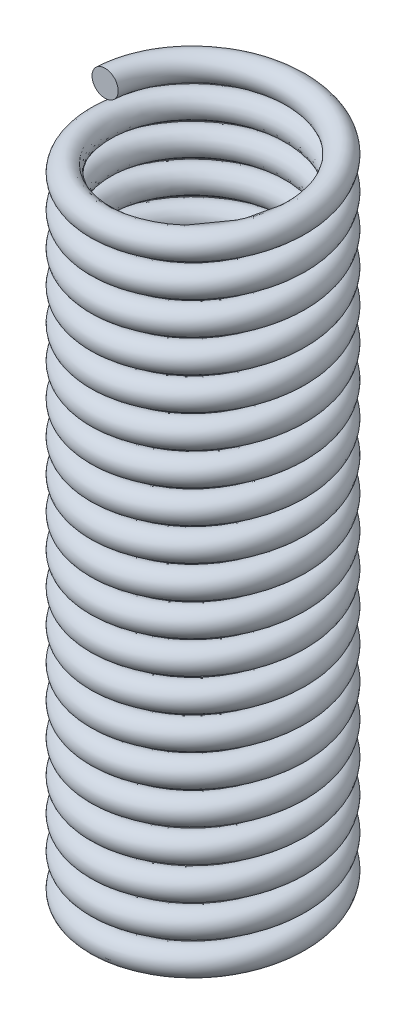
ISO-10303-21;
HEADER;
FILE_DESCRIPTION(('STEP AP214'),'2;1');
FILE_NAME('part.step','',(''),(''),'','','');
FILE_SCHEMA(('AUTOMOTIVE_DESIGN { 1 0 10303 214 1 1 1 1 }'));
ENDSEC;
DATA;
#1=APPLICATION_CONTEXT('core data for automotive mechanical design processes');
#2=APPLICATION_PROTOCOL_DEFINITION('international standard','automotive_design',2000,#1);
#3=PRODUCT_CONTEXT('',#1,'mechanical');
#4=PRODUCT('Part','Part','',(#3));
#5=PRODUCT_RELATED_PRODUCT_CATEGORY('part','',(#4));
#6=PRODUCT_DEFINITION_FORMATION('','',#4);
#7=PRODUCT_DEFINITION_CONTEXT('part definition',#1,'design');
#8=PRODUCT_DEFINITION('design','',#6,#7);
#9=PRODUCT_DEFINITION_SHAPE('','',#8);
#10=(LENGTH_UNIT() NAMED_UNIT(*) SI_UNIT(.MILLI.,.METRE.));
#11=(NAMED_UNIT(*) PLANE_ANGLE_UNIT() SI_UNIT($,.RADIAN.));
#12=(NAMED_UNIT(*) SI_UNIT($,.STERADIAN.) SOLID_ANGLE_UNIT());
#13=UNCERTAINTY_MEASURE_WITH_UNIT(LENGTH_MEASURE(1.E-05),#10,'distance_accuracy_value','');
#14=(GEOMETRIC_REPRESENTATION_CONTEXT(3) GLOBAL_UNCERTAINTY_ASSIGNED_CONTEXT((#13)) GLOBAL_UNIT_ASSIGNED_CONTEXT((#10,
#11,#12)) REPRESENTATION_CONTEXT('',''));
#15=CARTESIAN_POINT('',(0.,0.,0.));
#16=DIRECTION('',(0.,0.,1.));
#17=DIRECTION('',(1.,0.,0.));
#18=AXIS2_PLACEMENT_3D('',#15,#16,#17);
#19=CARTESIAN_POINT('',(-3.,0.,0.));
#20=DIRECTION('',(0.,0.,1.));
#21=DIRECTION('',(1.,0.,0.));
#22=AXIS2_PLACEMENT_3D('',#19,#20,#21);
#23=PLANE('',#22);
#24=CARTESIAN_POINT('',(-3.,0.,0.));
#25=DIRECTION('',(0.,0.,1.));
#26=DIRECTION('',(1.,0.,0.));
#27=AXIS2_PLACEMENT_3D('',#24,#25,#26);
#28=CIRCLE('',#27,0.4);
#29=CARTESIAN_POINT('',(-2.6,0.,0.));
#30=VERTEX_POINT('',#29);
#31=EDGE_CURVE('E23',#30,#30,#28,.T.);
#32=ORIENTED_EDGE('',*,*,#31,.F.);
#33=EDGE_LOOP('',(#32));
#34=FACE_BOUND('',#33,.T.);
#35=ADVANCED_FACE('F16',(#34),#23,.F.);
#36=CARTESIAN_POINT('',(-3.,20.,8.37955521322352E-13));
#37=DIRECTION('',(2.7931850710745E-13,0.,1.));
#38=DIRECTION('',(1.,0.,-2.7931850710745E-13));
#39=AXIS2_PLACEMENT_3D('',#36,#37,#38);
#40=PLANE('',#39);
#41=CARTESIAN_POINT('',(-3.,20.,8.37955521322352E-13));
#42=DIRECTION('',(2.7931850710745E-13,0.,1.));
#43=DIRECTION('',(1.,0.,-2.7931850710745E-13));
#44=AXIS2_PLACEMENT_3D('',#41,#42,#43);
#45=CIRCLE('',#44,0.4);
#46=CARTESIAN_POINT('',(-2.6,20.,7.26228118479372E-13));
#47=VERTEX_POINT('',#46);
#48=EDGE_CURVE('E11',#47,#47,#45,.T.);
#49=ORIENTED_EDGE('',*,*,#48,.T.);
#50=EDGE_LOOP('',(#49));
#51=FACE_BOUND('',#50,.T.);
#52=ADVANCED_FACE('F30',(#51),#40,.T.);
#53=CARTESIAN_POINT('',(-2.6,0.,0.));
#54=CARTESIAN_POINT('',(-2.6,0.0833333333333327,1.50111069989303));
#55=CARTESIAN_POINT('',(-1.3,0.166666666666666,2.25166604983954));
#56=CARTESIAN_POINT('',(0.,0.249999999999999,3.00222139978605));
#57=CARTESIAN_POINT('',(1.3,0.333333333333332,2.25166604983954));
#58=CARTESIAN_POINT('',(2.6,0.416666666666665,1.50111069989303));
#59=CARTESIAN_POINT('',(2.6,0.5,0.));
#60=CARTESIAN_POINT('',(2.6,0.583333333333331,-1.50111069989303));
#61=CARTESIAN_POINT('',(1.3,0.666666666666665,-2.25166604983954));
#62=CARTESIAN_POINT('',(0.,0.749999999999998,-3.00222139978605));
#63=CARTESIAN_POINT('',(-1.3,0.833333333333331,-2.25166604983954));
#64=CARTESIAN_POINT('',(-2.6,0.916666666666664,-1.50111069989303));
#65=CARTESIAN_POINT('',(-2.6,1.,0.));
#66=CARTESIAN_POINT('',(-2.6,1.08333333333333,1.50111069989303));
#67=CARTESIAN_POINT('',(-1.3,1.16666666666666,2.25166604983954));
#68=CARTESIAN_POINT('',(0.,1.25,3.00222139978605));
#69=CARTESIAN_POINT('',(1.3,1.33333333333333,2.25166604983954));
#70=CARTESIAN_POINT('',(2.6,1.41666666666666,1.50111069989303));
#71=CARTESIAN_POINT('',(2.6,1.5,0.));
#72=CARTESIAN_POINT('',(2.6,1.58333333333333,-1.50111069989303));
#73=CARTESIAN_POINT('',(1.3,1.66666666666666,-2.25166604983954));
#74=CARTESIAN_POINT('',(0.,1.75,-3.00222139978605));
#75=CARTESIAN_POINT('',(-1.3,1.83333333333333,-2.25166604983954));
#76=CARTESIAN_POINT('',(-2.6,1.91666666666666,-1.50111069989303));
#77=CARTESIAN_POINT('',(-2.6,2.,0.));
#78=CARTESIAN_POINT('',(-2.6,2.08333333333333,1.50111069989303));
#79=CARTESIAN_POINT('',(-1.3,2.16666666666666,2.25166604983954));
#80=CARTESIAN_POINT('',(0.,2.24999999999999,3.00222139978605));
#81=CARTESIAN_POINT('',(1.3,2.33333333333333,2.25166604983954));
#82=CARTESIAN_POINT('',(2.6,2.41666666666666,1.50111069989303));
#83=CARTESIAN_POINT('',(2.6,2.5,0.));
#84=CARTESIAN_POINT('',(2.6,2.58333333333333,-1.50111069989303));
#85=CARTESIAN_POINT('',(1.3,2.66666666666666,-2.25166604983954));
#86=CARTESIAN_POINT('',(0.,2.74999999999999,-3.00222139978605));
#87=CARTESIAN_POINT('',(-1.3,2.83333333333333,-2.25166604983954));
#88=CARTESIAN_POINT('',(-2.6,2.91666666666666,-1.50111069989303));
#89=CARTESIAN_POINT('',(-2.6,3.,0.));
#90=CARTESIAN_POINT('',(-2.6,3.08333333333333,1.50111069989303));
#91=CARTESIAN_POINT('',(-1.3,3.16666666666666,2.25166604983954));
#92=CARTESIAN_POINT('',(0.,3.24999999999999,3.00222139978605));
#93=CARTESIAN_POINT('',(1.3,3.33333333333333,2.25166604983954));
#94=CARTESIAN_POINT('',(2.6,3.41666666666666,1.50111069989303));
#95=CARTESIAN_POINT('',(2.6,3.5,0.));
#96=CARTESIAN_POINT('',(2.6,3.58333333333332,-1.50111069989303));
#97=CARTESIAN_POINT('',(1.3,3.66666666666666,-2.25166604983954));
#98=CARTESIAN_POINT('',(0.,3.74999999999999,-3.00222139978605));
#99=CARTESIAN_POINT('',(-1.3,3.83333333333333,-2.25166604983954));
#100=CARTESIAN_POINT('',(-2.6,3.91666666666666,-1.50111069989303));
#101=CARTESIAN_POINT('',(-2.6,4.,0.));
#102=CARTESIAN_POINT('',(-2.6,4.08333333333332,1.50111069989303));
#103=CARTESIAN_POINT('',(-1.3,4.16666666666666,2.25166604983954));
#104=CARTESIAN_POINT('',(0.,4.24999999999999,3.00222139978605));
#105=CARTESIAN_POINT('',(1.3,4.33333333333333,2.25166604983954));
#106=CARTESIAN_POINT('',(2.6,4.41666666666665,1.50111069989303));
#107=CARTESIAN_POINT('',(2.6,4.5,0.));
#108=CARTESIAN_POINT('',(2.6,4.58333333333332,-1.50111069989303));
#109=CARTESIAN_POINT('',(1.3,4.66666666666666,-2.25166604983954));
#110=CARTESIAN_POINT('',(0.,4.74999999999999,-3.00222139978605));
#111=CARTESIAN_POINT('',(-1.3,4.83333333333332,-2.25166604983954));
#112=CARTESIAN_POINT('',(-2.6,4.91666666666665,-1.50111069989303));
#113=CARTESIAN_POINT('',(-2.6,5.,0.));
#114=CARTESIAN_POINT('',(-2.6,5.08333333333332,1.50111069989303));
#115=CARTESIAN_POINT('',(-1.3,5.16666666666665,2.25166604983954));
#116=CARTESIAN_POINT('',(0.,5.24999999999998,3.00222139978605));
#117=CARTESIAN_POINT('',(1.3,5.33333333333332,2.25166604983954));
#118=CARTESIAN_POINT('',(2.6,5.41666666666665,1.50111069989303));
#119=CARTESIAN_POINT('',(2.6,5.5,0.));
#120=CARTESIAN_POINT('',(2.6,5.58333333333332,-1.50111069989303));
#121=CARTESIAN_POINT('',(1.3,5.66666666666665,-2.25166604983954));
#122=CARTESIAN_POINT('',(0.,5.74999999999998,-3.00222139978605));
#123=CARTESIAN_POINT('',(-1.3,5.83333333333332,-2.25166604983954));
#124=CARTESIAN_POINT('',(-2.6,5.91666666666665,-1.50111069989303));
#125=CARTESIAN_POINT('',(-2.6,6.,0.));
#126=CARTESIAN_POINT('',(-2.6,6.08333333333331,1.50111069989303));
#127=CARTESIAN_POINT('',(-1.3,6.16666666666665,2.25166604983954));
#128=CARTESIAN_POINT('',(0.,6.24999999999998,3.00222139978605));
#129=CARTESIAN_POINT('',(1.3,6.33333333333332,2.25166604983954));
#130=CARTESIAN_POINT('',(2.6,6.41666666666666,1.50111069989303));
#131=CARTESIAN_POINT('',(2.6,6.5,0.));
#132=CARTESIAN_POINT('',(2.6,6.58333333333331,-1.50111069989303));
#133=CARTESIAN_POINT('',(1.3,6.66666666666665,-2.25166604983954));
#134=CARTESIAN_POINT('',(0.,6.74999999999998,-3.00222139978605));
#135=CARTESIAN_POINT('',(-1.3,6.83333333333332,-2.25166604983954));
#136=CARTESIAN_POINT('',(-2.6,6.91666666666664,-1.50111069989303));
#137=CARTESIAN_POINT('',(-2.6,7.,0.));
#138=CARTESIAN_POINT('',(-2.6,7.08333333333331,1.50111069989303));
#139=CARTESIAN_POINT('',(-1.3,7.16666666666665,2.25166604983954));
#140=CARTESIAN_POINT('',(0.,7.24999999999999,3.00222139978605));
#141=CARTESIAN_POINT('',(1.3,7.33333333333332,2.25166604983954));
#142=CARTESIAN_POINT('',(2.6,7.41666666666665,1.50111069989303));
#143=CARTESIAN_POINT('',(2.6,7.5,0.));
#144=CARTESIAN_POINT('',(2.6,7.58333333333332,-1.50111069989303));
#145=CARTESIAN_POINT('',(1.3,7.66666666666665,-2.25166604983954));
#146=CARTESIAN_POINT('',(0.,7.74999999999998,-3.00222139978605));
#147=CARTESIAN_POINT('',(-1.3,7.83333333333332,-2.25166604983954));
#148=CARTESIAN_POINT('',(-2.6,7.91666666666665,-1.50111069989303));
#149=CARTESIAN_POINT('',(-2.6,8.,0.));
#150=CARTESIAN_POINT('',(-2.6,8.08333333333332,1.50111069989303));
#151=CARTESIAN_POINT('',(-1.3,8.16666666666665,2.25166604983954));
#152=CARTESIAN_POINT('',(0.,8.24999999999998,3.00222139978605));
#153=CARTESIAN_POINT('',(1.3,8.33333333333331,2.25166604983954));
#154=CARTESIAN_POINT('',(2.6,8.41666666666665,1.50111069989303));
#155=CARTESIAN_POINT('',(2.6,8.5,0.));
#156=CARTESIAN_POINT('',(2.6,8.58333333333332,-1.50111069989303));
#157=CARTESIAN_POINT('',(1.3,8.66666666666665,-2.25166604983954));
#158=CARTESIAN_POINT('',(0.,8.74999999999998,-3.00222139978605));
#159=CARTESIAN_POINT('',(-1.3,8.83333333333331,-2.25166604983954));
#160=CARTESIAN_POINT('',(-2.6,8.91666666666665,-1.50111069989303));
#161=CARTESIAN_POINT('',(-2.6,9.,0.));
#162=CARTESIAN_POINT('',(-2.6,9.08333333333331,1.50111069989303));
#163=CARTESIAN_POINT('',(-1.3,9.16666666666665,2.25166604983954));
#164=CARTESIAN_POINT('',(0.,9.24999999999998,3.00222139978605));
#165=CARTESIAN_POINT('',(1.3,9.33333333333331,2.25166604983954));
#166=CARTESIAN_POINT('',(2.6,9.41666666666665,1.50111069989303));
#167=CARTESIAN_POINT('',(2.6,9.5,0.));
#168=CARTESIAN_POINT('',(2.6,9.58333333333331,-1.50111069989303));
#169=CARTESIAN_POINT('',(1.3,9.66666666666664,-2.25166604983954));
#170=CARTESIAN_POINT('',(0.,9.74999999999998,-3.00222139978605));
#171=CARTESIAN_POINT('',(-1.3,9.83333333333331,-2.25166604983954));
#172=CARTESIAN_POINT('',(-2.6,9.91666666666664,-1.50111069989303));
#173=CARTESIAN_POINT('',(-2.6,10.,0.));
#174=CARTESIAN_POINT('',(-2.6,10.0833333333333,1.50111069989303));
#175=CARTESIAN_POINT('',(-1.3,10.1666666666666,2.25166604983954));
#176=CARTESIAN_POINT('',(0.,10.25,3.00222139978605));
#177=CARTESIAN_POINT('',(1.3,10.3333333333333,2.25166604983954));
#178=CARTESIAN_POINT('',(2.6,10.4166666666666,1.50111069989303));
#179=CARTESIAN_POINT('',(2.6,10.5,0.));
#180=CARTESIAN_POINT('',(2.6,10.5833333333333,-1.50111069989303));
#181=CARTESIAN_POINT('',(1.3,10.6666666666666,-2.25166604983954));
#182=CARTESIAN_POINT('',(0.,10.75,-3.00222139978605));
#183=CARTESIAN_POINT('',(-1.3,10.8333333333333,-2.25166604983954));
#184=CARTESIAN_POINT('',(-2.6,10.9166666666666,-1.50111069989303));
#185=CARTESIAN_POINT('',(-2.6,11.,0.));
#186=CARTESIAN_POINT('',(-2.6,11.0833333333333,1.50111069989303));
#187=CARTESIAN_POINT('',(-1.3,11.1666666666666,2.25166604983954));
#188=CARTESIAN_POINT('',(0.,11.25,3.00222139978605));
#189=CARTESIAN_POINT('',(1.3,11.3333333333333,2.25166604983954));
#190=CARTESIAN_POINT('',(2.6,11.4166666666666,1.50111069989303));
#191=CARTESIAN_POINT('',(2.6,11.5,0.));
#192=CARTESIAN_POINT('',(2.6,11.5833333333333,-1.50111069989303));
#193=CARTESIAN_POINT('',(1.3,11.6666666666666,-2.25166604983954));
#194=CARTESIAN_POINT('',(0.,11.75,-3.00222139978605));
#195=CARTESIAN_POINT('',(-1.3,11.8333333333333,-2.25166604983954));
#196=CARTESIAN_POINT('',(-2.6,11.9166666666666,-1.50111069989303));
#197=CARTESIAN_POINT('',(-2.6,12.,0.));
#198=CARTESIAN_POINT('',(-2.6,12.0833333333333,1.50111069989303));
#199=CARTESIAN_POINT('',(-1.3,12.1666666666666,2.25166604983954));
#200=CARTESIAN_POINT('',(0.,12.25,3.00222139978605));
#201=CARTESIAN_POINT('',(1.3,12.3333333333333,2.25166604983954));
#202=CARTESIAN_POINT('',(2.6,12.4166666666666,1.50111069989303));
#203=CARTESIAN_POINT('',(2.6,12.5,0.));
#204=CARTESIAN_POINT('',(2.6,12.5833333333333,-1.50111069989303));
#205=CARTESIAN_POINT('',(1.3,12.6666666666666,-2.25166604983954));
#206=CARTESIAN_POINT('',(0.,12.75,-3.00222139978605));
#207=CARTESIAN_POINT('',(-1.3,12.8333333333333,-2.25166604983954));
#208=CARTESIAN_POINT('',(-2.6,12.9166666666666,-1.50111069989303));
#209=CARTESIAN_POINT('',(-2.6,13.,0.));
#210=CARTESIAN_POINT('',(-2.6,13.0833333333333,1.50111069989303));
#211=CARTESIAN_POINT('',(-1.3,13.1666666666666,2.25166604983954));
#212=CARTESIAN_POINT('',(0.,13.25,3.00222139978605));
#213=CARTESIAN_POINT('',(1.3,13.3333333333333,2.25166604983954));
#214=CARTESIAN_POINT('',(2.6,13.4166666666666,1.50111069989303));
#215=CARTESIAN_POINT('',(2.6,13.5,0.));
#216=CARTESIAN_POINT('',(2.6,13.5833333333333,-1.50111069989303));
#217=CARTESIAN_POINT('',(1.3,13.6666666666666,-2.25166604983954));
#218=CARTESIAN_POINT('',(0.,13.75,-3.00222139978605));
#219=CARTESIAN_POINT('',(-1.3,13.8333333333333,-2.25166604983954));
#220=CARTESIAN_POINT('',(-2.6,13.9166666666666,-1.50111069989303));
#221=CARTESIAN_POINT('',(-2.6,14.,0.));
#222=CARTESIAN_POINT('',(-2.6,14.0833333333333,1.50111069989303));
#223=CARTESIAN_POINT('',(-1.3,14.1666666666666,2.25166604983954));
#224=CARTESIAN_POINT('',(0.,14.25,3.00222139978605));
#225=CARTESIAN_POINT('',(1.3,14.3333333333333,2.25166604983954));
#226=CARTESIAN_POINT('',(2.6,14.4166666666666,1.50111069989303));
#227=CARTESIAN_POINT('',(2.6,14.5,0.));
#228=CARTESIAN_POINT('',(2.6,14.5833333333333,-1.50111069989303));
#229=CARTESIAN_POINT('',(1.3,14.6666666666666,-2.25166604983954));
#230=CARTESIAN_POINT('',(0.,14.75,-3.00222139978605));
#231=CARTESIAN_POINT('',(-1.3,14.8333333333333,-2.25166604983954));
#232=CARTESIAN_POINT('',(-2.6,14.9166666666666,-1.50111069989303));
#233=CARTESIAN_POINT('',(-2.6,15.,0.));
#234=CARTESIAN_POINT('',(-2.6,15.0833333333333,1.50111069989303));
#235=CARTESIAN_POINT('',(-1.3,15.1666666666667,2.25166604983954));
#236=CARTESIAN_POINT('',(0.,15.25,3.00222139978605));
#237=CARTESIAN_POINT('',(1.3,15.3333333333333,2.25166604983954));
#238=CARTESIAN_POINT('',(2.6,15.4166666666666,1.50111069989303));
#239=CARTESIAN_POINT('',(2.6,15.5,0.));
#240=CARTESIAN_POINT('',(2.6,15.5833333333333,-1.50111069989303));
#241=CARTESIAN_POINT('',(1.3,15.6666666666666,-2.25166604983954));
#242=CARTESIAN_POINT('',(0.,15.75,-3.00222139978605));
#243=CARTESIAN_POINT('',(-1.3,15.8333333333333,-2.25166604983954));
#244=CARTESIAN_POINT('',(-2.6,15.9166666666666,-1.50111069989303));
#245=CARTESIAN_POINT('',(-2.6,16.,0.));
#246=CARTESIAN_POINT('',(-2.6,16.0833333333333,1.50111069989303));
#247=CARTESIAN_POINT('',(-1.3,16.1666666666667,2.25166604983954));
#248=CARTESIAN_POINT('',(0.,16.25,3.00222139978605));
#249=CARTESIAN_POINT('',(1.3,16.3333333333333,2.25166604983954));
#250=CARTESIAN_POINT('',(2.6,16.4166666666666,1.50111069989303));
#251=CARTESIAN_POINT('',(2.6,16.5,0.));
#252=CARTESIAN_POINT('',(2.6,16.5833333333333,-1.50111069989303));
#253=CARTESIAN_POINT('',(1.3,16.6666666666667,-2.25166604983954));
#254=CARTESIAN_POINT('',(0.,16.75,-3.00222139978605));
#255=CARTESIAN_POINT('',(-1.3,16.8333333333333,-2.25166604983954));
#256=CARTESIAN_POINT('',(-2.6,16.9166666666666,-1.50111069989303));
#257=CARTESIAN_POINT('',(-2.6,17.,0.));
#258=CARTESIAN_POINT('',(-2.6,17.0833333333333,1.50111069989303));
#259=CARTESIAN_POINT('',(-1.3,17.1666666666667,2.25166604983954));
#260=CARTESIAN_POINT('',(0.,17.2499999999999,3.00222139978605));
#261=CARTESIAN_POINT('',(1.3,17.3333333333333,2.25166604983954));
#262=CARTESIAN_POINT('',(2.6,17.4166666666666,1.50111069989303));
#263=CARTESIAN_POINT('',(2.6,17.5,0.));
#264=CARTESIAN_POINT('',(2.6,17.5833333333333,-1.50111069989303));
#265=CARTESIAN_POINT('',(1.3,17.6666666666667,-2.25166604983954));
#266=CARTESIAN_POINT('',(0.,17.75,-3.00222139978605));
#267=CARTESIAN_POINT('',(-1.3,17.8333333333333,-2.25166604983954));
#268=CARTESIAN_POINT('',(-2.6,17.9166666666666,-1.50111069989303));
#269=CARTESIAN_POINT('',(-2.6,18.,0.));
#270=CARTESIAN_POINT('',(-2.6,18.0833333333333,1.50111069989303));
#271=CARTESIAN_POINT('',(-1.3,18.1666666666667,2.25166604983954));
#272=CARTESIAN_POINT('',(0.,18.2499999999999,3.00222139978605));
#273=CARTESIAN_POINT('',(1.3,18.3333333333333,2.25166604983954));
#274=CARTESIAN_POINT('',(2.6,18.4166666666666,1.50111069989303));
#275=CARTESIAN_POINT('',(2.6,18.5,0.));
#276=CARTESIAN_POINT('',(2.6,18.5833333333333,-1.50111069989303));
#277=CARTESIAN_POINT('',(1.3,18.6666666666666,-2.25166604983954));
#278=CARTESIAN_POINT('',(0.,18.75,-3.00222139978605));
#279=CARTESIAN_POINT('',(-1.3,18.8333333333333,-2.25166604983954));
#280=CARTESIAN_POINT('',(-2.6,18.9166666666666,-1.50111069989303));
#281=CARTESIAN_POINT('',(-2.6,19.,0.));
#282=CARTESIAN_POINT('',(-2.6,19.0833333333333,1.50111069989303));
#283=CARTESIAN_POINT('',(-1.3,19.1666666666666,2.25166604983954));
#284=CARTESIAN_POINT('',(0.,19.2499999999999,3.00222139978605));
#285=CARTESIAN_POINT('',(1.3,19.3333333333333,2.25166604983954));
#286=CARTESIAN_POINT('',(2.6,19.4166666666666,1.50111069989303));
#287=CARTESIAN_POINT('',(2.6,19.5,0.));
#288=CARTESIAN_POINT('',(2.6,19.5833333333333,-1.50111069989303));
#289=CARTESIAN_POINT('',(1.3,19.6666666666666,-2.25166604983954));
#290=CARTESIAN_POINT('',(0.,19.75,-3.00222139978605));
#291=CARTESIAN_POINT('',(-1.3,19.8333333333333,-2.25166604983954));
#292=CARTESIAN_POINT('',(-2.6,19.9166666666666,-1.50111069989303));
#293=CARTESIAN_POINT('',(-2.6,20.,0.));
#294=CARTESIAN_POINT('',(-2.6,20.0833333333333,1.50111069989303));
#295=CARTESIAN_POINT('',(-1.3,20.1666666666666,2.25166604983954));
#296=CARTESIAN_POINT('',(0.,20.25,3.00222139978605));
#297=CARTESIAN_POINT('',(1.3,20.3333333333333,2.25166604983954));
#298=CARTESIAN_POINT('',(2.6,20.4166666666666,1.50111069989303));
#299=CARTESIAN_POINT('',(2.6,20.5,0.));
#300=CARTESIAN_POINT('',(2.6,20.5833333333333,-1.50111069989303));
#301=CARTESIAN_POINT('',(1.3,20.6666666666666,-2.25166604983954));
#302=CARTESIAN_POINT('',(0.,20.7499999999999,-3.00222139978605));
#303=CARTESIAN_POINT('',(-1.3,20.8333333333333,-2.25166604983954));
#304=CARTESIAN_POINT('',(-2.6,20.9166666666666,-1.50111069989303));
#305=CARTESIAN_POINT('',(-2.6,21.,0.));
#306=CARTESIAN_POINT('',(-2.6,0.8,0.));
#307=CARTESIAN_POINT('',(-2.6,0.883333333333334,1.50111069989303));
#308=CARTESIAN_POINT('',(-1.3,0.966666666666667,2.25166604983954));
#309=CARTESIAN_POINT('',(0.,1.05,3.00222139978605));
#310=CARTESIAN_POINT('',(1.3,1.13333333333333,2.25166604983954));
#311=CARTESIAN_POINT('',(2.6,1.21666666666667,1.50111069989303));
#312=CARTESIAN_POINT('',(2.6,1.3,0.));
#313=CARTESIAN_POINT('',(2.6,1.38333333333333,-1.50111069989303));
#314=CARTESIAN_POINT('',(1.3,1.46666666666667,-2.25166604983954));
#315=CARTESIAN_POINT('',(0.,1.55,-3.00222139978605));
#316=CARTESIAN_POINT('',(-1.3,1.63333333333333,-2.25166604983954));
#317=CARTESIAN_POINT('',(-2.6,1.71666666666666,-1.50111069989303));
#318=CARTESIAN_POINT('',(-2.6,1.8,0.));
#319=CARTESIAN_POINT('',(-2.6,1.88333333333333,1.50111069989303));
#320=CARTESIAN_POINT('',(-1.3,1.96666666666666,2.25166604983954));
#321=CARTESIAN_POINT('',(0.,2.05,3.00222139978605));
#322=CARTESIAN_POINT('',(1.3,2.13333333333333,2.25166604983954));
#323=CARTESIAN_POINT('',(2.6,2.21666666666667,1.50111069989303));
#324=CARTESIAN_POINT('',(2.6,2.3,0.));
#325=CARTESIAN_POINT('',(2.6,2.38333333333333,-1.50111069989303));
#326=CARTESIAN_POINT('',(1.3,2.46666666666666,-2.25166604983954));
#327=CARTESIAN_POINT('',(0.,2.55,-3.00222139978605));
#328=CARTESIAN_POINT('',(-1.3,2.63333333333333,-2.25166604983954));
#329=CARTESIAN_POINT('',(-2.6,2.71666666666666,-1.50111069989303));
#330=CARTESIAN_POINT('',(-2.6,2.79999999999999,0.));
#331=CARTESIAN_POINT('',(-2.6,2.88333333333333,1.50111069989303));
#332=CARTESIAN_POINT('',(-1.3,2.96666666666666,2.25166604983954));
#333=CARTESIAN_POINT('',(0.,3.04999999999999,3.00222139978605));
#334=CARTESIAN_POINT('',(1.3,3.13333333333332,2.25166604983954));
#335=CARTESIAN_POINT('',(2.6,3.21666666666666,1.50111069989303));
#336=CARTESIAN_POINT('',(2.6,3.3,0.));
#337=CARTESIAN_POINT('',(2.6,3.38333333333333,-1.50111069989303));
#338=CARTESIAN_POINT('',(1.3,3.46666666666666,-2.25166604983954));
#339=CARTESIAN_POINT('',(0.,3.54999999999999,-3.00222139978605));
#340=CARTESIAN_POINT('',(-1.3,3.63333333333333,-2.25166604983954));
#341=CARTESIAN_POINT('',(-2.6,3.71666666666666,-1.50111069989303));
#342=CARTESIAN_POINT('',(-2.6,3.79999999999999,0.));
#343=CARTESIAN_POINT('',(-2.6,3.88333333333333,1.50111069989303));
#344=CARTESIAN_POINT('',(-1.3,3.96666666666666,2.25166604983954));
#345=CARTESIAN_POINT('',(0.,4.04999999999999,3.00222139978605));
#346=CARTESIAN_POINT('',(1.3,4.13333333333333,2.25166604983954));
#347=CARTESIAN_POINT('',(2.6,4.21666666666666,1.50111069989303));
#348=CARTESIAN_POINT('',(2.6,4.29999999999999,0.));
#349=CARTESIAN_POINT('',(2.6,4.38333333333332,-1.50111069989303));
#350=CARTESIAN_POINT('',(1.3,4.46666666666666,-2.25166604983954));
#351=CARTESIAN_POINT('',(0.,4.54999999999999,-3.00222139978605));
#352=CARTESIAN_POINT('',(-1.3,4.63333333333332,-2.25166604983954));
#353=CARTESIAN_POINT('',(-2.6,4.71666666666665,-1.50111069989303));
#354=CARTESIAN_POINT('',(-2.6,4.8,0.));
#355=CARTESIAN_POINT('',(-2.6,4.88333333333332,1.50111069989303));
#356=CARTESIAN_POINT('',(-1.3,4.96666666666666,2.25166604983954));
#357=CARTESIAN_POINT('',(0.,5.04999999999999,3.00222139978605));
#358=CARTESIAN_POINT('',(1.3,5.13333333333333,2.25166604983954));
#359=CARTESIAN_POINT('',(2.6,5.21666666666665,1.50111069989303));
#360=CARTESIAN_POINT('',(2.6,5.29999999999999,0.));
#361=CARTESIAN_POINT('',(2.6,5.38333333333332,-1.50111069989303));
#362=CARTESIAN_POINT('',(1.3,5.46666666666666,-2.25166604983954));
#363=CARTESIAN_POINT('',(0.,5.54999999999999,-3.00222139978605));
#364=CARTESIAN_POINT('',(-1.3,5.63333333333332,-2.25166604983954));
#365=CARTESIAN_POINT('',(-2.6,5.71666666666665,-1.50111069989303));
#366=CARTESIAN_POINT('',(-2.6,5.79999999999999,0.));
#367=CARTESIAN_POINT('',(-2.6,5.88333333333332,1.50111069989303));
#368=CARTESIAN_POINT('',(-1.3,5.96666666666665,2.25166604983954));
#369=CARTESIAN_POINT('',(0.,6.04999999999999,3.00222139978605));
#370=CARTESIAN_POINT('',(1.3,6.13333333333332,2.25166604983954));
#371=CARTESIAN_POINT('',(2.6,6.21666666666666,1.50111069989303));
#372=CARTESIAN_POINT('',(2.6,6.3,0.));
#373=CARTESIAN_POINT('',(2.6,6.38333333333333,-1.50111069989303));
#374=CARTESIAN_POINT('',(1.3,6.46666666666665,-2.25166604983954));
#375=CARTESIAN_POINT('',(0.,6.54999999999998,-3.00222139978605));
#376=CARTESIAN_POINT('',(-1.3,6.63333333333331,-2.25166604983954));
#377=CARTESIAN_POINT('',(-2.6,6.71666666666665,-1.50111069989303));
#378=CARTESIAN_POINT('',(-2.6,6.79999999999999,0.));
#379=CARTESIAN_POINT('',(-2.6,6.88333333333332,1.50111069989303));
#380=CARTESIAN_POINT('',(-1.3,6.96666666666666,2.25166604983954));
#381=CARTESIAN_POINT('',(0.,7.04999999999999,3.00222139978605));
#382=CARTESIAN_POINT('',(1.3,7.13333333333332,2.25166604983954));
#383=CARTESIAN_POINT('',(2.6,7.21666666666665,1.50111069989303));
#384=CARTESIAN_POINT('',(2.6,7.29999999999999,0.));
#385=CARTESIAN_POINT('',(2.6,7.38333333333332,-1.50111069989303));
#386=CARTESIAN_POINT('',(1.3,7.46666666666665,-2.25166604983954));
#387=CARTESIAN_POINT('',(0.,7.54999999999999,-3.00222139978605));
#388=CARTESIAN_POINT('',(-1.3,7.63333333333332,-2.25166604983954));
#389=CARTESIAN_POINT('',(-2.6,7.71666666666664,-1.50111069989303));
#390=CARTESIAN_POINT('',(-2.6,7.8,0.));
#391=CARTESIAN_POINT('',(-2.6,7.88333333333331,1.50111069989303));
#392=CARTESIAN_POINT('',(-1.3,7.96666666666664,2.25166604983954));
#393=CARTESIAN_POINT('',(0.,8.04999999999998,3.00222139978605));
#394=CARTESIAN_POINT('',(1.3,8.13333333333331,2.25166604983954));
#395=CARTESIAN_POINT('',(2.6,8.21666666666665,1.50111069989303));
#396=CARTESIAN_POINT('',(2.6,8.29999999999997,0.));
#397=CARTESIAN_POINT('',(2.6,8.38333333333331,-1.50111069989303));
#398=CARTESIAN_POINT('',(1.3,8.46666666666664,-2.25166604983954));
#399=CARTESIAN_POINT('',(0.,8.54999999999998,-3.00222139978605));
#400=CARTESIAN_POINT('',(-1.3,8.63333333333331,-2.25166604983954));
#401=CARTESIAN_POINT('',(-2.6,8.71666666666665,-1.50111069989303));
#402=CARTESIAN_POINT('',(-2.6,8.79999999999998,0.));
#403=CARTESIAN_POINT('',(-2.6,8.88333333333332,1.50111069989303));
#404=CARTESIAN_POINT('',(-1.3,8.96666666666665,2.25166604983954));
#405=CARTESIAN_POINT('',(0.,9.04999999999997,3.00222139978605));
#406=CARTESIAN_POINT('',(1.3,9.13333333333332,2.25166604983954));
#407=CARTESIAN_POINT('',(2.6,9.21666666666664,1.50111069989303));
#408=CARTESIAN_POINT('',(2.6,9.29999999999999,0.));
#409=CARTESIAN_POINT('',(2.6,9.38333333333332,-1.50111069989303));
#410=CARTESIAN_POINT('',(1.3,9.46666666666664,-2.25166604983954));
#411=CARTESIAN_POINT('',(0.,9.54999999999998,-3.00222139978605));
#412=CARTESIAN_POINT('',(-1.3,9.63333333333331,-2.25166604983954));
#413=CARTESIAN_POINT('',(-2.6,9.71666666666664,-1.50111069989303));
#414=CARTESIAN_POINT('',(-2.6,9.79999999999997,0.));
#415=CARTESIAN_POINT('',(-2.6,9.88333333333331,1.50111069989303));
#416=CARTESIAN_POINT('',(-1.3,9.96666666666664,2.25166604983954));
#417=CARTESIAN_POINT('',(0.,10.05,3.00222139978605));
#418=CARTESIAN_POINT('',(1.3,10.1333333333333,2.25166604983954));
#419=CARTESIAN_POINT('',(2.6,10.2166666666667,1.50111069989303));
#420=CARTESIAN_POINT('',(2.6,10.3,0.));
#421=CARTESIAN_POINT('',(2.6,10.3833333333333,-1.50111069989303));
#422=CARTESIAN_POINT('',(1.3,10.4666666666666,-2.25166604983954));
#423=CARTESIAN_POINT('',(0.,10.55,-3.00222139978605));
#424=CARTESIAN_POINT('',(-1.3,10.6333333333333,-2.25166604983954));
#425=CARTESIAN_POINT('',(-2.6,10.7166666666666,-1.50111069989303));
#426=CARTESIAN_POINT('',(-2.6,10.8,0.));
#427=CARTESIAN_POINT('',(-2.6,10.8833333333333,1.50111069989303));
#428=CARTESIAN_POINT('',(-1.3,10.9666666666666,2.25166604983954));
#429=CARTESIAN_POINT('',(0.,11.05,3.00222139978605));
#430=CARTESIAN_POINT('',(1.3,11.1333333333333,2.25166604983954));
#431=CARTESIAN_POINT('',(2.6,11.2166666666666,1.50111069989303));
#432=CARTESIAN_POINT('',(2.6,11.3,0.));
#433=CARTESIAN_POINT('',(2.6,11.3833333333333,-1.50111069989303));
#434=CARTESIAN_POINT('',(1.3,11.4666666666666,-2.25166604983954));
#435=CARTESIAN_POINT('',(0.,11.55,-3.00222139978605));
#436=CARTESIAN_POINT('',(-1.3,11.6333333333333,-2.25166604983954));
#437=CARTESIAN_POINT('',(-2.6,11.7166666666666,-1.50111069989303));
#438=CARTESIAN_POINT('',(-2.6,11.8,0.));
#439=CARTESIAN_POINT('',(-2.6,11.8833333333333,1.50111069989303));
#440=CARTESIAN_POINT('',(-1.3,11.9666666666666,2.25166604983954));
#441=CARTESIAN_POINT('',(0.,12.05,3.00222139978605));
#442=CARTESIAN_POINT('',(1.3,12.1333333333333,2.25166604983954));
#443=CARTESIAN_POINT('',(2.6,12.2166666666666,1.50111069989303));
#444=CARTESIAN_POINT('',(2.6,12.3,0.));
#445=CARTESIAN_POINT('',(2.6,12.3833333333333,-1.50111069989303));
#446=CARTESIAN_POINT('',(1.3,12.4666666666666,-2.25166604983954));
#447=CARTESIAN_POINT('',(0.,12.55,-3.00222139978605));
#448=CARTESIAN_POINT('',(-1.3,12.6333333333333,-2.25166604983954));
#449=CARTESIAN_POINT('',(-2.6,12.7166666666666,-1.50111069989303));
#450=CARTESIAN_POINT('',(-2.6,12.8,0.));
#451=CARTESIAN_POINT('',(-2.6,12.8833333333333,1.50111069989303));
#452=CARTESIAN_POINT('',(-1.3,12.9666666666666,2.25166604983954));
#453=CARTESIAN_POINT('',(0.,13.05,3.00222139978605));
#454=CARTESIAN_POINT('',(1.3,13.1333333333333,2.25166604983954));
#455=CARTESIAN_POINT('',(2.6,13.2166666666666,1.50111069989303));
#456=CARTESIAN_POINT('',(2.6,13.3,0.));
#457=CARTESIAN_POINT('',(2.6,13.3833333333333,-1.50111069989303));
#458=CARTESIAN_POINT('',(1.3,13.4666666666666,-2.25166604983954));
#459=CARTESIAN_POINT('',(0.,13.55,-3.00222139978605));
#460=CARTESIAN_POINT('',(-1.3,13.6333333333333,-2.25166604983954));
#461=CARTESIAN_POINT('',(-2.6,13.7166666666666,-1.50111069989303));
#462=CARTESIAN_POINT('',(-2.6,13.8,0.));
#463=CARTESIAN_POINT('',(-2.6,13.8833333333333,1.50111069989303));
#464=CARTESIAN_POINT('',(-1.3,13.9666666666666,2.25166604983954));
#465=CARTESIAN_POINT('',(0.,14.05,3.00222139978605));
#466=CARTESIAN_POINT('',(1.3,14.1333333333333,2.25166604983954));
#467=CARTESIAN_POINT('',(2.6,14.2166666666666,1.50111069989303));
#468=CARTESIAN_POINT('',(2.6,14.3,0.));
#469=CARTESIAN_POINT('',(2.6,14.3833333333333,-1.50111069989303));
#470=CARTESIAN_POINT('',(1.3,14.4666666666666,-2.25166604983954));
#471=CARTESIAN_POINT('',(0.,14.55,-3.00222139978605));
#472=CARTESIAN_POINT('',(-1.3,14.6333333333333,-2.25166604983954));
#473=CARTESIAN_POINT('',(-2.6,14.7166666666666,-1.50111069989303));
#474=CARTESIAN_POINT('',(-2.6,14.8,0.));
#475=CARTESIAN_POINT('',(-2.6,14.8833333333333,1.50111069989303));
#476=CARTESIAN_POINT('',(-1.3,14.9666666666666,2.25166604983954));
#477=CARTESIAN_POINT('',(0.,15.05,3.00222139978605));
#478=CARTESIAN_POINT('',(1.3,15.1333333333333,2.25166604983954));
#479=CARTESIAN_POINT('',(2.6,15.2166666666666,1.50111069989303));
#480=CARTESIAN_POINT('',(2.6,15.3,0.));
#481=CARTESIAN_POINT('',(2.6,15.3833333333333,-1.50111069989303));
#482=CARTESIAN_POINT('',(1.3,15.4666666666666,-2.25166604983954));
#483=CARTESIAN_POINT('',(0.,15.55,-3.00222139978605));
#484=CARTESIAN_POINT('',(-1.3,15.6333333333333,-2.25166604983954));
#485=CARTESIAN_POINT('',(-2.6,15.7166666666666,-1.50111069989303));
#486=CARTESIAN_POINT('',(-2.6,15.8,0.));
#487=CARTESIAN_POINT('',(-2.6,15.8833333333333,1.50111069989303));
#488=CARTESIAN_POINT('',(-1.3,15.9666666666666,2.25166604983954));
#489=CARTESIAN_POINT('',(0.,16.05,3.00222139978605));
#490=CARTESIAN_POINT('',(1.3,16.1333333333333,2.25166604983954));
#491=CARTESIAN_POINT('',(2.6,16.2166666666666,1.50111069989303));
#492=CARTESIAN_POINT('',(2.6,16.3,0.));
#493=CARTESIAN_POINT('',(2.6,16.3833333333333,-1.50111069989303));
#494=CARTESIAN_POINT('',(1.3,16.4666666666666,-2.25166604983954));
#495=CARTESIAN_POINT('',(0.,16.55,-3.00222139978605));
#496=CARTESIAN_POINT('',(-1.3,16.6333333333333,-2.25166604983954));
#497=CARTESIAN_POINT('',(-2.6,16.7166666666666,-1.50111069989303));
#498=CARTESIAN_POINT('',(-2.6,16.8,0.));
#499=CARTESIAN_POINT('',(-2.6,16.8833333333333,1.50111069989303));
#500=CARTESIAN_POINT('',(-1.3,16.9666666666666,2.25166604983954));
#501=CARTESIAN_POINT('',(0.,17.05,3.00222139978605));
#502=CARTESIAN_POINT('',(1.3,17.1333333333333,2.25166604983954));
#503=CARTESIAN_POINT('',(2.6,17.2166666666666,1.50111069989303));
#504=CARTESIAN_POINT('',(2.6,17.3,0.));
#505=CARTESIAN_POINT('',(2.6,17.3833333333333,-1.50111069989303));
#506=CARTESIAN_POINT('',(1.3,17.4666666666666,-2.25166604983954));
#507=CARTESIAN_POINT('',(0.,17.55,-3.00222139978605));
#508=CARTESIAN_POINT('',(-1.3,17.6333333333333,-2.25166604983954));
#509=CARTESIAN_POINT('',(-2.6,17.7166666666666,-1.50111069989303));
#510=CARTESIAN_POINT('',(-2.6,17.7999999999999,0.));
#511=CARTESIAN_POINT('',(-2.6,17.8833333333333,1.50111069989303));
#512=CARTESIAN_POINT('',(-1.3,17.9666666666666,2.25166604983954));
#513=CARTESIAN_POINT('',(0.,18.0499999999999,3.00222139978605));
#514=CARTESIAN_POINT('',(1.3,18.1333333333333,2.25166604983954));
#515=CARTESIAN_POINT('',(2.6,18.2166666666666,1.50111069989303));
#516=CARTESIAN_POINT('',(2.6,18.3,0.));
#517=CARTESIAN_POINT('',(2.6,18.3833333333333,-1.50111069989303));
#518=CARTESIAN_POINT('',(1.3,18.4666666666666,-2.25166604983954));
#519=CARTESIAN_POINT('',(0.,18.55,-3.00222139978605));
#520=CARTESIAN_POINT('',(-1.3,18.6333333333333,-2.25166604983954));
#521=CARTESIAN_POINT('',(-2.6,18.7166666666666,-1.50111069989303));
#522=CARTESIAN_POINT('',(-2.6,18.7999999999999,0.));
#523=CARTESIAN_POINT('',(-2.6,18.8833333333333,1.50111069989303));
#524=CARTESIAN_POINT('',(-1.3,18.9666666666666,2.25166604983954));
#525=CARTESIAN_POINT('',(0.,19.0499999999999,3.00222139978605));
#526=CARTESIAN_POINT('',(1.3,19.1333333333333,2.25166604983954));
#527=CARTESIAN_POINT('',(2.6,19.2166666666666,1.50111069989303));
#528=CARTESIAN_POINT('',(2.6,19.2999999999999,0.));
#529=CARTESIAN_POINT('',(2.6,19.3833333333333,-1.50111069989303));
#530=CARTESIAN_POINT('',(1.3,19.4666666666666,-2.25166604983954));
#531=CARTESIAN_POINT('',(0.,19.55,-3.00222139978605));
#532=CARTESIAN_POINT('',(-1.3,19.6333333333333,-2.25166604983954));
#533=CARTESIAN_POINT('',(-2.6,19.7166666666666,-1.50111069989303));
#534=CARTESIAN_POINT('',(-2.6,19.8,0.));
#535=CARTESIAN_POINT('',(-2.6,19.8833333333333,1.50111069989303));
#536=CARTESIAN_POINT('',(-1.3,19.9666666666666,2.25166604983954));
#537=CARTESIAN_POINT('',(0.,20.05,3.00222139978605));
#538=CARTESIAN_POINT('',(1.3,20.1333333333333,2.25166604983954));
#539=CARTESIAN_POINT('',(2.6,20.2166666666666,1.50111069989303));
#540=CARTESIAN_POINT('',(2.6,20.2999999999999,0.));
#541=CARTESIAN_POINT('',(2.6,20.3833333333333,-1.50111069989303));
#542=CARTESIAN_POINT('',(1.3,20.4666666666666,-2.25166604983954));
#543=CARTESIAN_POINT('',(0.,20.5499999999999,-3.00222139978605));
#544=CARTESIAN_POINT('',(-1.3,20.6333333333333,-2.25166604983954));
#545=CARTESIAN_POINT('',(-2.6,20.7166666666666,-1.50111069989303));
#546=CARTESIAN_POINT('',(-2.6,20.7999999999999,0.));
#547=CARTESIAN_POINT('',(-2.6,20.8833333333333,1.50111069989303));
#548=CARTESIAN_POINT('',(-1.3,20.9666666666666,2.25166604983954));
#549=CARTESIAN_POINT('',(0.,21.05,3.00222139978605));
#550=CARTESIAN_POINT('',(1.3,21.1333333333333,2.25166604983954));
#551=CARTESIAN_POINT('',(2.6,21.2166666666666,1.50111069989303));
#552=CARTESIAN_POINT('',(2.6,21.3,0.));
#553=CARTESIAN_POINT('',(2.6,21.3833333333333,-1.50111069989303));
#554=CARTESIAN_POINT('',(1.3,21.4666666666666,-2.25166604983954));
#555=CARTESIAN_POINT('',(0.,21.55,-3.00222139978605));
#556=CARTESIAN_POINT('',(-1.3,21.6333333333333,-2.25166604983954));
#557=CARTESIAN_POINT('',(-2.6,21.7166666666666,-1.50111069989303));
#558=CARTESIAN_POINT('',(-2.6,21.7999999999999,0.));
#559=CARTESIAN_POINT('',(-3.4,0.8,0.));
#560=CARTESIAN_POINT('',(-3.4,0.883333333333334,1.96299091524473));
#561=CARTESIAN_POINT('',(-1.7,0.966666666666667,2.94448637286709));
#562=CARTESIAN_POINT('',(0.,1.05,3.92598183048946));
#563=CARTESIAN_POINT('',(1.7,1.13333333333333,2.94448637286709));
#564=CARTESIAN_POINT('',(3.4,1.21666666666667,1.96299091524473));
#565=CARTESIAN_POINT('',(3.4,1.3,0.));
#566=CARTESIAN_POINT('',(3.4,1.38333333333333,-1.96299091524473));
#567=CARTESIAN_POINT('',(1.7,1.46666666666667,-2.94448637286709));
#568=CARTESIAN_POINT('',(0.,1.55,-3.92598183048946));
#569=CARTESIAN_POINT('',(-1.7,1.63333333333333,-2.94448637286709));
#570=CARTESIAN_POINT('',(-3.4,1.71666666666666,-1.96299091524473));
#571=CARTESIAN_POINT('',(-3.4,1.8,0.));
#572=CARTESIAN_POINT('',(-3.4,1.88333333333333,1.96299091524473));
#573=CARTESIAN_POINT('',(-1.7,1.96666666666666,2.94448637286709));
#574=CARTESIAN_POINT('',(0.,2.05,3.92598183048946));
#575=CARTESIAN_POINT('',(1.7,2.13333333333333,2.94448637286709));
#576=CARTESIAN_POINT('',(3.4,2.21666666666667,1.96299091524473));
#577=CARTESIAN_POINT('',(3.4,2.3,0.));
#578=CARTESIAN_POINT('',(3.4,2.38333333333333,-1.96299091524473));
#579=CARTESIAN_POINT('',(1.7,2.46666666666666,-2.94448637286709));
#580=CARTESIAN_POINT('',(0.,2.55,-3.92598183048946));
#581=CARTESIAN_POINT('',(-1.7,2.63333333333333,-2.94448637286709));
#582=CARTESIAN_POINT('',(-3.4,2.71666666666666,-1.96299091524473));
#583=CARTESIAN_POINT('',(-3.4,2.79999999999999,0.));
#584=CARTESIAN_POINT('',(-3.4,2.88333333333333,1.96299091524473));
#585=CARTESIAN_POINT('',(-1.7,2.96666666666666,2.94448637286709));
#586=CARTESIAN_POINT('',(0.,3.04999999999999,3.92598183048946));
#587=CARTESIAN_POINT('',(1.7,3.13333333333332,2.94448637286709));
#588=CARTESIAN_POINT('',(3.4,3.21666666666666,1.96299091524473));
#589=CARTESIAN_POINT('',(3.4,3.3,0.));
#590=CARTESIAN_POINT('',(3.4,3.38333333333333,-1.96299091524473));
#591=CARTESIAN_POINT('',(1.7,3.46666666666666,-2.94448637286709));
#592=CARTESIAN_POINT('',(0.,3.54999999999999,-3.92598183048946));
#593=CARTESIAN_POINT('',(-1.7,3.63333333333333,-2.94448637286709));
#594=CARTESIAN_POINT('',(-3.4,3.71666666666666,-1.96299091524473));
#595=CARTESIAN_POINT('',(-3.4,3.79999999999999,0.));
#596=CARTESIAN_POINT('',(-3.4,3.88333333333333,1.96299091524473));
#597=CARTESIAN_POINT('',(-1.7,3.96666666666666,2.94448637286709));
#598=CARTESIAN_POINT('',(0.,4.04999999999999,3.92598183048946));
#599=CARTESIAN_POINT('',(1.7,4.13333333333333,2.94448637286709));
#600=CARTESIAN_POINT('',(3.4,4.21666666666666,1.96299091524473));
#601=CARTESIAN_POINT('',(3.4,4.29999999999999,0.));
#602=CARTESIAN_POINT('',(3.4,4.38333333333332,-1.96299091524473));
#603=CARTESIAN_POINT('',(1.7,4.46666666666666,-2.94448637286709));
#604=CARTESIAN_POINT('',(0.,4.54999999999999,-3.92598183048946));
#605=CARTESIAN_POINT('',(-1.7,4.63333333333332,-2.94448637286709));
#606=CARTESIAN_POINT('',(-3.4,4.71666666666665,-1.96299091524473));
#607=CARTESIAN_POINT('',(-3.4,4.8,0.));
#608=CARTESIAN_POINT('',(-3.4,4.88333333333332,1.96299091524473));
#609=CARTESIAN_POINT('',(-1.7,4.96666666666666,2.94448637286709));
#610=CARTESIAN_POINT('',(0.,5.04999999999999,3.92598183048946));
#611=CARTESIAN_POINT('',(1.7,5.13333333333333,2.94448637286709));
#612=CARTESIAN_POINT('',(3.4,5.21666666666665,1.96299091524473));
#613=CARTESIAN_POINT('',(3.4,5.29999999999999,0.));
#614=CARTESIAN_POINT('',(3.4,5.38333333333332,-1.96299091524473));
#615=CARTESIAN_POINT('',(1.7,5.46666666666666,-2.94448637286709));
#616=CARTESIAN_POINT('',(0.,5.54999999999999,-3.92598183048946));
#617=CARTESIAN_POINT('',(-1.7,5.63333333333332,-2.94448637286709));
#618=CARTESIAN_POINT('',(-3.4,5.71666666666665,-1.96299091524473));
#619=CARTESIAN_POINT('',(-3.4,5.79999999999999,0.));
#620=CARTESIAN_POINT('',(-3.4,5.88333333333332,1.96299091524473));
#621=CARTESIAN_POINT('',(-1.7,5.96666666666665,2.94448637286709));
#622=CARTESIAN_POINT('',(0.,6.04999999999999,3.92598183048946));
#623=CARTESIAN_POINT('',(1.7,6.13333333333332,2.94448637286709));
#624=CARTESIAN_POINT('',(3.4,6.21666666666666,1.96299091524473));
#625=CARTESIAN_POINT('',(3.4,6.3,0.));
#626=CARTESIAN_POINT('',(3.4,6.38333333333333,-1.96299091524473));
#627=CARTESIAN_POINT('',(1.7,6.46666666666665,-2.94448637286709));
#628=CARTESIAN_POINT('',(0.,6.54999999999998,-3.92598183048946));
#629=CARTESIAN_POINT('',(-1.7,6.63333333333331,-2.94448637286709));
#630=CARTESIAN_POINT('',(-3.4,6.71666666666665,-1.96299091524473));
#631=CARTESIAN_POINT('',(-3.4,6.79999999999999,0.));
#632=CARTESIAN_POINT('',(-3.4,6.88333333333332,1.96299091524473));
#633=CARTESIAN_POINT('',(-1.7,6.96666666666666,2.94448637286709));
#634=CARTESIAN_POINT('',(0.,7.04999999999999,3.92598183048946));
#635=CARTESIAN_POINT('',(1.7,7.13333333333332,2.94448637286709));
#636=CARTESIAN_POINT('',(3.4,7.21666666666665,1.96299091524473));
#637=CARTESIAN_POINT('',(3.4,7.29999999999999,0.));
#638=CARTESIAN_POINT('',(3.4,7.38333333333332,-1.96299091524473));
#639=CARTESIAN_POINT('',(1.7,7.46666666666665,-2.94448637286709));
#640=CARTESIAN_POINT('',(0.,7.54999999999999,-3.92598183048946));
#641=CARTESIAN_POINT('',(-1.7,7.63333333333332,-2.94448637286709));
#642=CARTESIAN_POINT('',(-3.4,7.71666666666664,-1.96299091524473));
#643=CARTESIAN_POINT('',(-3.4,7.8,0.));
#644=CARTESIAN_POINT('',(-3.4,7.88333333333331,1.96299091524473));
#645=CARTESIAN_POINT('',(-1.7,7.96666666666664,2.94448637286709));
#646=CARTESIAN_POINT('',(0.,8.04999999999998,3.92598183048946));
#647=CARTESIAN_POINT('',(1.7,8.13333333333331,2.94448637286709));
#648=CARTESIAN_POINT('',(3.4,8.21666666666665,1.96299091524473));
#649=CARTESIAN_POINT('',(3.4,8.29999999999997,0.));
#650=CARTESIAN_POINT('',(3.4,8.38333333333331,-1.96299091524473));
#651=CARTESIAN_POINT('',(1.7,8.46666666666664,-2.94448637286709));
#652=CARTESIAN_POINT('',(0.,8.54999999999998,-3.92598183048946));
#653=CARTESIAN_POINT('',(-1.7,8.63333333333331,-2.94448637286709));
#654=CARTESIAN_POINT('',(-3.4,8.71666666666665,-1.96299091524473));
#655=CARTESIAN_POINT('',(-3.4,8.79999999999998,0.));
#656=CARTESIAN_POINT('',(-3.4,8.88333333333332,1.96299091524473));
#657=CARTESIAN_POINT('',(-1.7,8.96666666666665,2.94448637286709));
#658=CARTESIAN_POINT('',(0.,9.04999999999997,3.92598183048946));
#659=CARTESIAN_POINT('',(1.7,9.13333333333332,2.94448637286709));
#660=CARTESIAN_POINT('',(3.4,9.21666666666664,1.96299091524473));
#661=CARTESIAN_POINT('',(3.4,9.29999999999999,0.));
#662=CARTESIAN_POINT('',(3.4,9.38333333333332,-1.96299091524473));
#663=CARTESIAN_POINT('',(1.7,9.46666666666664,-2.94448637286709));
#664=CARTESIAN_POINT('',(0.,9.54999999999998,-3.92598183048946));
#665=CARTESIAN_POINT('',(-1.7,9.63333333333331,-2.94448637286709));
#666=CARTESIAN_POINT('',(-3.4,9.71666666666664,-1.96299091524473));
#667=CARTESIAN_POINT('',(-3.4,9.79999999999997,0.));
#668=CARTESIAN_POINT('',(-3.4,9.88333333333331,1.96299091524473));
#669=CARTESIAN_POINT('',(-1.7,9.96666666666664,2.94448637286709));
#670=CARTESIAN_POINT('',(0.,10.05,3.92598183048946));
#671=CARTESIAN_POINT('',(1.7,10.1333333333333,2.94448637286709));
#672=CARTESIAN_POINT('',(3.4,10.2166666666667,1.96299091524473));
#673=CARTESIAN_POINT('',(3.4,10.3,0.));
#674=CARTESIAN_POINT('',(3.4,10.3833333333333,-1.96299091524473));
#675=CARTESIAN_POINT('',(1.7,10.4666666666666,-2.94448637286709));
#676=CARTESIAN_POINT('',(0.,10.55,-3.92598183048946));
#677=CARTESIAN_POINT('',(-1.7,10.6333333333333,-2.94448637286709));
#678=CARTESIAN_POINT('',(-3.4,10.7166666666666,-1.96299091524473));
#679=CARTESIAN_POINT('',(-3.4,10.8,0.));
#680=CARTESIAN_POINT('',(-3.4,10.8833333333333,1.96299091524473));
#681=CARTESIAN_POINT('',(-1.7,10.9666666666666,2.94448637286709));
#682=CARTESIAN_POINT('',(0.,11.05,3.92598183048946));
#683=CARTESIAN_POINT('',(1.7,11.1333333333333,2.94448637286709));
#684=CARTESIAN_POINT('',(3.4,11.2166666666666,1.96299091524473));
#685=CARTESIAN_POINT('',(3.4,11.3,0.));
#686=CARTESIAN_POINT('',(3.4,11.3833333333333,-1.96299091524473));
#687=CARTESIAN_POINT('',(1.7,11.4666666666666,-2.94448637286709));
#688=CARTESIAN_POINT('',(0.,11.55,-3.92598183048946));
#689=CARTESIAN_POINT('',(-1.7,11.6333333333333,-2.94448637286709));
#690=CARTESIAN_POINT('',(-3.4,11.7166666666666,-1.96299091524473));
#691=CARTESIAN_POINT('',(-3.4,11.8,0.));
#692=CARTESIAN_POINT('',(-3.4,11.8833333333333,1.96299091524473));
#693=CARTESIAN_POINT('',(-1.7,11.9666666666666,2.94448637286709));
#694=CARTESIAN_POINT('',(0.,12.05,3.92598183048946));
#695=CARTESIAN_POINT('',(1.7,12.1333333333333,2.94448637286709));
#696=CARTESIAN_POINT('',(3.4,12.2166666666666,1.96299091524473));
#697=CARTESIAN_POINT('',(3.4,12.3,0.));
#698=CARTESIAN_POINT('',(3.4,12.3833333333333,-1.96299091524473));
#699=CARTESIAN_POINT('',(1.7,12.4666666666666,-2.94448637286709));
#700=CARTESIAN_POINT('',(0.,12.55,-3.92598183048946));
#701=CARTESIAN_POINT('',(-1.7,12.6333333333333,-2.94448637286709));
#702=CARTESIAN_POINT('',(-3.4,12.7166666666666,-1.96299091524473));
#703=CARTESIAN_POINT('',(-3.4,12.8,0.));
#704=CARTESIAN_POINT('',(-3.4,12.8833333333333,1.96299091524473));
#705=CARTESIAN_POINT('',(-1.7,12.9666666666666,2.94448637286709));
#706=CARTESIAN_POINT('',(0.,13.05,3.92598183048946));
#707=CARTESIAN_POINT('',(1.7,13.1333333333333,2.94448637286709));
#708=CARTESIAN_POINT('',(3.4,13.2166666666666,1.96299091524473));
#709=CARTESIAN_POINT('',(3.4,13.3,0.));
#710=CARTESIAN_POINT('',(3.4,13.3833333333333,-1.96299091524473));
#711=CARTESIAN_POINT('',(1.7,13.4666666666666,-2.94448637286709));
#712=CARTESIAN_POINT('',(0.,13.55,-3.92598183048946));
#713=CARTESIAN_POINT('',(-1.7,13.6333333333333,-2.94448637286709));
#714=CARTESIAN_POINT('',(-3.4,13.7166666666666,-1.96299091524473));
#715=CARTESIAN_POINT('',(-3.4,13.8,0.));
#716=CARTESIAN_POINT('',(-3.4,13.8833333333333,1.96299091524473));
#717=CARTESIAN_POINT('',(-1.7,13.9666666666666,2.94448637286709));
#718=CARTESIAN_POINT('',(0.,14.05,3.92598183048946));
#719=CARTESIAN_POINT('',(1.7,14.1333333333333,2.94448637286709));
#720=CARTESIAN_POINT('',(3.4,14.2166666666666,1.96299091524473));
#721=CARTESIAN_POINT('',(3.4,14.3,0.));
#722=CARTESIAN_POINT('',(3.4,14.3833333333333,-1.96299091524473));
#723=CARTESIAN_POINT('',(1.7,14.4666666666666,-2.94448637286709));
#724=CARTESIAN_POINT('',(0.,14.55,-3.92598183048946));
#725=CARTESIAN_POINT('',(-1.7,14.6333333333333,-2.94448637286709));
#726=CARTESIAN_POINT('',(-3.4,14.7166666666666,-1.96299091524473));
#727=CARTESIAN_POINT('',(-3.4,14.8,0.));
#728=CARTESIAN_POINT('',(-3.4,14.8833333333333,1.96299091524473));
#729=CARTESIAN_POINT('',(-1.7,14.9666666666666,2.94448637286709));
#730=CARTESIAN_POINT('',(0.,15.05,3.92598183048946));
#731=CARTESIAN_POINT('',(1.7,15.1333333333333,2.94448637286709));
#732=CARTESIAN_POINT('',(3.4,15.2166666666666,1.96299091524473));
#733=CARTESIAN_POINT('',(3.4,15.3,0.));
#734=CARTESIAN_POINT('',(3.4,15.3833333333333,-1.96299091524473));
#735=CARTESIAN_POINT('',(1.7,15.4666666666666,-2.94448637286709));
#736=CARTESIAN_POINT('',(0.,15.55,-3.92598183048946));
#737=CARTESIAN_POINT('',(-1.7,15.6333333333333,-2.94448637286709));
#738=CARTESIAN_POINT('',(-3.4,15.7166666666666,-1.96299091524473));
#739=CARTESIAN_POINT('',(-3.4,15.8,0.));
#740=CARTESIAN_POINT('',(-3.4,15.8833333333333,1.96299091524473));
#741=CARTESIAN_POINT('',(-1.7,15.9666666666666,2.94448637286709));
#742=CARTESIAN_POINT('',(0.,16.05,3.92598183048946));
#743=CARTESIAN_POINT('',(1.7,16.1333333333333,2.94448637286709));
#744=CARTESIAN_POINT('',(3.4,16.2166666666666,1.96299091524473));
#745=CARTESIAN_POINT('',(3.4,16.3,0.));
#746=CARTESIAN_POINT('',(3.4,16.3833333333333,-1.96299091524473));
#747=CARTESIAN_POINT('',(1.7,16.4666666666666,-2.94448637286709));
#748=CARTESIAN_POINT('',(0.,16.55,-3.92598183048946));
#749=CARTESIAN_POINT('',(-1.7,16.6333333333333,-2.94448637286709));
#750=CARTESIAN_POINT('',(-3.4,16.7166666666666,-1.96299091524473));
#751=CARTESIAN_POINT('',(-3.4,16.8,0.));
#752=CARTESIAN_POINT('',(-3.4,16.8833333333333,1.96299091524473));
#753=CARTESIAN_POINT('',(-1.7,16.9666666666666,2.94448637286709));
#754=CARTESIAN_POINT('',(0.,17.05,3.92598183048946));
#755=CARTESIAN_POINT('',(1.7,17.1333333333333,2.94448637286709));
#756=CARTESIAN_POINT('',(3.4,17.2166666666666,1.96299091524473));
#757=CARTESIAN_POINT('',(3.4,17.3,0.));
#758=CARTESIAN_POINT('',(3.4,17.3833333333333,-1.96299091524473));
#759=CARTESIAN_POINT('',(1.7,17.4666666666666,-2.94448637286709));
#760=CARTESIAN_POINT('',(0.,17.55,-3.92598183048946));
#761=CARTESIAN_POINT('',(-1.7,17.6333333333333,-2.94448637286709));
#762=CARTESIAN_POINT('',(-3.4,17.7166666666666,-1.96299091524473));
#763=CARTESIAN_POINT('',(-3.4,17.7999999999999,0.));
#764=CARTESIAN_POINT('',(-3.4,17.8833333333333,1.96299091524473));
#765=CARTESIAN_POINT('',(-1.7,17.9666666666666,2.94448637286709));
#766=CARTESIAN_POINT('',(0.,18.0499999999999,3.92598183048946));
#767=CARTESIAN_POINT('',(1.7,18.1333333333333,2.94448637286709));
#768=CARTESIAN_POINT('',(3.4,18.2166666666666,1.96299091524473));
#769=CARTESIAN_POINT('',(3.4,18.3,0.));
#770=CARTESIAN_POINT('',(3.4,18.3833333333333,-1.96299091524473));
#771=CARTESIAN_POINT('',(1.7,18.4666666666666,-2.94448637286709));
#772=CARTESIAN_POINT('',(0.,18.55,-3.92598183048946));
#773=CARTESIAN_POINT('',(-1.7,18.6333333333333,-2.94448637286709));
#774=CARTESIAN_POINT('',(-3.4,18.7166666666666,-1.96299091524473));
#775=CARTESIAN_POINT('',(-3.4,18.7999999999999,0.));
#776=CARTESIAN_POINT('',(-3.4,18.8833333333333,1.96299091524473));
#777=CARTESIAN_POINT('',(-1.7,18.9666666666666,2.94448637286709));
#778=CARTESIAN_POINT('',(0.,19.0499999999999,3.92598183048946));
#779=CARTESIAN_POINT('',(1.7,19.1333333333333,2.94448637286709));
#780=CARTESIAN_POINT('',(3.4,19.2166666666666,1.96299091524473));
#781=CARTESIAN_POINT('',(3.4,19.2999999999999,0.));
#782=CARTESIAN_POINT('',(3.4,19.3833333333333,-1.96299091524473));
#783=CARTESIAN_POINT('',(1.7,19.4666666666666,-2.94448637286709));
#784=CARTESIAN_POINT('',(0.,19.55,-3.92598183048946));
#785=CARTESIAN_POINT('',(-1.7,19.6333333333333,-2.94448637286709));
#786=CARTESIAN_POINT('',(-3.4,19.7166666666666,-1.96299091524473));
#787=CARTESIAN_POINT('',(-3.4,19.8,0.));
#788=CARTESIAN_POINT('',(-3.4,19.8833333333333,1.96299091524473));
#789=CARTESIAN_POINT('',(-1.7,19.9666666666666,2.94448637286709));
#790=CARTESIAN_POINT('',(0.,20.05,3.92598183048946));
#791=CARTESIAN_POINT('',(1.7,20.1333333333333,2.94448637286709));
#792=CARTESIAN_POINT('',(3.4,20.2166666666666,1.96299091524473));
#793=CARTESIAN_POINT('',(3.4,20.2999999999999,0.));
#794=CARTESIAN_POINT('',(3.4,20.3833333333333,-1.96299091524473));
#795=CARTESIAN_POINT('',(1.7,20.4666666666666,-2.94448637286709));
#796=CARTESIAN_POINT('',(0.,20.5499999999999,-3.92598183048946));
#797=CARTESIAN_POINT('',(-1.7,20.6333333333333,-2.94448637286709));
#798=CARTESIAN_POINT('',(-3.4,20.7166666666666,-1.96299091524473));
#799=CARTESIAN_POINT('',(-3.4,20.7999999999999,0.));
#800=CARTESIAN_POINT('',(-3.4,20.8833333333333,1.96299091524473));
#801=CARTESIAN_POINT('',(-1.7,20.9666666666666,2.94448637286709));
#802=CARTESIAN_POINT('',(0.,21.05,3.92598183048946));
#803=CARTESIAN_POINT('',(1.7,21.1333333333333,2.94448637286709));
#804=CARTESIAN_POINT('',(3.4,21.2166666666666,1.96299091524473));
#805=CARTESIAN_POINT('',(3.4,21.3,0.));
#806=CARTESIAN_POINT('',(3.4,21.3833333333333,-1.96299091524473));
#807=CARTESIAN_POINT('',(1.7,21.4666666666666,-2.94448637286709));
#808=CARTESIAN_POINT('',(0.,21.55,-3.92598183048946));
#809=CARTESIAN_POINT('',(-1.7,21.6333333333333,-2.94448637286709));
#810=CARTESIAN_POINT('',(-3.4,21.7166666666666,-1.96299091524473));
#811=CARTESIAN_POINT('',(-3.4,21.7999999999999,0.));
#812=CARTESIAN_POINT('',(-3.4,0.,0.));
#813=CARTESIAN_POINT('',(-3.4,0.0833333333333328,1.96299091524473));
#814=CARTESIAN_POINT('',(-1.7,0.166666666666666,2.94448637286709));
#815=CARTESIAN_POINT('',(0.,0.249999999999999,3.92598183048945));
#816=CARTESIAN_POINT('',(1.7,0.333333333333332,2.94448637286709));
#817=CARTESIAN_POINT('',(3.4,0.416666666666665,1.96299091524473));
#818=CARTESIAN_POINT('',(3.4,0.5,0.));
#819=CARTESIAN_POINT('',(3.4,0.583333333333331,-1.96299091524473));
#820=CARTESIAN_POINT('',(1.7,0.666666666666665,-2.94448637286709));
#821=CARTESIAN_POINT('',(0.,0.749999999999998,-3.92598183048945));
#822=CARTESIAN_POINT('',(-1.7,0.833333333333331,-2.94448637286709));
#823=CARTESIAN_POINT('',(-3.4,0.916666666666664,-1.96299091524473));
#824=CARTESIAN_POINT('',(-3.4,1.,0.));
#825=CARTESIAN_POINT('',(-3.4,1.08333333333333,1.96299091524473));
#826=CARTESIAN_POINT('',(-1.7,1.16666666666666,2.94448637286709));
#827=CARTESIAN_POINT('',(0.,1.25,3.92598183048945));
#828=CARTESIAN_POINT('',(1.7,1.33333333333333,2.94448637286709));
#829=CARTESIAN_POINT('',(3.4,1.41666666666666,1.96299091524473));
#830=CARTESIAN_POINT('',(3.4,1.5,0.));
#831=CARTESIAN_POINT('',(3.4,1.58333333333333,-1.96299091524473));
#832=CARTESIAN_POINT('',(1.7,1.66666666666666,-2.94448637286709));
#833=CARTESIAN_POINT('',(0.,1.75,-3.92598183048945));
#834=CARTESIAN_POINT('',(-1.7,1.83333333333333,-2.94448637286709));
#835=CARTESIAN_POINT('',(-3.4,1.91666666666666,-1.96299091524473));
#836=CARTESIAN_POINT('',(-3.4,2.,0.));
#837=CARTESIAN_POINT('',(-3.4,2.08333333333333,1.96299091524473));
#838=CARTESIAN_POINT('',(-1.7,2.16666666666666,2.94448637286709));
#839=CARTESIAN_POINT('',(0.,2.24999999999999,3.92598183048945));
#840=CARTESIAN_POINT('',(1.7,2.33333333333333,2.94448637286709));
#841=CARTESIAN_POINT('',(3.4,2.41666666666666,1.96299091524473));
#842=CARTESIAN_POINT('',(3.4,2.5,0.));
#843=CARTESIAN_POINT('',(3.4,2.58333333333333,-1.96299091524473));
#844=CARTESIAN_POINT('',(1.7,2.66666666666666,-2.94448637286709));
#845=CARTESIAN_POINT('',(0.,2.74999999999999,-3.92598183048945));
#846=CARTESIAN_POINT('',(-1.7,2.83333333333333,-2.94448637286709));
#847=CARTESIAN_POINT('',(-3.4,2.91666666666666,-1.96299091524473));
#848=CARTESIAN_POINT('',(-3.4,3.,0.));
#849=CARTESIAN_POINT('',(-3.4,3.08333333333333,1.96299091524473));
#850=CARTESIAN_POINT('',(-1.7,3.16666666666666,2.94448637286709));
#851=CARTESIAN_POINT('',(0.,3.24999999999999,3.92598183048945));
#852=CARTESIAN_POINT('',(1.7,3.33333333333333,2.94448637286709));
#853=CARTESIAN_POINT('',(3.4,3.41666666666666,1.96299091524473));
#854=CARTESIAN_POINT('',(3.4,3.5,0.));
#855=CARTESIAN_POINT('',(3.4,3.58333333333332,-1.96299091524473));
#856=CARTESIAN_POINT('',(1.7,3.66666666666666,-2.94448637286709));
#857=CARTESIAN_POINT('',(0.,3.74999999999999,-3.92598183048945));
#858=CARTESIAN_POINT('',(-1.7,3.83333333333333,-2.94448637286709));
#859=CARTESIAN_POINT('',(-3.4,3.91666666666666,-1.96299091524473));
#860=CARTESIAN_POINT('',(-3.4,4.,0.));
#861=CARTESIAN_POINT('',(-3.4,4.08333333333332,1.96299091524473));
#862=CARTESIAN_POINT('',(-1.7,4.16666666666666,2.94448637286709));
#863=CARTESIAN_POINT('',(0.,4.24999999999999,3.92598183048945));
#864=CARTESIAN_POINT('',(1.7,4.33333333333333,2.94448637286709));
#865=CARTESIAN_POINT('',(3.4,4.41666666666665,1.96299091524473));
#866=CARTESIAN_POINT('',(3.4,4.5,0.));
#867=CARTESIAN_POINT('',(3.4,4.58333333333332,-1.96299091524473));
#868=CARTESIAN_POINT('',(1.7,4.66666666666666,-2.94448637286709));
#869=CARTESIAN_POINT('',(0.,4.74999999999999,-3.92598183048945));
#870=CARTESIAN_POINT('',(-1.7,4.83333333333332,-2.94448637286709));
#871=CARTESIAN_POINT('',(-3.4,4.91666666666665,-1.96299091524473));
#872=CARTESIAN_POINT('',(-3.4,5.,0.));
#873=CARTESIAN_POINT('',(-3.4,5.08333333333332,1.96299091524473));
#874=CARTESIAN_POINT('',(-1.7,5.16666666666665,2.94448637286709));
#875=CARTESIAN_POINT('',(0.,5.24999999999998,3.92598183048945));
#876=CARTESIAN_POINT('',(1.7,5.33333333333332,2.94448637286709));
#877=CARTESIAN_POINT('',(3.4,5.41666666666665,1.96299091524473));
#878=CARTESIAN_POINT('',(3.4,5.5,0.));
#879=CARTESIAN_POINT('',(3.4,5.58333333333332,-1.96299091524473));
#880=CARTESIAN_POINT('',(1.7,5.66666666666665,-2.94448637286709));
#881=CARTESIAN_POINT('',(0.,5.74999999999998,-3.92598183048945));
#882=CARTESIAN_POINT('',(-1.7,5.83333333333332,-2.94448637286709));
#883=CARTESIAN_POINT('',(-3.4,5.91666666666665,-1.96299091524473));
#884=CARTESIAN_POINT('',(-3.4,6.,0.));
#885=CARTESIAN_POINT('',(-3.4,6.08333333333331,1.96299091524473));
#886=CARTESIAN_POINT('',(-1.7,6.16666666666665,2.94448637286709));
#887=CARTESIAN_POINT('',(0.,6.24999999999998,3.92598183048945));
#888=CARTESIAN_POINT('',(1.7,6.33333333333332,2.94448637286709));
#889=CARTESIAN_POINT('',(3.4,6.41666666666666,1.96299091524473));
#890=CARTESIAN_POINT('',(3.4,6.5,0.));
#891=CARTESIAN_POINT('',(3.4,6.58333333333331,-1.96299091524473));
#892=CARTESIAN_POINT('',(1.7,6.66666666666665,-2.94448637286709));
#893=CARTESIAN_POINT('',(0.,6.74999999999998,-3.92598183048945));
#894=CARTESIAN_POINT('',(-1.7,6.83333333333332,-2.94448637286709));
#895=CARTESIAN_POINT('',(-3.4,6.91666666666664,-1.96299091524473));
#896=CARTESIAN_POINT('',(-3.4,7.,0.));
#897=CARTESIAN_POINT('',(-3.4,7.08333333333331,1.96299091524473));
#898=CARTESIAN_POINT('',(-1.7,7.16666666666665,2.94448637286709));
#899=CARTESIAN_POINT('',(0.,7.24999999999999,3.92598183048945));
#900=CARTESIAN_POINT('',(1.7,7.33333333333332,2.94448637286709));
#901=CARTESIAN_POINT('',(3.4,7.41666666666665,1.96299091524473));
#902=CARTESIAN_POINT('',(3.4,7.5,0.));
#903=CARTESIAN_POINT('',(3.4,7.58333333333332,-1.96299091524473));
#904=CARTESIAN_POINT('',(1.7,7.66666666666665,-2.94448637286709));
#905=CARTESIAN_POINT('',(0.,7.74999999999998,-3.92598183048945));
#906=CARTESIAN_POINT('',(-1.7,7.83333333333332,-2.94448637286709));
#907=CARTESIAN_POINT('',(-3.4,7.91666666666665,-1.96299091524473));
#908=CARTESIAN_POINT('',(-3.4,8.,0.));
#909=CARTESIAN_POINT('',(-3.4,8.08333333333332,1.96299091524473));
#910=CARTESIAN_POINT('',(-1.7,8.16666666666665,2.94448637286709));
#911=CARTESIAN_POINT('',(0.,8.24999999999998,3.92598183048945));
#912=CARTESIAN_POINT('',(1.7,8.33333333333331,2.94448637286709));
#913=CARTESIAN_POINT('',(3.4,8.41666666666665,1.96299091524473));
#914=CARTESIAN_POINT('',(3.4,8.5,0.));
#915=CARTESIAN_POINT('',(3.4,8.58333333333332,-1.96299091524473));
#916=CARTESIAN_POINT('',(1.7,8.66666666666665,-2.94448637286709));
#917=CARTESIAN_POINT('',(0.,8.74999999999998,-3.92598183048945));
#918=CARTESIAN_POINT('',(-1.7,8.83333333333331,-2.94448637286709));
#919=CARTESIAN_POINT('',(-3.4,8.91666666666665,-1.96299091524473));
#920=CARTESIAN_POINT('',(-3.4,9.,0.));
#921=CARTESIAN_POINT('',(-3.4,9.08333333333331,1.96299091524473));
#922=CARTESIAN_POINT('',(-1.7,9.16666666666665,2.94448637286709));
#923=CARTESIAN_POINT('',(0.,9.24999999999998,3.92598183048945));
#924=CARTESIAN_POINT('',(1.7,9.33333333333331,2.94448637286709));
#925=CARTESIAN_POINT('',(3.4,9.41666666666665,1.96299091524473));
#926=CARTESIAN_POINT('',(3.4,9.5,0.));
#927=CARTESIAN_POINT('',(3.4,9.58333333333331,-1.96299091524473));
#928=CARTESIAN_POINT('',(1.7,9.66666666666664,-2.94448637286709));
#929=CARTESIAN_POINT('',(0.,9.74999999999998,-3.92598183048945));
#930=CARTESIAN_POINT('',(-1.7,9.83333333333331,-2.94448637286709));
#931=CARTESIAN_POINT('',(-3.4,9.91666666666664,-1.96299091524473));
#932=CARTESIAN_POINT('',(-3.4,10.,0.));
#933=CARTESIAN_POINT('',(-3.4,10.0833333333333,1.96299091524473));
#934=CARTESIAN_POINT('',(-1.7,10.1666666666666,2.94448637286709));
#935=CARTESIAN_POINT('',(0.,10.25,3.92598183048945));
#936=CARTESIAN_POINT('',(1.7,10.3333333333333,2.94448637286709));
#937=CARTESIAN_POINT('',(3.4,10.4166666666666,1.96299091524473));
#938=CARTESIAN_POINT('',(3.4,10.5,0.));
#939=CARTESIAN_POINT('',(3.4,10.5833333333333,-1.96299091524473));
#940=CARTESIAN_POINT('',(1.7,10.6666666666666,-2.94448637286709));
#941=CARTESIAN_POINT('',(0.,10.75,-3.92598183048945));
#942=CARTESIAN_POINT('',(-1.7,10.8333333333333,-2.94448637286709));
#943=CARTESIAN_POINT('',(-3.4,10.9166666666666,-1.96299091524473));
#944=CARTESIAN_POINT('',(-3.4,11.,0.));
#945=CARTESIAN_POINT('',(-3.4,11.0833333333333,1.96299091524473));
#946=CARTESIAN_POINT('',(-1.7,11.1666666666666,2.94448637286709));
#947=CARTESIAN_POINT('',(0.,11.25,3.92598183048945));
#948=CARTESIAN_POINT('',(1.7,11.3333333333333,2.94448637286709));
#949=CARTESIAN_POINT('',(3.4,11.4166666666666,1.96299091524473));
#950=CARTESIAN_POINT('',(3.4,11.5,0.));
#951=CARTESIAN_POINT('',(3.4,11.5833333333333,-1.96299091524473));
#952=CARTESIAN_POINT('',(1.7,11.6666666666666,-2.94448637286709));
#953=CARTESIAN_POINT('',(0.,11.75,-3.92598183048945));
#954=CARTESIAN_POINT('',(-1.7,11.8333333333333,-2.94448637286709));
#955=CARTESIAN_POINT('',(-3.4,11.9166666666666,-1.96299091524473));
#956=CARTESIAN_POINT('',(-3.4,12.,0.));
#957=CARTESIAN_POINT('',(-3.4,12.0833333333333,1.96299091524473));
#958=CARTESIAN_POINT('',(-1.7,12.1666666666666,2.94448637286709));
#959=CARTESIAN_POINT('',(0.,12.25,3.92598183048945));
#960=CARTESIAN_POINT('',(1.7,12.3333333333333,2.94448637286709));
#961=CARTESIAN_POINT('',(3.4,12.4166666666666,1.96299091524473));
#962=CARTESIAN_POINT('',(3.4,12.5,0.));
#963=CARTESIAN_POINT('',(3.4,12.5833333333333,-1.96299091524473));
#964=CARTESIAN_POINT('',(1.7,12.6666666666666,-2.94448637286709));
#965=CARTESIAN_POINT('',(0.,12.75,-3.92598183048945));
#966=CARTESIAN_POINT('',(-1.7,12.8333333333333,-2.94448637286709));
#967=CARTESIAN_POINT('',(-3.4,12.9166666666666,-1.96299091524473));
#968=CARTESIAN_POINT('',(-3.4,13.,0.));
#969=CARTESIAN_POINT('',(-3.4,13.0833333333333,1.96299091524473));
#970=CARTESIAN_POINT('',(-1.7,13.1666666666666,2.94448637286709));
#971=CARTESIAN_POINT('',(0.,13.25,3.92598183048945));
#972=CARTESIAN_POINT('',(1.7,13.3333333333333,2.94448637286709));
#973=CARTESIAN_POINT('',(3.4,13.4166666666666,1.96299091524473));
#974=CARTESIAN_POINT('',(3.4,13.5,0.));
#975=CARTESIAN_POINT('',(3.4,13.5833333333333,-1.96299091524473));
#976=CARTESIAN_POINT('',(1.7,13.6666666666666,-2.94448637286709));
#977=CARTESIAN_POINT('',(0.,13.75,-3.92598183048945));
#978=CARTESIAN_POINT('',(-1.7,13.8333333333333,-2.94448637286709));
#979=CARTESIAN_POINT('',(-3.4,13.9166666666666,-1.96299091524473));
#980=CARTESIAN_POINT('',(-3.4,14.,0.));
#981=CARTESIAN_POINT('',(-3.4,14.0833333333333,1.96299091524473));
#982=CARTESIAN_POINT('',(-1.7,14.1666666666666,2.94448637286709));
#983=CARTESIAN_POINT('',(0.,14.25,3.92598183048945));
#984=CARTESIAN_POINT('',(1.7,14.3333333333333,2.94448637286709));
#985=CARTESIAN_POINT('',(3.4,14.4166666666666,1.96299091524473));
#986=CARTESIAN_POINT('',(3.4,14.5,0.));
#987=CARTESIAN_POINT('',(3.4,14.5833333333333,-1.96299091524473));
#988=CARTESIAN_POINT('',(1.7,14.6666666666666,-2.94448637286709));
#989=CARTESIAN_POINT('',(0.,14.75,-3.92598183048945));
#990=CARTESIAN_POINT('',(-1.7,14.8333333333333,-2.94448637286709));
#991=CARTESIAN_POINT('',(-3.4,14.9166666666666,-1.96299091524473));
#992=CARTESIAN_POINT('',(-3.4,15.,0.));
#993=CARTESIAN_POINT('',(-3.4,15.0833333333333,1.96299091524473));
#994=CARTESIAN_POINT('',(-1.7,15.1666666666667,2.94448637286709));
#995=CARTESIAN_POINT('',(0.,15.25,3.92598183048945));
#996=CARTESIAN_POINT('',(1.7,15.3333333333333,2.94448637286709));
#997=CARTESIAN_POINT('',(3.4,15.4166666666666,1.96299091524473));
#998=CARTESIAN_POINT('',(3.4,15.5,0.));
#999=CARTESIAN_POINT('',(3.4,15.5833333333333,-1.96299091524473));
#1000=CARTESIAN_POINT('',(1.7,15.6666666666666,-2.94448637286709));
#1001=CARTESIAN_POINT('',(0.,15.75,-3.92598183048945));
#1002=CARTESIAN_POINT('',(-1.7,15.8333333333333,-2.94448637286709));
#1003=CARTESIAN_POINT('',(-3.4,15.9166666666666,-1.96299091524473));
#1004=CARTESIAN_POINT('',(-3.4,16.,0.));
#1005=CARTESIAN_POINT('',(-3.4,16.0833333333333,1.96299091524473));
#1006=CARTESIAN_POINT('',(-1.7,16.1666666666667,2.94448637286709));
#1007=CARTESIAN_POINT('',(0.,16.25,3.92598183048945));
#1008=CARTESIAN_POINT('',(1.7,16.3333333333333,2.94448637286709));
#1009=CARTESIAN_POINT('',(3.4,16.4166666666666,1.96299091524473));
#1010=CARTESIAN_POINT('',(3.4,16.5,0.));
#1011=CARTESIAN_POINT('',(3.4,16.5833333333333,-1.96299091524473));
#1012=CARTESIAN_POINT('',(1.7,16.6666666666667,-2.94448637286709));
#1013=CARTESIAN_POINT('',(0.,16.75,-3.92598183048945));
#1014=CARTESIAN_POINT('',(-1.7,16.8333333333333,-2.94448637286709));
#1015=CARTESIAN_POINT('',(-3.4,16.9166666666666,-1.96299091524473));
#1016=CARTESIAN_POINT('',(-3.4,17.,0.));
#1017=CARTESIAN_POINT('',(-3.4,17.0833333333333,1.96299091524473));
#1018=CARTESIAN_POINT('',(-1.7,17.1666666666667,2.94448637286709));
#1019=CARTESIAN_POINT('',(0.,17.2499999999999,3.92598183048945));
#1020=CARTESIAN_POINT('',(1.7,17.3333333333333,2.94448637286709));
#1021=CARTESIAN_POINT('',(3.4,17.4166666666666,1.96299091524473));
#1022=CARTESIAN_POINT('',(3.4,17.5,0.));
#1023=CARTESIAN_POINT('',(3.4,17.5833333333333,-1.96299091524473));
#1024=CARTESIAN_POINT('',(1.7,17.6666666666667,-2.94448637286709));
#1025=CARTESIAN_POINT('',(0.,17.75,-3.92598183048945));
#1026=CARTESIAN_POINT('',(-1.7,17.8333333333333,-2.94448637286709));
#1027=CARTESIAN_POINT('',(-3.4,17.9166666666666,-1.96299091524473));
#1028=CARTESIAN_POINT('',(-3.4,18.,0.));
#1029=CARTESIAN_POINT('',(-3.4,18.0833333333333,1.96299091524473));
#1030=CARTESIAN_POINT('',(-1.7,18.1666666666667,2.94448637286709));
#1031=CARTESIAN_POINT('',(0.,18.2499999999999,3.92598183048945));
#1032=CARTESIAN_POINT('',(1.7,18.3333333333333,2.94448637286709));
#1033=CARTESIAN_POINT('',(3.4,18.4166666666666,1.96299091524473));
#1034=CARTESIAN_POINT('',(3.4,18.5,0.));
#1035=CARTESIAN_POINT('',(3.4,18.5833333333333,-1.96299091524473));
#1036=CARTESIAN_POINT('',(1.7,18.6666666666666,-2.94448637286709));
#1037=CARTESIAN_POINT('',(0.,18.75,-3.92598183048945));
#1038=CARTESIAN_POINT('',(-1.7,18.8333333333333,-2.94448637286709));
#1039=CARTESIAN_POINT('',(-3.4,18.9166666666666,-1.96299091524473));
#1040=CARTESIAN_POINT('',(-3.4,19.,0.));
#1041=CARTESIAN_POINT('',(-3.4,19.0833333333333,1.96299091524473));
#1042=CARTESIAN_POINT('',(-1.7,19.1666666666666,2.94448637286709));
#1043=CARTESIAN_POINT('',(0.,19.2499999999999,3.92598183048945));
#1044=CARTESIAN_POINT('',(1.7,19.3333333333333,2.94448637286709));
#1045=CARTESIAN_POINT('',(3.4,19.4166666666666,1.96299091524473));
#1046=CARTESIAN_POINT('',(3.4,19.5,0.));
#1047=CARTESIAN_POINT('',(3.4,19.5833333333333,-1.96299091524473));
#1048=CARTESIAN_POINT('',(1.7,19.6666666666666,-2.94448637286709));
#1049=CARTESIAN_POINT('',(0.,19.75,-3.92598183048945));
#1050=CARTESIAN_POINT('',(-1.7,19.8333333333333,-2.94448637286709));
#1051=CARTESIAN_POINT('',(-3.4,19.9166666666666,-1.96299091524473));
#1052=CARTESIAN_POINT('',(-3.4,20.,0.));
#1053=CARTESIAN_POINT('',(-3.4,20.0833333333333,1.96299091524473));
#1054=CARTESIAN_POINT('',(-1.7,20.1666666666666,2.94448637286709));
#1055=CARTESIAN_POINT('',(0.,20.25,3.92598183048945));
#1056=CARTESIAN_POINT('',(1.7,20.3333333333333,2.94448637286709));
#1057=CARTESIAN_POINT('',(3.4,20.4166666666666,1.96299091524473));
#1058=CARTESIAN_POINT('',(3.4,20.5,0.));
#1059=CARTESIAN_POINT('',(3.4,20.5833333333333,-1.96299091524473));
#1060=CARTESIAN_POINT('',(1.7,20.6666666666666,-2.94448637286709));
#1061=CARTESIAN_POINT('',(0.,20.7499999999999,-3.92598183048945));
#1062=CARTESIAN_POINT('',(-1.7,20.8333333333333,-2.94448637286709));
#1063=CARTESIAN_POINT('',(-3.4,20.9166666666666,-1.96299091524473));
#1064=CARTESIAN_POINT('',(-3.4,21.,0.));
#1065=CARTESIAN_POINT('',(-3.4,-0.8,0.));
#1066=CARTESIAN_POINT('',(-3.4,-0.716666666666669,1.96299091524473));
#1067=CARTESIAN_POINT('',(-1.7,-0.633333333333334,2.94448637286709));
#1068=CARTESIAN_POINT('',(0.,-0.550000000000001,3.92598183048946));
#1069=CARTESIAN_POINT('',(1.7,-0.466666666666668,2.94448637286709));
#1070=CARTESIAN_POINT('',(3.4,-0.383333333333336,1.96299091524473));
#1071=CARTESIAN_POINT('',(3.4,-0.3,0.));
#1072=CARTESIAN_POINT('',(3.4,-0.216666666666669,-1.96299091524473));
#1073=CARTESIAN_POINT('',(1.7,-0.133333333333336,-2.94448637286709));
#1074=CARTESIAN_POINT('',(0.,-0.0500000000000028,-3.92598183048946));
#1075=CARTESIAN_POINT('',(-1.7,0.0333333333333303,-2.94448637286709));
#1076=CARTESIAN_POINT('',(-3.4,0.116666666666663,-1.96299091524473));
#1077=CARTESIAN_POINT('',(-3.4,0.199999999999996,0.));
#1078=CARTESIAN_POINT('',(-3.4,0.28333333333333,1.96299091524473));
#1079=CARTESIAN_POINT('',(-1.7,0.366666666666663,2.94448637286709));
#1080=CARTESIAN_POINT('',(0.,0.449999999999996,3.92598183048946));
#1081=CARTESIAN_POINT('',(1.7,0.533333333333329,2.94448637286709));
#1082=CARTESIAN_POINT('',(3.4,0.616666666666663,1.96299091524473));
#1083=CARTESIAN_POINT('',(3.4,0.699999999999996,0.));
#1084=CARTESIAN_POINT('',(3.4,0.783333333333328,-1.96299091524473));
#1085=CARTESIAN_POINT('',(1.7,0.866666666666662,-2.94448637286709));
#1086=CARTESIAN_POINT('',(0.,0.949999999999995,-3.92598183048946));
#1087=CARTESIAN_POINT('',(-1.7,1.03333333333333,-2.94448637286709));
#1088=CARTESIAN_POINT('',(-3.4,1.11666666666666,-1.96299091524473));
#1089=CARTESIAN_POINT('',(-3.4,1.2,0.));
#1090=CARTESIAN_POINT('',(-3.4,1.28333333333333,1.96299091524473));
#1091=CARTESIAN_POINT('',(-1.7,1.36666666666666,2.94448637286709));
#1092=CARTESIAN_POINT('',(0.,1.44999999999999,3.92598183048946));
#1093=CARTESIAN_POINT('',(1.7,1.53333333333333,2.94448637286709));
#1094=CARTESIAN_POINT('',(3.4,1.61666666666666,1.96299091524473));
#1095=CARTESIAN_POINT('',(3.4,1.69999999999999,0.));
#1096=CARTESIAN_POINT('',(3.4,1.78333333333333,-1.96299091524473));
#1097=CARTESIAN_POINT('',(1.7,1.86666666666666,-2.94448637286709));
#1098=CARTESIAN_POINT('',(0.,1.94999999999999,-3.92598183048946));
#1099=CARTESIAN_POINT('',(-1.7,2.03333333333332,-2.94448637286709));
#1100=CARTESIAN_POINT('',(-3.4,2.11666666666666,-1.96299091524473));
#1101=CARTESIAN_POINT('',(-3.4,2.19999999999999,0.));
#1102=CARTESIAN_POINT('',(-3.4,2.28333333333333,1.96299091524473));
#1103=CARTESIAN_POINT('',(-1.7,2.36666666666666,2.94448637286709));
#1104=CARTESIAN_POINT('',(0.,2.44999999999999,3.92598183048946));
#1105=CARTESIAN_POINT('',(1.7,2.53333333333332,2.94448637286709));
#1106=CARTESIAN_POINT('',(3.4,2.61666666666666,1.96299091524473));
#1107=CARTESIAN_POINT('',(3.4,2.7,0.));
#1108=CARTESIAN_POINT('',(3.4,2.78333333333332,-1.96299091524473));
#1109=CARTESIAN_POINT('',(1.7,2.86666666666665,-2.94448637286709));
#1110=CARTESIAN_POINT('',(0.,2.94999999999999,-3.92598183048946));
#1111=CARTESIAN_POINT('',(-1.7,3.03333333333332,-2.94448637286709));
#1112=CARTESIAN_POINT('',(-3.4,3.11666666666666,-1.96299091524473));
#1113=CARTESIAN_POINT('',(-3.4,3.19999999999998,0.));
#1114=CARTESIAN_POINT('',(-3.4,3.28333333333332,1.96299091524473));
#1115=CARTESIAN_POINT('',(-1.7,3.36666666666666,2.94448637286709));
#1116=CARTESIAN_POINT('',(0.,3.44999999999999,3.92598183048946));
#1117=CARTESIAN_POINT('',(1.7,3.53333333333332,2.94448637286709));
#1118=CARTESIAN_POINT('',(3.4,3.61666666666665,1.96299091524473));
#1119=CARTESIAN_POINT('',(3.4,3.69999999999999,0.));
#1120=CARTESIAN_POINT('',(3.4,3.78333333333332,-1.96299091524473));
#1121=CARTESIAN_POINT('',(1.7,3.86666666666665,-2.94448637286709));
#1122=CARTESIAN_POINT('',(0.,3.94999999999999,-3.92598183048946));
#1123=CARTESIAN_POINT('',(-1.7,4.03333333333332,-2.94448637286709));
#1124=CARTESIAN_POINT('',(-3.4,4.11666666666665,-1.96299091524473));
#1125=CARTESIAN_POINT('',(-3.4,4.2,0.));
#1126=CARTESIAN_POINT('',(-3.4,4.28333333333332,1.96299091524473));
#1127=CARTESIAN_POINT('',(-1.7,4.36666666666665,2.94448637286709));
#1128=CARTESIAN_POINT('',(0.,4.44999999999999,3.92598183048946));
#1129=CARTESIAN_POINT('',(1.7,4.53333333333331,2.94448637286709));
#1130=CARTESIAN_POINT('',(3.4,4.61666666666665,1.96299091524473));
#1131=CARTESIAN_POINT('',(3.4,4.69999999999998,0.));
#1132=CARTESIAN_POINT('',(3.4,4.78333333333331,-1.96299091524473));
#1133=CARTESIAN_POINT('',(1.7,4.86666666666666,-2.94448637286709));
#1134=CARTESIAN_POINT('',(0.,4.94999999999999,-3.92598183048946));
#1135=CARTESIAN_POINT('',(-1.7,5.03333333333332,-2.94448637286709));
#1136=CARTESIAN_POINT('',(-3.4,5.11666666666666,-1.96299091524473));
#1137=CARTESIAN_POINT('',(-3.4,5.19999999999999,0.));
#1138=CARTESIAN_POINT('',(-3.4,5.28333333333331,1.96299091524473));
#1139=CARTESIAN_POINT('',(-1.7,5.36666666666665,2.94448637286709));
#1140=CARTESIAN_POINT('',(0.,5.44999999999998,3.92598183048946));
#1141=CARTESIAN_POINT('',(1.7,5.53333333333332,2.94448637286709));
#1142=CARTESIAN_POINT('',(3.4,5.61666666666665,1.96299091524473));
#1143=CARTESIAN_POINT('',(3.4,5.7,0.));
#1144=CARTESIAN_POINT('',(3.4,5.78333333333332,-1.96299091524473));
#1145=CARTESIAN_POINT('',(1.7,5.86666666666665,-2.94448637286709));
#1146=CARTESIAN_POINT('',(0.,5.94999999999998,-3.92598183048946));
#1147=CARTESIAN_POINT('',(-1.7,6.03333333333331,-2.94448637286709));
#1148=CARTESIAN_POINT('',(-3.4,6.11666666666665,-1.96299091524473));
#1149=CARTESIAN_POINT('',(-3.4,6.19999999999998,0.));
#1150=CARTESIAN_POINT('',(-3.4,6.28333333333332,1.96299091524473));
#1151=CARTESIAN_POINT('',(-1.7,6.36666666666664,2.94448637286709));
#1152=CARTESIAN_POINT('',(0.,6.44999999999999,3.92598183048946));
#1153=CARTESIAN_POINT('',(1.7,6.53333333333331,2.94448637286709));
#1154=CARTESIAN_POINT('',(3.4,6.61666666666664,1.96299091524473));
#1155=CARTESIAN_POINT('',(3.4,6.69999999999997,0.));
#1156=CARTESIAN_POINT('',(3.4,6.78333333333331,-1.96299091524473));
#1157=CARTESIAN_POINT('',(1.7,6.86666666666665,-2.94448637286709));
#1158=CARTESIAN_POINT('',(0.,6.94999999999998,-3.92598183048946));
#1159=CARTESIAN_POINT('',(-1.7,7.03333333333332,-2.94448637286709));
#1160=CARTESIAN_POINT('',(-3.4,7.11666666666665,-1.96299091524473));
#1161=CARTESIAN_POINT('',(-3.4,7.19999999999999,0.));
#1162=CARTESIAN_POINT('',(-3.4,7.2833333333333,1.96299091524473));
#1163=CARTESIAN_POINT('',(-1.7,7.36666666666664,2.94448637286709));
#1164=CARTESIAN_POINT('',(0.,7.44999999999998,3.92598183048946));
#1165=CARTESIAN_POINT('',(1.7,7.53333333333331,2.94448637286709));
#1166=CARTESIAN_POINT('',(3.4,7.61666666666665,1.96299091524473));
#1167=CARTESIAN_POINT('',(3.4,7.69999999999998,0.));
#1168=CARTESIAN_POINT('',(3.4,7.78333333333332,-1.96299091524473));
#1169=CARTESIAN_POINT('',(1.7,7.86666666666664,-2.94448637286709));
#1170=CARTESIAN_POINT('',(0.,7.94999999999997,-3.92598183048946));
#1171=CARTESIAN_POINT('',(-1.7,8.0333333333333,-2.94448637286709));
#1172=CARTESIAN_POINT('',(-3.4,8.11666666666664,-1.96299091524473));
#1173=CARTESIAN_POINT('',(-3.4,8.19999999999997,0.));
#1174=CARTESIAN_POINT('',(-3.4,8.28333333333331,1.96299091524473));
#1175=CARTESIAN_POINT('',(-1.7,8.36666666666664,2.94448637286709));
#1176=CARTESIAN_POINT('',(0.,8.44999999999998,3.92598183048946));
#1177=CARTESIAN_POINT('',(1.7,8.5333333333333,2.94448637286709));
#1178=CARTESIAN_POINT('',(3.4,8.61666666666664,1.96299091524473));
#1179=CARTESIAN_POINT('',(3.4,8.69999999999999,0.));
#1180=CARTESIAN_POINT('',(3.4,8.78333333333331,-1.96299091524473));
#1181=CARTESIAN_POINT('',(1.7,8.86666666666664,-2.94448637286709));
#1182=CARTESIAN_POINT('',(0.,8.94999999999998,-3.92598183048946));
#1183=CARTESIAN_POINT('',(-1.7,9.03333333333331,-2.94448637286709));
#1184=CARTESIAN_POINT('',(-3.4,9.11666666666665,-1.96299091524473));
#1185=CARTESIAN_POINT('',(-3.4,9.19999999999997,0.));
#1186=CARTESIAN_POINT('',(-3.4,9.2833333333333,1.96299091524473));
#1187=CARTESIAN_POINT('',(-1.7,9.36666666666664,2.94448637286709));
#1188=CARTESIAN_POINT('',(0.,9.44999999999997,3.92598183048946));
#1189=CARTESIAN_POINT('',(1.7,9.5333333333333,2.94448637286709));
#1190=CARTESIAN_POINT('',(3.4,9.61666666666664,1.96299091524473));
#1191=CARTESIAN_POINT('',(3.4,9.69999999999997,0.));
#1192=CARTESIAN_POINT('',(3.4,9.78333333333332,-1.96299091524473));
#1193=CARTESIAN_POINT('',(1.7,9.86666666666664,-2.94448637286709));
#1194=CARTESIAN_POINT('',(0.,9.94999999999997,-3.92598183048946));
#1195=CARTESIAN_POINT('',(-1.7,10.0333333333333,-2.94448637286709));
#1196=CARTESIAN_POINT('',(-3.4,10.1166666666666,-1.96299091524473));
#1197=CARTESIAN_POINT('',(-3.4,10.2,0.));
#1198=CARTESIAN_POINT('',(-3.4,10.2833333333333,1.96299091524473));
#1199=CARTESIAN_POINT('',(-1.7,10.3666666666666,2.94448637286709));
#1200=CARTESIAN_POINT('',(0.,10.45,3.92598183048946));
#1201=CARTESIAN_POINT('',(1.7,10.5333333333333,2.94448637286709));
#1202=CARTESIAN_POINT('',(3.4,10.6166666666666,1.96299091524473));
#1203=CARTESIAN_POINT('',(3.4,10.7,0.));
#1204=CARTESIAN_POINT('',(3.4,10.7833333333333,-1.96299091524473));
#1205=CARTESIAN_POINT('',(1.7,10.8666666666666,-2.94448637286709));
#1206=CARTESIAN_POINT('',(0.,10.95,-3.92598183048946));
#1207=CARTESIAN_POINT('',(-1.7,11.0333333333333,-2.94448637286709));
#1208=CARTESIAN_POINT('',(-3.4,11.1166666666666,-1.96299091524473));
#1209=CARTESIAN_POINT('',(-3.4,11.2,0.));
#1210=CARTESIAN_POINT('',(-3.4,11.2833333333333,1.96299091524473));
#1211=CARTESIAN_POINT('',(-1.7,11.3666666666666,2.94448637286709));
#1212=CARTESIAN_POINT('',(0.,11.45,3.92598183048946));
#1213=CARTESIAN_POINT('',(1.7,11.5333333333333,2.94448637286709));
#1214=CARTESIAN_POINT('',(3.4,11.6166666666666,1.96299091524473));
#1215=CARTESIAN_POINT('',(3.4,11.7,0.));
#1216=CARTESIAN_POINT('',(3.4,11.7833333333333,-1.96299091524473));
#1217=CARTESIAN_POINT('',(1.7,11.8666666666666,-2.94448637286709));
#1218=CARTESIAN_POINT('',(0.,11.95,-3.92598183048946));
#1219=CARTESIAN_POINT('',(-1.7,12.0333333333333,-2.94448637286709));
#1220=CARTESIAN_POINT('',(-3.4,12.1166666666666,-1.96299091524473));
#1221=CARTESIAN_POINT('',(-3.4,12.2,0.));
#1222=CARTESIAN_POINT('',(-3.4,12.2833333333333,1.96299091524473));
#1223=CARTESIAN_POINT('',(-1.7,12.3666666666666,2.94448637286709));
#1224=CARTESIAN_POINT('',(0.,12.45,3.92598183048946));
#1225=CARTESIAN_POINT('',(1.7,12.5333333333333,2.94448637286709));
#1226=CARTESIAN_POINT('',(3.4,12.6166666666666,1.96299091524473));
#1227=CARTESIAN_POINT('',(3.4,12.7,0.));
#1228=CARTESIAN_POINT('',(3.4,12.7833333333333,-1.96299091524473));
#1229=CARTESIAN_POINT('',(1.7,12.8666666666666,-2.94448637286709));
#1230=CARTESIAN_POINT('',(0.,12.95,-3.92598183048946));
#1231=CARTESIAN_POINT('',(-1.7,13.0333333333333,-2.94448637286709));
#1232=CARTESIAN_POINT('',(-3.4,13.1166666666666,-1.96299091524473));
#1233=CARTESIAN_POINT('',(-3.4,13.2,0.));
#1234=CARTESIAN_POINT('',(-3.4,13.2833333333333,1.96299091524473));
#1235=CARTESIAN_POINT('',(-1.7,13.3666666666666,2.94448637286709));
#1236=CARTESIAN_POINT('',(0.,13.45,3.92598183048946));
#1237=CARTESIAN_POINT('',(1.7,13.5333333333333,2.94448637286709));
#1238=CARTESIAN_POINT('',(3.4,13.6166666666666,1.96299091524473));
#1239=CARTESIAN_POINT('',(3.4,13.7,0.));
#1240=CARTESIAN_POINT('',(3.4,13.7833333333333,-1.96299091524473));
#1241=CARTESIAN_POINT('',(1.7,13.8666666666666,-2.94448637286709));
#1242=CARTESIAN_POINT('',(0.,13.95,-3.92598183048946));
#1243=CARTESIAN_POINT('',(-1.7,14.0333333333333,-2.94448637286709));
#1244=CARTESIAN_POINT('',(-3.4,14.1166666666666,-1.96299091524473));
#1245=CARTESIAN_POINT('',(-3.4,14.2,0.));
#1246=CARTESIAN_POINT('',(-3.4,14.2833333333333,1.96299091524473));
#1247=CARTESIAN_POINT('',(-1.7,14.3666666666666,2.94448637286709));
#1248=CARTESIAN_POINT('',(0.,14.45,3.92598183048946));
#1249=CARTESIAN_POINT('',(1.7,14.5333333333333,2.94448637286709));
#1250=CARTESIAN_POINT('',(3.4,14.6166666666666,1.96299091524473));
#1251=CARTESIAN_POINT('',(3.4,14.7,0.));
#1252=CARTESIAN_POINT('',(3.4,14.7833333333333,-1.96299091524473));
#1253=CARTESIAN_POINT('',(1.7,14.8666666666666,-2.94448637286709));
#1254=CARTESIAN_POINT('',(0.,14.95,-3.92598183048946));
#1255=CARTESIAN_POINT('',(-1.7,15.0333333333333,-2.94448637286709));
#1256=CARTESIAN_POINT('',(-3.4,15.1166666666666,-1.96299091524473));
#1257=CARTESIAN_POINT('',(-3.4,15.1999999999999,0.));
#1258=CARTESIAN_POINT('',(-3.4,15.2833333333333,1.96299091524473));
#1259=CARTESIAN_POINT('',(-1.7,15.3666666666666,2.94448637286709));
#1260=CARTESIAN_POINT('',(0.,15.45,3.92598183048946));
#1261=CARTESIAN_POINT('',(1.7,15.5333333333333,2.94448637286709));
#1262=CARTESIAN_POINT('',(3.4,15.6166666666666,1.96299091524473));
#1263=CARTESIAN_POINT('',(3.4,15.6999999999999,0.));
#1264=CARTESIAN_POINT('',(3.4,15.7833333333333,-1.96299091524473));
#1265=CARTESIAN_POINT('',(1.7,15.8666666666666,-2.94448637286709));
#1266=CARTESIAN_POINT('',(0.,15.95,-3.92598183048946));
#1267=CARTESIAN_POINT('',(-1.7,16.0333333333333,-2.94448637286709));
#1268=CARTESIAN_POINT('',(-3.4,16.1166666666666,-1.96299091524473));
#1269=CARTESIAN_POINT('',(-3.4,16.2,0.));
#1270=CARTESIAN_POINT('',(-3.4,16.2833333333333,1.96299091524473));
#1271=CARTESIAN_POINT('',(-1.7,16.3666666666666,2.94448637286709));
#1272=CARTESIAN_POINT('',(0.,16.45,3.92598183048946));
#1273=CARTESIAN_POINT('',(1.7,16.5333333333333,2.94448637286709));
#1274=CARTESIAN_POINT('',(3.4,16.6166666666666,1.96299091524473));
#1275=CARTESIAN_POINT('',(3.4,16.6999999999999,0.));
#1276=CARTESIAN_POINT('',(3.4,16.7833333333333,-1.96299091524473));
#1277=CARTESIAN_POINT('',(1.7,16.8666666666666,-2.94448637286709));
#1278=CARTESIAN_POINT('',(0.,16.95,-3.92598183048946));
#1279=CARTESIAN_POINT('',(-1.7,17.0333333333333,-2.94448637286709));
#1280=CARTESIAN_POINT('',(-3.4,17.1166666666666,-1.96299091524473));
#1281=CARTESIAN_POINT('',(-3.4,17.1999999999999,0.));
#1282=CARTESIAN_POINT('',(-3.4,17.2833333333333,1.96299091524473));
#1283=CARTESIAN_POINT('',(-1.7,17.3666666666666,2.94448637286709));
#1284=CARTESIAN_POINT('',(0.,17.4499999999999,3.92598183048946));
#1285=CARTESIAN_POINT('',(1.7,17.5333333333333,2.94448637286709));
#1286=CARTESIAN_POINT('',(3.4,17.6166666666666,1.96299091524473));
#1287=CARTESIAN_POINT('',(3.4,17.7,0.));
#1288=CARTESIAN_POINT('',(3.4,17.7833333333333,-1.96299091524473));
#1289=CARTESIAN_POINT('',(1.7,17.8666666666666,-2.94448637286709));
#1290=CARTESIAN_POINT('',(0.,17.95,-3.92598183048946));
#1291=CARTESIAN_POINT('',(-1.7,18.0333333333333,-2.94448637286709));
#1292=CARTESIAN_POINT('',(-3.4,18.1166666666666,-1.96299091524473));
#1293=CARTESIAN_POINT('',(-3.4,18.1999999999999,0.));
#1294=CARTESIAN_POINT('',(-3.4,18.2833333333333,1.96299091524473));
#1295=CARTESIAN_POINT('',(-1.7,18.3666666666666,2.94448637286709));
#1296=CARTESIAN_POINT('',(0.,18.4499999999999,3.92598183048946));
#1297=CARTESIAN_POINT('',(1.7,18.5333333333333,2.94448637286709));
#1298=CARTESIAN_POINT('',(3.4,18.6166666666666,1.96299091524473));
#1299=CARTESIAN_POINT('',(3.4,18.6999999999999,0.));
#1300=CARTESIAN_POINT('',(3.4,18.7833333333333,-1.96299091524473));
#1301=CARTESIAN_POINT('',(1.7,18.8666666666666,-2.94448637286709));
#1302=CARTESIAN_POINT('',(0.,18.9499999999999,-3.92598183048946));
#1303=CARTESIAN_POINT('',(-1.7,19.0333333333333,-2.94448637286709));
#1304=CARTESIAN_POINT('',(-3.4,19.1166666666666,-1.96299091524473));
#1305=CARTESIAN_POINT('',(-3.4,19.2,0.));
#1306=CARTESIAN_POINT('',(-3.4,19.2833333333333,1.96299091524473));
#1307=CARTESIAN_POINT('',(-1.7,19.3666666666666,2.94448637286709));
#1308=CARTESIAN_POINT('',(0.,19.45,3.92598183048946));
#1309=CARTESIAN_POINT('',(1.7,19.5333333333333,2.94448637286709));
#1310=CARTESIAN_POINT('',(3.4,19.6166666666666,1.96299091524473));
#1311=CARTESIAN_POINT('',(3.4,19.6999999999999,0.));
#1312=CARTESIAN_POINT('',(3.4,19.7833333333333,-1.96299091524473));
#1313=CARTESIAN_POINT('',(1.7,19.8666666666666,-2.94448637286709));
#1314=CARTESIAN_POINT('',(0.,19.9499999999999,-3.92598183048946));
#1315=CARTESIAN_POINT('',(-1.7,20.0333333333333,-2.94448637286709));
#1316=CARTESIAN_POINT('',(-3.4,20.1166666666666,-1.96299091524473));
#1317=CARTESIAN_POINT('',(-3.4,20.1999999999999,0.));
#1318=CARTESIAN_POINT('',(-2.6,-0.8,0.));
#1319=CARTESIAN_POINT('',(-2.6,-0.716666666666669,1.50111069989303));
#1320=CARTESIAN_POINT('',(-1.3,-0.633333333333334,2.25166604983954));
#1321=CARTESIAN_POINT('',(0.,-0.550000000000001,3.00222139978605));
#1322=CARTESIAN_POINT('',(1.3,-0.466666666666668,2.25166604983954));
#1323=CARTESIAN_POINT('',(2.6,-0.383333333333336,1.50111069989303));
#1324=CARTESIAN_POINT('',(2.6,-0.3,0.));
#1325=CARTESIAN_POINT('',(2.6,-0.216666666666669,-1.50111069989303));
#1326=CARTESIAN_POINT('',(1.3,-0.133333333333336,-2.25166604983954));
#1327=CARTESIAN_POINT('',(0.,-0.0500000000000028,-3.00222139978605));
#1328=CARTESIAN_POINT('',(-1.3,0.0333333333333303,-2.25166604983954));
#1329=CARTESIAN_POINT('',(-2.6,0.116666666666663,-1.50111069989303));
#1330=CARTESIAN_POINT('',(-2.6,0.199999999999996,0.));
#1331=CARTESIAN_POINT('',(-2.6,0.28333333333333,1.50111069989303));
#1332=CARTESIAN_POINT('',(-1.3,0.366666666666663,2.25166604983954));
#1333=CARTESIAN_POINT('',(0.,0.449999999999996,3.00222139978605));
#1334=CARTESIAN_POINT('',(1.3,0.533333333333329,2.25166604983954));
#1335=CARTESIAN_POINT('',(2.6,0.616666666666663,1.50111069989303));
#1336=CARTESIAN_POINT('',(2.6,0.699999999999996,0.));
#1337=CARTESIAN_POINT('',(2.6,0.783333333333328,-1.50111069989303));
#1338=CARTESIAN_POINT('',(1.3,0.866666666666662,-2.25166604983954));
#1339=CARTESIAN_POINT('',(0.,0.949999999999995,-3.00222139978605));
#1340=CARTESIAN_POINT('',(-1.3,1.03333333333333,-2.25166604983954));
#1341=CARTESIAN_POINT('',(-2.6,1.11666666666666,-1.50111069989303));
#1342=CARTESIAN_POINT('',(-2.6,1.2,0.));
#1343=CARTESIAN_POINT('',(-2.6,1.28333333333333,1.50111069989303));
#1344=CARTESIAN_POINT('',(-1.3,1.36666666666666,2.25166604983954));
#1345=CARTESIAN_POINT('',(0.,1.44999999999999,3.00222139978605));
#1346=CARTESIAN_POINT('',(1.3,1.53333333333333,2.25166604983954));
#1347=CARTESIAN_POINT('',(2.6,1.61666666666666,1.50111069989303));
#1348=CARTESIAN_POINT('',(2.6,1.69999999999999,0.));
#1349=CARTESIAN_POINT('',(2.6,1.78333333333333,-1.50111069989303));
#1350=CARTESIAN_POINT('',(1.3,1.86666666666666,-2.25166604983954));
#1351=CARTESIAN_POINT('',(0.,1.94999999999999,-3.00222139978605));
#1352=CARTESIAN_POINT('',(-1.3,2.03333333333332,-2.25166604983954));
#1353=CARTESIAN_POINT('',(-2.6,2.11666666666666,-1.50111069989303));
#1354=CARTESIAN_POINT('',(-2.6,2.19999999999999,0.));
#1355=CARTESIAN_POINT('',(-2.6,2.28333333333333,1.50111069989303));
#1356=CARTESIAN_POINT('',(-1.3,2.36666666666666,2.25166604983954));
#1357=CARTESIAN_POINT('',(0.,2.44999999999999,3.00222139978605));
#1358=CARTESIAN_POINT('',(1.3,2.53333333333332,2.25166604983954));
#1359=CARTESIAN_POINT('',(2.6,2.61666666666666,1.50111069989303));
#1360=CARTESIAN_POINT('',(2.6,2.7,0.));
#1361=CARTESIAN_POINT('',(2.6,2.78333333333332,-1.50111069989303));
#1362=CARTESIAN_POINT('',(1.3,2.86666666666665,-2.25166604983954));
#1363=CARTESIAN_POINT('',(0.,2.94999999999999,-3.00222139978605));
#1364=CARTESIAN_POINT('',(-1.3,3.03333333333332,-2.25166604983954));
#1365=CARTESIAN_POINT('',(-2.6,3.11666666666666,-1.50111069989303));
#1366=CARTESIAN_POINT('',(-2.6,3.19999999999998,0.));
#1367=CARTESIAN_POINT('',(-2.6,3.28333333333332,1.50111069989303));
#1368=CARTESIAN_POINT('',(-1.3,3.36666666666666,2.25166604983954));
#1369=CARTESIAN_POINT('',(0.,3.44999999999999,3.00222139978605));
#1370=CARTESIAN_POINT('',(1.3,3.53333333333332,2.25166604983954));
#1371=CARTESIAN_POINT('',(2.6,3.61666666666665,1.50111069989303));
#1372=CARTESIAN_POINT('',(2.6,3.69999999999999,0.));
#1373=CARTESIAN_POINT('',(2.6,3.78333333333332,-1.50111069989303));
#1374=CARTESIAN_POINT('',(1.3,3.86666666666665,-2.25166604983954));
#1375=CARTESIAN_POINT('',(0.,3.94999999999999,-3.00222139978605));
#1376=CARTESIAN_POINT('',(-1.3,4.03333333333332,-2.25166604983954));
#1377=CARTESIAN_POINT('',(-2.6,4.11666666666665,-1.50111069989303));
#1378=CARTESIAN_POINT('',(-2.6,4.2,0.));
#1379=CARTESIAN_POINT('',(-2.6,4.28333333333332,1.50111069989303));
#1380=CARTESIAN_POINT('',(-1.3,4.36666666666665,2.25166604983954));
#1381=CARTESIAN_POINT('',(0.,4.44999999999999,3.00222139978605));
#1382=CARTESIAN_POINT('',(1.3,4.53333333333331,2.25166604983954));
#1383=CARTESIAN_POINT('',(2.6,4.61666666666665,1.50111069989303));
#1384=CARTESIAN_POINT('',(2.6,4.69999999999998,0.));
#1385=CARTESIAN_POINT('',(2.6,4.78333333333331,-1.50111069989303));
#1386=CARTESIAN_POINT('',(1.3,4.86666666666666,-2.25166604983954));
#1387=CARTESIAN_POINT('',(0.,4.94999999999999,-3.00222139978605));
#1388=CARTESIAN_POINT('',(-1.3,5.03333333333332,-2.25166604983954));
#1389=CARTESIAN_POINT('',(-2.6,5.11666666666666,-1.50111069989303));
#1390=CARTESIAN_POINT('',(-2.6,5.19999999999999,0.));
#1391=CARTESIAN_POINT('',(-2.6,5.28333333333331,1.50111069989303));
#1392=CARTESIAN_POINT('',(-1.3,5.36666666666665,2.25166604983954));
#1393=CARTESIAN_POINT('',(0.,5.44999999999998,3.00222139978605));
#1394=CARTESIAN_POINT('',(1.3,5.53333333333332,2.25166604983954));
#1395=CARTESIAN_POINT('',(2.6,5.61666666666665,1.50111069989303));
#1396=CARTESIAN_POINT('',(2.6,5.7,0.));
#1397=CARTESIAN_POINT('',(2.6,5.78333333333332,-1.50111069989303));
#1398=CARTESIAN_POINT('',(1.3,5.86666666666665,-2.25166604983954));
#1399=CARTESIAN_POINT('',(0.,5.94999999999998,-3.00222139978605));
#1400=CARTESIAN_POINT('',(-1.3,6.03333333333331,-2.25166604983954));
#1401=CARTESIAN_POINT('',(-2.6,6.11666666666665,-1.50111069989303));
#1402=CARTESIAN_POINT('',(-2.6,6.19999999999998,0.));
#1403=CARTESIAN_POINT('',(-2.6,6.28333333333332,1.50111069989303));
#1404=CARTESIAN_POINT('',(-1.3,6.36666666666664,2.25166604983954));
#1405=CARTESIAN_POINT('',(0.,6.44999999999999,3.00222139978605));
#1406=CARTESIAN_POINT('',(1.3,6.53333333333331,2.25166604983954));
#1407=CARTESIAN_POINT('',(2.6,6.61666666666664,1.50111069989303));
#1408=CARTESIAN_POINT('',(2.6,6.69999999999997,0.));
#1409=CARTESIAN_POINT('',(2.6,6.78333333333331,-1.50111069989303));
#1410=CARTESIAN_POINT('',(1.3,6.86666666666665,-2.25166604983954));
#1411=CARTESIAN_POINT('',(0.,6.94999999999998,-3.00222139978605));
#1412=CARTESIAN_POINT('',(-1.3,7.03333333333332,-2.25166604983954));
#1413=CARTESIAN_POINT('',(-2.6,7.11666666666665,-1.50111069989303));
#1414=CARTESIAN_POINT('',(-2.6,7.19999999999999,0.));
#1415=CARTESIAN_POINT('',(-2.6,7.2833333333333,1.50111069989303));
#1416=CARTESIAN_POINT('',(-1.3,7.36666666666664,2.25166604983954));
#1417=CARTESIAN_POINT('',(0.,7.44999999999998,3.00222139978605));
#1418=CARTESIAN_POINT('',(1.3,7.53333333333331,2.25166604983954));
#1419=CARTESIAN_POINT('',(2.6,7.61666666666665,1.50111069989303));
#1420=CARTESIAN_POINT('',(2.6,7.69999999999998,0.));
#1421=CARTESIAN_POINT('',(2.6,7.78333333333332,-1.50111069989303));
#1422=CARTESIAN_POINT('',(1.3,7.86666666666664,-2.25166604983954));
#1423=CARTESIAN_POINT('',(0.,7.94999999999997,-3.00222139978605));
#1424=CARTESIAN_POINT('',(-1.3,8.0333333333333,-2.25166604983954));
#1425=CARTESIAN_POINT('',(-2.6,8.11666666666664,-1.50111069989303));
#1426=CARTESIAN_POINT('',(-2.6,8.19999999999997,0.));
#1427=CARTESIAN_POINT('',(-2.6,8.28333333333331,1.50111069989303));
#1428=CARTESIAN_POINT('',(-1.3,8.36666666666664,2.25166604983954));
#1429=CARTESIAN_POINT('',(0.,8.44999999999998,3.00222139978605));
#1430=CARTESIAN_POINT('',(1.3,8.5333333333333,2.25166604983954));
#1431=CARTESIAN_POINT('',(2.6,8.61666666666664,1.50111069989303));
#1432=CARTESIAN_POINT('',(2.6,8.69999999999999,0.));
#1433=CARTESIAN_POINT('',(2.6,8.78333333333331,-1.50111069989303));
#1434=CARTESIAN_POINT('',(1.3,8.86666666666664,-2.25166604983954));
#1435=CARTESIAN_POINT('',(0.,8.94999999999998,-3.00222139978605));
#1436=CARTESIAN_POINT('',(-1.3,9.03333333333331,-2.25166604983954));
#1437=CARTESIAN_POINT('',(-2.6,9.11666666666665,-1.50111069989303));
#1438=CARTESIAN_POINT('',(-2.6,9.19999999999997,0.));
#1439=CARTESIAN_POINT('',(-2.6,9.2833333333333,1.50111069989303));
#1440=CARTESIAN_POINT('',(-1.3,9.36666666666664,2.25166604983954));
#1441=CARTESIAN_POINT('',(0.,9.44999999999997,3.00222139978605));
#1442=CARTESIAN_POINT('',(1.3,9.5333333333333,2.25166604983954));
#1443=CARTESIAN_POINT('',(2.6,9.61666666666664,1.50111069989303));
#1444=CARTESIAN_POINT('',(2.6,9.69999999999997,0.));
#1445=CARTESIAN_POINT('',(2.6,9.78333333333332,-1.50111069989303));
#1446=CARTESIAN_POINT('',(1.3,9.86666666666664,-2.25166604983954));
#1447=CARTESIAN_POINT('',(0.,9.94999999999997,-3.00222139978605));
#1448=CARTESIAN_POINT('',(-1.3,10.0333333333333,-2.25166604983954));
#1449=CARTESIAN_POINT('',(-2.6,10.1166666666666,-1.50111069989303));
#1450=CARTESIAN_POINT('',(-2.6,10.2,0.));
#1451=CARTESIAN_POINT('',(-2.6,10.2833333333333,1.50111069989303));
#1452=CARTESIAN_POINT('',(-1.3,10.3666666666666,2.25166604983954));
#1453=CARTESIAN_POINT('',(0.,10.45,3.00222139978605));
#1454=CARTESIAN_POINT('',(1.3,10.5333333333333,2.25166604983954));
#1455=CARTESIAN_POINT('',(2.6,10.6166666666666,1.50111069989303));
#1456=CARTESIAN_POINT('',(2.6,10.7,0.));
#1457=CARTESIAN_POINT('',(2.6,10.7833333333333,-1.50111069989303));
#1458=CARTESIAN_POINT('',(1.3,10.8666666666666,-2.25166604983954));
#1459=CARTESIAN_POINT('',(0.,10.95,-3.00222139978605));
#1460=CARTESIAN_POINT('',(-1.3,11.0333333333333,-2.25166604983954));
#1461=CARTESIAN_POINT('',(-2.6,11.1166666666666,-1.50111069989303));
#1462=CARTESIAN_POINT('',(-2.6,11.2,0.));
#1463=CARTESIAN_POINT('',(-2.6,11.2833333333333,1.50111069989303));
#1464=CARTESIAN_POINT('',(-1.3,11.3666666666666,2.25166604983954));
#1465=CARTESIAN_POINT('',(0.,11.45,3.00222139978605));
#1466=CARTESIAN_POINT('',(1.3,11.5333333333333,2.25166604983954));
#1467=CARTESIAN_POINT('',(2.6,11.6166666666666,1.50111069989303));
#1468=CARTESIAN_POINT('',(2.6,11.7,0.));
#1469=CARTESIAN_POINT('',(2.6,11.7833333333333,-1.50111069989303));
#1470=CARTESIAN_POINT('',(1.3,11.8666666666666,-2.25166604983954));
#1471=CARTESIAN_POINT('',(0.,11.95,-3.00222139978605));
#1472=CARTESIAN_POINT('',(-1.3,12.0333333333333,-2.25166604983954));
#1473=CARTESIAN_POINT('',(-2.6,12.1166666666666,-1.50111069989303));
#1474=CARTESIAN_POINT('',(-2.6,12.2,0.));
#1475=CARTESIAN_POINT('',(-2.6,12.2833333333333,1.50111069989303));
#1476=CARTESIAN_POINT('',(-1.3,12.3666666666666,2.25166604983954));
#1477=CARTESIAN_POINT('',(0.,12.45,3.00222139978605));
#1478=CARTESIAN_POINT('',(1.3,12.5333333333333,2.25166604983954));
#1479=CARTESIAN_POINT('',(2.6,12.6166666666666,1.50111069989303));
#1480=CARTESIAN_POINT('',(2.6,12.7,0.));
#1481=CARTESIAN_POINT('',(2.6,12.7833333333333,-1.50111069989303));
#1482=CARTESIAN_POINT('',(1.3,12.8666666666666,-2.25166604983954));
#1483=CARTESIAN_POINT('',(0.,12.95,-3.00222139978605));
#1484=CARTESIAN_POINT('',(-1.3,13.0333333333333,-2.25166604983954));
#1485=CARTESIAN_POINT('',(-2.6,13.1166666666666,-1.50111069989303));
#1486=CARTESIAN_POINT('',(-2.6,13.2,0.));
#1487=CARTESIAN_POINT('',(-2.6,13.2833333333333,1.50111069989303));
#1488=CARTESIAN_POINT('',(-1.3,13.3666666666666,2.25166604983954));
#1489=CARTESIAN_POINT('',(0.,13.45,3.00222139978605));
#1490=CARTESIAN_POINT('',(1.3,13.5333333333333,2.25166604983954));
#1491=CARTESIAN_POINT('',(2.6,13.6166666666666,1.50111069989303));
#1492=CARTESIAN_POINT('',(2.6,13.7,0.));
#1493=CARTESIAN_POINT('',(2.6,13.7833333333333,-1.50111069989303));
#1494=CARTESIAN_POINT('',(1.3,13.8666666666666,-2.25166604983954));
#1495=CARTESIAN_POINT('',(0.,13.95,-3.00222139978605));
#1496=CARTESIAN_POINT('',(-1.3,14.0333333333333,-2.25166604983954));
#1497=CARTESIAN_POINT('',(-2.6,14.1166666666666,-1.50111069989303));
#1498=CARTESIAN_POINT('',(-2.6,14.2,0.));
#1499=CARTESIAN_POINT('',(-2.6,14.2833333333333,1.50111069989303));
#1500=CARTESIAN_POINT('',(-1.3,14.3666666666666,2.25166604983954));
#1501=CARTESIAN_POINT('',(0.,14.45,3.00222139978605));
#1502=CARTESIAN_POINT('',(1.3,14.5333333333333,2.25166604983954));
#1503=CARTESIAN_POINT('',(2.6,14.6166666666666,1.50111069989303));
#1504=CARTESIAN_POINT('',(2.6,14.7,0.));
#1505=CARTESIAN_POINT('',(2.6,14.7833333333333,-1.50111069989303));
#1506=CARTESIAN_POINT('',(1.3,14.8666666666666,-2.25166604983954));
#1507=CARTESIAN_POINT('',(0.,14.95,-3.00222139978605));
#1508=CARTESIAN_POINT('',(-1.3,15.0333333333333,-2.25166604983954));
#1509=CARTESIAN_POINT('',(-2.6,15.1166666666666,-1.50111069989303));
#1510=CARTESIAN_POINT('',(-2.6,15.1999999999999,0.));
#1511=CARTESIAN_POINT('',(-2.6,15.2833333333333,1.50111069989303));
#1512=CARTESIAN_POINT('',(-1.3,15.3666666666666,2.25166604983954));
#1513=CARTESIAN_POINT('',(0.,15.45,3.00222139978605));
#1514=CARTESIAN_POINT('',(1.3,15.5333333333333,2.25166604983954));
#1515=CARTESIAN_POINT('',(2.6,15.6166666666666,1.50111069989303));
#1516=CARTESIAN_POINT('',(2.6,15.6999999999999,0.));
#1517=CARTESIAN_POINT('',(2.6,15.7833333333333,-1.50111069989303));
#1518=CARTESIAN_POINT('',(1.3,15.8666666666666,-2.25166604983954));
#1519=CARTESIAN_POINT('',(0.,15.95,-3.00222139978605));
#1520=CARTESIAN_POINT('',(-1.3,16.0333333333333,-2.25166604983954));
#1521=CARTESIAN_POINT('',(-2.6,16.1166666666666,-1.50111069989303));
#1522=CARTESIAN_POINT('',(-2.6,16.2,0.));
#1523=CARTESIAN_POINT('',(-2.6,16.2833333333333,1.50111069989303));
#1524=CARTESIAN_POINT('',(-1.3,16.3666666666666,2.25166604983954));
#1525=CARTESIAN_POINT('',(0.,16.45,3.00222139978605));
#1526=CARTESIAN_POINT('',(1.3,16.5333333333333,2.25166604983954));
#1527=CARTESIAN_POINT('',(2.6,16.6166666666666,1.50111069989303));
#1528=CARTESIAN_POINT('',(2.6,16.6999999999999,0.));
#1529=CARTESIAN_POINT('',(2.6,16.7833333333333,-1.50111069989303));
#1530=CARTESIAN_POINT('',(1.3,16.8666666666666,-2.25166604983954));
#1531=CARTESIAN_POINT('',(0.,16.95,-3.00222139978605));
#1532=CARTESIAN_POINT('',(-1.3,17.0333333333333,-2.25166604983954));
#1533=CARTESIAN_POINT('',(-2.6,17.1166666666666,-1.50111069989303));
#1534=CARTESIAN_POINT('',(-2.6,17.1999999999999,0.));
#1535=CARTESIAN_POINT('',(-2.6,17.2833333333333,1.50111069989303));
#1536=CARTESIAN_POINT('',(-1.3,17.3666666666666,2.25166604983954));
#1537=CARTESIAN_POINT('',(0.,17.4499999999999,3.00222139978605));
#1538=CARTESIAN_POINT('',(1.3,17.5333333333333,2.25166604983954));
#1539=CARTESIAN_POINT('',(2.6,17.6166666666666,1.50111069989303));
#1540=CARTESIAN_POINT('',(2.6,17.7,0.));
#1541=CARTESIAN_POINT('',(2.6,17.7833333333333,-1.50111069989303));
#1542=CARTESIAN_POINT('',(1.3,17.8666666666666,-2.25166604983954));
#1543=CARTESIAN_POINT('',(0.,17.95,-3.00222139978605));
#1544=CARTESIAN_POINT('',(-1.3,18.0333333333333,-2.25166604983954));
#1545=CARTESIAN_POINT('',(-2.6,18.1166666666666,-1.50111069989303));
#1546=CARTESIAN_POINT('',(-2.6,18.1999999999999,0.));
#1547=CARTESIAN_POINT('',(-2.6,18.2833333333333,1.50111069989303));
#1548=CARTESIAN_POINT('',(-1.3,18.3666666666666,2.25166604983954));
#1549=CARTESIAN_POINT('',(0.,18.4499999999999,3.00222139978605));
#1550=CARTESIAN_POINT('',(1.3,18.5333333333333,2.25166604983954));
#1551=CARTESIAN_POINT('',(2.6,18.6166666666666,1.50111069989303));
#1552=CARTESIAN_POINT('',(2.6,18.6999999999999,0.));
#1553=CARTESIAN_POINT('',(2.6,18.7833333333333,-1.50111069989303));
#1554=CARTESIAN_POINT('',(1.3,18.8666666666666,-2.25166604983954));
#1555=CARTESIAN_POINT('',(0.,18.9499999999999,-3.00222139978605));
#1556=CARTESIAN_POINT('',(-1.3,19.0333333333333,-2.25166604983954));
#1557=CARTESIAN_POINT('',(-2.6,19.1166666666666,-1.50111069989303));
#1558=CARTESIAN_POINT('',(-2.6,19.2,0.));
#1559=CARTESIAN_POINT('',(-2.6,19.2833333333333,1.50111069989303));
#1560=CARTESIAN_POINT('',(-1.3,19.3666666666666,2.25166604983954));
#1561=CARTESIAN_POINT('',(0.,19.45,3.00222139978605));
#1562=CARTESIAN_POINT('',(1.3,19.5333333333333,2.25166604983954));
#1563=CARTESIAN_POINT('',(2.6,19.6166666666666,1.50111069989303));
#1564=CARTESIAN_POINT('',(2.6,19.6999999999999,0.));
#1565=CARTESIAN_POINT('',(2.6,19.7833333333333,-1.50111069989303));
#1566=CARTESIAN_POINT('',(1.3,19.8666666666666,-2.25166604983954));
#1567=CARTESIAN_POINT('',(0.,19.9499999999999,-3.00222139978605));
#1568=CARTESIAN_POINT('',(-1.3,20.0333333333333,-2.25166604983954));
#1569=CARTESIAN_POINT('',(-2.6,20.1166666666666,-1.50111069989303));
#1570=CARTESIAN_POINT('',(-2.6,20.1999999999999,0.));
#1571=CARTESIAN_POINT('',(-2.6,0.,0.));
#1572=CARTESIAN_POINT('',(-2.6,0.0833333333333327,1.50111069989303));
#1573=CARTESIAN_POINT('',(-1.3,0.166666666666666,2.25166604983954));
#1574=CARTESIAN_POINT('',(0.,0.249999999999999,3.00222139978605));
#1575=CARTESIAN_POINT('',(1.3,0.333333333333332,2.25166604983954));
#1576=CARTESIAN_POINT('',(2.6,0.416666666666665,1.50111069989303));
#1577=CARTESIAN_POINT('',(2.6,0.5,0.));
#1578=CARTESIAN_POINT('',(2.6,0.583333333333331,-1.50111069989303));
#1579=CARTESIAN_POINT('',(1.3,0.666666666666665,-2.25166604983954));
#1580=CARTESIAN_POINT('',(0.,0.749999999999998,-3.00222139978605));
#1581=CARTESIAN_POINT('',(-1.3,0.833333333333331,-2.25166604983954));
#1582=CARTESIAN_POINT('',(-2.6,0.916666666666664,-1.50111069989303));
#1583=CARTESIAN_POINT('',(-2.6,1.,0.));
#1584=CARTESIAN_POINT('',(-2.6,1.08333333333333,1.50111069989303));
#1585=CARTESIAN_POINT('',(-1.3,1.16666666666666,2.25166604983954));
#1586=CARTESIAN_POINT('',(0.,1.25,3.00222139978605));
#1587=CARTESIAN_POINT('',(1.3,1.33333333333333,2.25166604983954));
#1588=CARTESIAN_POINT('',(2.6,1.41666666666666,1.50111069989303));
#1589=CARTESIAN_POINT('',(2.6,1.5,0.));
#1590=CARTESIAN_POINT('',(2.6,1.58333333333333,-1.50111069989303));
#1591=CARTESIAN_POINT('',(1.3,1.66666666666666,-2.25166604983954));
#1592=CARTESIAN_POINT('',(0.,1.75,-3.00222139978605));
#1593=CARTESIAN_POINT('',(-1.3,1.83333333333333,-2.25166604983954));
#1594=CARTESIAN_POINT('',(-2.6,1.91666666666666,-1.50111069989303));
#1595=CARTESIAN_POINT('',(-2.6,2.,0.));
#1596=CARTESIAN_POINT('',(-2.6,2.08333333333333,1.50111069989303));
#1597=CARTESIAN_POINT('',(-1.3,2.16666666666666,2.25166604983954));
#1598=CARTESIAN_POINT('',(0.,2.24999999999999,3.00222139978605));
#1599=CARTESIAN_POINT('',(1.3,2.33333333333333,2.25166604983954));
#1600=CARTESIAN_POINT('',(2.6,2.41666666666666,1.50111069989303));
#1601=CARTESIAN_POINT('',(2.6,2.5,0.));
#1602=CARTESIAN_POINT('',(2.6,2.58333333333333,-1.50111069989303));
#1603=CARTESIAN_POINT('',(1.3,2.66666666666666,-2.25166604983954));
#1604=CARTESIAN_POINT('',(0.,2.74999999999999,-3.00222139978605));
#1605=CARTESIAN_POINT('',(-1.3,2.83333333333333,-2.25166604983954));
#1606=CARTESIAN_POINT('',(-2.6,2.91666666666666,-1.50111069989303));
#1607=CARTESIAN_POINT('',(-2.6,3.,0.));
#1608=CARTESIAN_POINT('',(-2.6,3.08333333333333,1.50111069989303));
#1609=CARTESIAN_POINT('',(-1.3,3.16666666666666,2.25166604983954));
#1610=CARTESIAN_POINT('',(0.,3.24999999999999,3.00222139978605));
#1611=CARTESIAN_POINT('',(1.3,3.33333333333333,2.25166604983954));
#1612=CARTESIAN_POINT('',(2.6,3.41666666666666,1.50111069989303));
#1613=CARTESIAN_POINT('',(2.6,3.5,0.));
#1614=CARTESIAN_POINT('',(2.6,3.58333333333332,-1.50111069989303));
#1615=CARTESIAN_POINT('',(1.3,3.66666666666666,-2.25166604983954));
#1616=CARTESIAN_POINT('',(0.,3.74999999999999,-3.00222139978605));
#1617=CARTESIAN_POINT('',(-1.3,3.83333333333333,-2.25166604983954));
#1618=CARTESIAN_POINT('',(-2.6,3.91666666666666,-1.50111069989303));
#1619=CARTESIAN_POINT('',(-2.6,4.,0.));
#1620=CARTESIAN_POINT('',(-2.6,4.08333333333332,1.50111069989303));
#1621=CARTESIAN_POINT('',(-1.3,4.16666666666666,2.25166604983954));
#1622=CARTESIAN_POINT('',(0.,4.24999999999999,3.00222139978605));
#1623=CARTESIAN_POINT('',(1.3,4.33333333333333,2.25166604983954));
#1624=CARTESIAN_POINT('',(2.6,4.41666666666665,1.50111069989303));
#1625=CARTESIAN_POINT('',(2.6,4.5,0.));
#1626=CARTESIAN_POINT('',(2.6,4.58333333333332,-1.50111069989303));
#1627=CARTESIAN_POINT('',(1.3,4.66666666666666,-2.25166604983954));
#1628=CARTESIAN_POINT('',(0.,4.74999999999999,-3.00222139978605));
#1629=CARTESIAN_POINT('',(-1.3,4.83333333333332,-2.25166604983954));
#1630=CARTESIAN_POINT('',(-2.6,4.91666666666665,-1.50111069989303));
#1631=CARTESIAN_POINT('',(-2.6,5.,0.));
#1632=CARTESIAN_POINT('',(-2.6,5.08333333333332,1.50111069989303));
#1633=CARTESIAN_POINT('',(-1.3,5.16666666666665,2.25166604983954));
#1634=CARTESIAN_POINT('',(0.,5.24999999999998,3.00222139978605));
#1635=CARTESIAN_POINT('',(1.3,5.33333333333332,2.25166604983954));
#1636=CARTESIAN_POINT('',(2.6,5.41666666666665,1.50111069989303));
#1637=CARTESIAN_POINT('',(2.6,5.5,0.));
#1638=CARTESIAN_POINT('',(2.6,5.58333333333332,-1.50111069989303));
#1639=CARTESIAN_POINT('',(1.3,5.66666666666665,-2.25166604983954));
#1640=CARTESIAN_POINT('',(0.,5.74999999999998,-3.00222139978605));
#1641=CARTESIAN_POINT('',(-1.3,5.83333333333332,-2.25166604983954));
#1642=CARTESIAN_POINT('',(-2.6,5.91666666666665,-1.50111069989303));
#1643=CARTESIAN_POINT('',(-2.6,6.,0.));
#1644=CARTESIAN_POINT('',(-2.6,6.08333333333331,1.50111069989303));
#1645=CARTESIAN_POINT('',(-1.3,6.16666666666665,2.25166604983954));
#1646=CARTESIAN_POINT('',(0.,6.24999999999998,3.00222139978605));
#1647=CARTESIAN_POINT('',(1.3,6.33333333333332,2.25166604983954));
#1648=CARTESIAN_POINT('',(2.6,6.41666666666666,1.50111069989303));
#1649=CARTESIAN_POINT('',(2.6,6.5,0.));
#1650=CARTESIAN_POINT('',(2.6,6.58333333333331,-1.50111069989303));
#1651=CARTESIAN_POINT('',(1.3,6.66666666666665,-2.25166604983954));
#1652=CARTESIAN_POINT('',(0.,6.74999999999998,-3.00222139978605));
#1653=CARTESIAN_POINT('',(-1.3,6.83333333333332,-2.25166604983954));
#1654=CARTESIAN_POINT('',(-2.6,6.91666666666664,-1.50111069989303));
#1655=CARTESIAN_POINT('',(-2.6,7.,0.));
#1656=CARTESIAN_POINT('',(-2.6,7.08333333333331,1.50111069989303));
#1657=CARTESIAN_POINT('',(-1.3,7.16666666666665,2.25166604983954));
#1658=CARTESIAN_POINT('',(0.,7.24999999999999,3.00222139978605));
#1659=CARTESIAN_POINT('',(1.3,7.33333333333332,2.25166604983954));
#1660=CARTESIAN_POINT('',(2.6,7.41666666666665,1.50111069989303));
#1661=CARTESIAN_POINT('',(2.6,7.5,0.));
#1662=CARTESIAN_POINT('',(2.6,7.58333333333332,-1.50111069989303));
#1663=CARTESIAN_POINT('',(1.3,7.66666666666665,-2.25166604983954));
#1664=CARTESIAN_POINT('',(0.,7.74999999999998,-3.00222139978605));
#1665=CARTESIAN_POINT('',(-1.3,7.83333333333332,-2.25166604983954));
#1666=CARTESIAN_POINT('',(-2.6,7.91666666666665,-1.50111069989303));
#1667=CARTESIAN_POINT('',(-2.6,8.,0.));
#1668=CARTESIAN_POINT('',(-2.6,8.08333333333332,1.50111069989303));
#1669=CARTESIAN_POINT('',(-1.3,8.16666666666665,2.25166604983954));
#1670=CARTESIAN_POINT('',(0.,8.24999999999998,3.00222139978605));
#1671=CARTESIAN_POINT('',(1.3,8.33333333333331,2.25166604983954));
#1672=CARTESIAN_POINT('',(2.6,8.41666666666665,1.50111069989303));
#1673=CARTESIAN_POINT('',(2.6,8.5,0.));
#1674=CARTESIAN_POINT('',(2.6,8.58333333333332,-1.50111069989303));
#1675=CARTESIAN_POINT('',(1.3,8.66666666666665,-2.25166604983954));
#1676=CARTESIAN_POINT('',(0.,8.74999999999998,-3.00222139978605));
#1677=CARTESIAN_POINT('',(-1.3,8.83333333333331,-2.25166604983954));
#1678=CARTESIAN_POINT('',(-2.6,8.91666666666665,-1.50111069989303));
#1679=CARTESIAN_POINT('',(-2.6,9.,0.));
#1680=CARTESIAN_POINT('',(-2.6,9.08333333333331,1.50111069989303));
#1681=CARTESIAN_POINT('',(-1.3,9.16666666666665,2.25166604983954));
#1682=CARTESIAN_POINT('',(0.,9.24999999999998,3.00222139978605));
#1683=CARTESIAN_POINT('',(1.3,9.33333333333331,2.25166604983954));
#1684=CARTESIAN_POINT('',(2.6,9.41666666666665,1.50111069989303));
#1685=CARTESIAN_POINT('',(2.6,9.5,0.));
#1686=CARTESIAN_POINT('',(2.6,9.58333333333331,-1.50111069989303));
#1687=CARTESIAN_POINT('',(1.3,9.66666666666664,-2.25166604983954));
#1688=CARTESIAN_POINT('',(0.,9.74999999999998,-3.00222139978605));
#1689=CARTESIAN_POINT('',(-1.3,9.83333333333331,-2.25166604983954));
#1690=CARTESIAN_POINT('',(-2.6,9.91666666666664,-1.50111069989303));
#1691=CARTESIAN_POINT('',(-2.6,10.,0.));
#1692=CARTESIAN_POINT('',(-2.6,10.0833333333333,1.50111069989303));
#1693=CARTESIAN_POINT('',(-1.3,10.1666666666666,2.25166604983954));
#1694=CARTESIAN_POINT('',(0.,10.25,3.00222139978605));
#1695=CARTESIAN_POINT('',(1.3,10.3333333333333,2.25166604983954));
#1696=CARTESIAN_POINT('',(2.6,10.4166666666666,1.50111069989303));
#1697=CARTESIAN_POINT('',(2.6,10.5,0.));
#1698=CARTESIAN_POINT('',(2.6,10.5833333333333,-1.50111069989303));
#1699=CARTESIAN_POINT('',(1.3,10.6666666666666,-2.25166604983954));
#1700=CARTESIAN_POINT('',(0.,10.75,-3.00222139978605));
#1701=CARTESIAN_POINT('',(-1.3,10.8333333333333,-2.25166604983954));
#1702=CARTESIAN_POINT('',(-2.6,10.9166666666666,-1.50111069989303));
#1703=CARTESIAN_POINT('',(-2.6,11.,0.));
#1704=CARTESIAN_POINT('',(-2.6,11.0833333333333,1.50111069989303));
#1705=CARTESIAN_POINT('',(-1.3,11.1666666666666,2.25166604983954));
#1706=CARTESIAN_POINT('',(0.,11.25,3.00222139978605));
#1707=CARTESIAN_POINT('',(1.3,11.3333333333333,2.25166604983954));
#1708=CARTESIAN_POINT('',(2.6,11.4166666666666,1.50111069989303));
#1709=CARTESIAN_POINT('',(2.6,11.5,0.));
#1710=CARTESIAN_POINT('',(2.6,11.5833333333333,-1.50111069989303));
#1711=CARTESIAN_POINT('',(1.3,11.6666666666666,-2.25166604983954));
#1712=CARTESIAN_POINT('',(0.,11.75,-3.00222139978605));
#1713=CARTESIAN_POINT('',(-1.3,11.8333333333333,-2.25166604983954));
#1714=CARTESIAN_POINT('',(-2.6,11.9166666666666,-1.50111069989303));
#1715=CARTESIAN_POINT('',(-2.6,12.,0.));
#1716=CARTESIAN_POINT('',(-2.6,12.0833333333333,1.50111069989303));
#1717=CARTESIAN_POINT('',(-1.3,12.1666666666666,2.25166604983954));
#1718=CARTESIAN_POINT('',(0.,12.25,3.00222139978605));
#1719=CARTESIAN_POINT('',(1.3,12.3333333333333,2.25166604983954));
#1720=CARTESIAN_POINT('',(2.6,12.4166666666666,1.50111069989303));
#1721=CARTESIAN_POINT('',(2.6,12.5,0.));
#1722=CARTESIAN_POINT('',(2.6,12.5833333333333,-1.50111069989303));
#1723=CARTESIAN_POINT('',(1.3,12.6666666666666,-2.25166604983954));
#1724=CARTESIAN_POINT('',(0.,12.75,-3.00222139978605));
#1725=CARTESIAN_POINT('',(-1.3,12.8333333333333,-2.25166604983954));
#1726=CARTESIAN_POINT('',(-2.6,12.9166666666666,-1.50111069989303));
#1727=CARTESIAN_POINT('',(-2.6,13.,0.));
#1728=CARTESIAN_POINT('',(-2.6,13.0833333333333,1.50111069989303));
#1729=CARTESIAN_POINT('',(-1.3,13.1666666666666,2.25166604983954));
#1730=CARTESIAN_POINT('',(0.,13.25,3.00222139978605));
#1731=CARTESIAN_POINT('',(1.3,13.3333333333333,2.25166604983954));
#1732=CARTESIAN_POINT('',(2.6,13.4166666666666,1.50111069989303));
#1733=CARTESIAN_POINT('',(2.6,13.5,0.));
#1734=CARTESIAN_POINT('',(2.6,13.5833333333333,-1.50111069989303));
#1735=CARTESIAN_POINT('',(1.3,13.6666666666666,-2.25166604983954));
#1736=CARTESIAN_POINT('',(0.,13.75,-3.00222139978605));
#1737=CARTESIAN_POINT('',(-1.3,13.8333333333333,-2.25166604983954));
#1738=CARTESIAN_POINT('',(-2.6,13.9166666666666,-1.50111069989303));
#1739=CARTESIAN_POINT('',(-2.6,14.,0.));
#1740=CARTESIAN_POINT('',(-2.6,14.0833333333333,1.50111069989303));
#1741=CARTESIAN_POINT('',(-1.3,14.1666666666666,2.25166604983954));
#1742=CARTESIAN_POINT('',(0.,14.25,3.00222139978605));
#1743=CARTESIAN_POINT('',(1.3,14.3333333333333,2.25166604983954));
#1744=CARTESIAN_POINT('',(2.6,14.4166666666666,1.50111069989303));
#1745=CARTESIAN_POINT('',(2.6,14.5,0.));
#1746=CARTESIAN_POINT('',(2.6,14.5833333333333,-1.50111069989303));
#1747=CARTESIAN_POINT('',(1.3,14.6666666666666,-2.25166604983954));
#1748=CARTESIAN_POINT('',(0.,14.75,-3.00222139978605));
#1749=CARTESIAN_POINT('',(-1.3,14.8333333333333,-2.25166604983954));
#1750=CARTESIAN_POINT('',(-2.6,14.9166666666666,-1.50111069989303));
#1751=CARTESIAN_POINT('',(-2.6,15.,0.));
#1752=CARTESIAN_POINT('',(-2.6,15.0833333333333,1.50111069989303));
#1753=CARTESIAN_POINT('',(-1.3,15.1666666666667,2.25166604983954));
#1754=CARTESIAN_POINT('',(0.,15.25,3.00222139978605));
#1755=CARTESIAN_POINT('',(1.3,15.3333333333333,2.25166604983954));
#1756=CARTESIAN_POINT('',(2.6,15.4166666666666,1.50111069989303));
#1757=CARTESIAN_POINT('',(2.6,15.5,0.));
#1758=CARTESIAN_POINT('',(2.6,15.5833333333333,-1.50111069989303));
#1759=CARTESIAN_POINT('',(1.3,15.6666666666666,-2.25166604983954));
#1760=CARTESIAN_POINT('',(0.,15.75,-3.00222139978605));
#1761=CARTESIAN_POINT('',(-1.3,15.8333333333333,-2.25166604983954));
#1762=CARTESIAN_POINT('',(-2.6,15.9166666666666,-1.50111069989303));
#1763=CARTESIAN_POINT('',(-2.6,16.,0.));
#1764=CARTESIAN_POINT('',(-2.6,16.0833333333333,1.50111069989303));
#1765=CARTESIAN_POINT('',(-1.3,16.1666666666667,2.25166604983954));
#1766=CARTESIAN_POINT('',(0.,16.25,3.00222139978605));
#1767=CARTESIAN_POINT('',(1.3,16.3333333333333,2.25166604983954));
#1768=CARTESIAN_POINT('',(2.6,16.4166666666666,1.50111069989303));
#1769=CARTESIAN_POINT('',(2.6,16.5,0.));
#1770=CARTESIAN_POINT('',(2.6,16.5833333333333,-1.50111069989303));
#1771=CARTESIAN_POINT('',(1.3,16.6666666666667,-2.25166604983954));
#1772=CARTESIAN_POINT('',(0.,16.75,-3.00222139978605));
#1773=CARTESIAN_POINT('',(-1.3,16.8333333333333,-2.25166604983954));
#1774=CARTESIAN_POINT('',(-2.6,16.9166666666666,-1.50111069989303));
#1775=CARTESIAN_POINT('',(-2.6,17.,0.));
#1776=CARTESIAN_POINT('',(-2.6,17.0833333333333,1.50111069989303));
#1777=CARTESIAN_POINT('',(-1.3,17.1666666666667,2.25166604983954));
#1778=CARTESIAN_POINT('',(0.,17.2499999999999,3.00222139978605));
#1779=CARTESIAN_POINT('',(1.3,17.3333333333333,2.25166604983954));
#1780=CARTESIAN_POINT('',(2.6,17.4166666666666,1.50111069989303));
#1781=CARTESIAN_POINT('',(2.6,17.5,0.));
#1782=CARTESIAN_POINT('',(2.6,17.5833333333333,-1.50111069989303));
#1783=CARTESIAN_POINT('',(1.3,17.6666666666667,-2.25166604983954));
#1784=CARTESIAN_POINT('',(0.,17.75,-3.00222139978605));
#1785=CARTESIAN_POINT('',(-1.3,17.8333333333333,-2.25166604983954));
#1786=CARTESIAN_POINT('',(-2.6,17.9166666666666,-1.50111069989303));
#1787=CARTESIAN_POINT('',(-2.6,18.,0.));
#1788=CARTESIAN_POINT('',(-2.6,18.0833333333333,1.50111069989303));
#1789=CARTESIAN_POINT('',(-1.3,18.1666666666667,2.25166604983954));
#1790=CARTESIAN_POINT('',(0.,18.2499999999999,3.00222139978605));
#1791=CARTESIAN_POINT('',(1.3,18.3333333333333,2.25166604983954));
#1792=CARTESIAN_POINT('',(2.6,18.4166666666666,1.50111069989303));
#1793=CARTESIAN_POINT('',(2.6,18.5,0.));
#1794=CARTESIAN_POINT('',(2.6,18.5833333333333,-1.50111069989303));
#1795=CARTESIAN_POINT('',(1.3,18.6666666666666,-2.25166604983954));
#1796=CARTESIAN_POINT('',(0.,18.75,-3.00222139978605));
#1797=CARTESIAN_POINT('',(-1.3,18.8333333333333,-2.25166604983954));
#1798=CARTESIAN_POINT('',(-2.6,18.9166666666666,-1.50111069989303));
#1799=CARTESIAN_POINT('',(-2.6,19.,0.));
#1800=CARTESIAN_POINT('',(-2.6,19.0833333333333,1.50111069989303));
#1801=CARTESIAN_POINT('',(-1.3,19.1666666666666,2.25166604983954));
#1802=CARTESIAN_POINT('',(0.,19.2499999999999,3.00222139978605));
#1803=CARTESIAN_POINT('',(1.3,19.3333333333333,2.25166604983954));
#1804=CARTESIAN_POINT('',(2.6,19.4166666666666,1.50111069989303));
#1805=CARTESIAN_POINT('',(2.6,19.5,0.));
#1806=CARTESIAN_POINT('',(2.6,19.5833333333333,-1.50111069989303));
#1807=CARTESIAN_POINT('',(1.3,19.6666666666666,-2.25166604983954));
#1808=CARTESIAN_POINT('',(0.,19.75,-3.00222139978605));
#1809=CARTESIAN_POINT('',(-1.3,19.8333333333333,-2.25166604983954));
#1810=CARTESIAN_POINT('',(-2.6,19.9166666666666,-1.50111069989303));
#1811=CARTESIAN_POINT('',(-2.6,20.,0.));
#1812=CARTESIAN_POINT('',(-2.6,20.0833333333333,1.50111069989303));
#1813=CARTESIAN_POINT('',(-1.3,20.1666666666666,2.25166604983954));
#1814=CARTESIAN_POINT('',(0.,20.25,3.00222139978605));
#1815=CARTESIAN_POINT('',(1.3,20.3333333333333,2.25166604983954));
#1816=CARTESIAN_POINT('',(2.6,20.4166666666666,1.50111069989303));
#1817=CARTESIAN_POINT('',(2.6,20.5,0.));
#1818=CARTESIAN_POINT('',(2.6,20.5833333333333,-1.50111069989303));
#1819=CARTESIAN_POINT('',(1.3,20.6666666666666,-2.25166604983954));
#1820=CARTESIAN_POINT('',(0.,20.7499999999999,-3.00222139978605));
#1821=CARTESIAN_POINT('',(-1.3,20.8333333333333,-2.25166604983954));
#1822=CARTESIAN_POINT('',(-2.6,20.9166666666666,-1.50111069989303));
#1823=CARTESIAN_POINT('',(-2.6,21.,0.));
#1824=(BOUNDED_SURFACE() B_SPLINE_SURFACE(3,2,((#53,#54,#55,#56,#57,#58,#59,#60,#61,#62,#63,#64,
#65,#66,#67,#68,#69,#70,#71,#72,#73,#74,#75,#76,#77,#78,#79,#80,#81,#82,#83,#84,#85,#86,#87,#88,
#89,#90,#91,#92,#93,#94,#95,#96,#97,#98,#99,#100,#101,#102,#103,#104,#105,#106,#107,#108,#109,
#110,#111,#112,#113,#114,#115,#116,#117,#118,#119,#120,#121,#122,#123,#124,#125,#126,#127,#128,
#129,#130,#131,#132,#133,#134,#135,#136,#137,#138,#139,#140,#141,#142,#143,#144,#145,#146,#147,
#148,#149,#150,#151,#152,#153,#154,#155,#156,#157,#158,#159,#160,#161,#162,#163,#164,#165,#166,
#167,#168,#169,#170,#171,#172,#173,#174,#175,#176,#177,#178,#179,#180,#181,#182,#183,#184,#185,
#186,#187,#188,#189,#190,#191,#192,#193,#194,#195,#196,#197,#198,#199,#200,#201,#202,#203,#204,
#205,#206,#207,#208,#209,#210,#211,#212,#213,#214,#215,#216,#217,#218,#219,#220,#221,#222,#223,
#224,#225,#226,#227,#228,#229,#230,#231,#232,#233,#234,#235,#236,#237,#238,#239,#240,#241,#242,
#243,#244,#245,#246,#247,#248,#249,#250,#251,#252,#253,#254,#255,#256,#257,#258,#259,#260,#261,
#262,#263,#264,#265,#266,#267,#268,#269,#270,#271,#272,#273,#274,#275,#276,#277,#278,#279,#280,
#281,#282,#283,#284,#285,#286,#287,#288,#289,#290,#291,#292,#293,#294,#295,#296,#297,#298,#299,
#300,#301,#302,#303,#304,#305),(#306,#307,#308,#309,#310,#311,#312,#313,#314,#315,#316,#317,
#318,#319,#320,#321,#322,#323,#324,#325,#326,#327,#328,#329,#330,#331,#332,#333,#334,#335,#336,
#337,#338,#339,#340,#341,#342,#343,#344,#345,#346,#347,#348,#349,#350,#351,#352,#353,#354,#355,
#356,#357,#358,#359,#360,#361,#362,#363,#364,#365,#366,#367,#368,#369,#370,#371,#372,#373,#374,
#375,#376,#377,#378,#379,#380,#381,#382,#383,#384,#385,#386,#387,#388,#389,#390,#391,#392,#393,
#394,#395,#396,#397,#398,#399,#400,#401,#402,#403,#404,#405,#406,#407,#408,#409,#410,#411,#412,
#413,#414,#415,#416,#417,#418,#419,#420,#421,#422,#423,#424,#425,#426,#427,#428,#429,#430,#431,
#432,#433,#434,#435,#436,#437,#438,#439,#440,#441,#442,#443,#444,#445,#446,#447,#448,#449,#450,
#451,#452,#453,#454,#455,#456,#457,#458,#459,#460,#461,#462,#463,#464,#465,#466,#467,#468,#469,
#470,#471,#472,#473,#474,#475,#476,#477,#478,#479,#480,#481,#482,#483,#484,#485,#486,#487,#488,
#489,#490,#491,#492,#493,#494,#495,#496,#497,#498,#499,#500,#501,#502,#503,#504,#505,#506,#507,
#508,#509,#510,#511,#512,#513,#514,#515,#516,#517,#518,#519,#520,#521,#522,#523,#524,#525,#526,
#527,#528,#529,#530,#531,#532,#533,#534,#535,#536,#537,#538,#539,#540,#541,#542,#543,#544,#545,
#546,#547,#548,#549,#550,#551,#552,#553,#554,#555,#556,#557,#558),(#559,#560,#561,#562,#563,
#564,#565,#566,#567,#568,#569,#570,#571,#572,#573,#574,#575,#576,#577,#578,#579,#580,#581,#582,
#583,#584,#585,#586,#587,#588,#589,#590,#591,#592,#593,#594,#595,#596,#597,#598,#599,#600,#601,
#602,#603,#604,#605,#606,#607,#608,#609,#610,#611,#612,#613,#614,#615,#616,#617,#618,#619,#620,
#621,#622,#623,#624,#625,#626,#627,#628,#629,#630,#631,#632,#633,#634,#635,#636,#637,#638,#639,
#640,#641,#642,#643,#644,#645,#646,#647,#648,#649,#650,#651,#652,#653,#654,#655,#656,#657,#658,
#659,#660,#661,#662,#663,#664,#665,#666,#667,#668,#669,#670,#671,#672,#673,#674,#675,#676,#677,
#678,#679,#680,#681,#682,#683,#684,#685,#686,#687,#688,#689,#690,#691,#692,#693,#694,#695,#696,
#697,#698,#699,#700,#701,#702,#703,#704,#705,#706,#707,#708,#709,#710,#711,#712,#713,#714,#715,
#716,#717,#718,#719,#720,#721,#722,#723,#724,#725,#726,#727,#728,#729,#730,#731,#732,#733,#734,
#735,#736,#737,#738,#739,#740,#741,#742,#743,#744,#745,#746,#747,#748,#749,#750,#751,#752,#753,
#754,#755,#756,#757,#758,#759,#760,#761,#762,#763,#764,#765,#766,#767,#768,#769,#770,#771,#772,
#773,#774,#775,#776,#777,#778,#779,#780,#781,#782,#783,#784,#785,#786,#787,#788,#789,#790,#791,
#792,#793,#794,#795,#796,#797,#798,#799,#800,#801,#802,#803,#804,#805,#806,#807,#808,#809,#810,
#811),(#812,#813,#814,#815,#816,#817,#818,#819,#820,#821,#822,#823,#824,#825,#826,#827,#828,
#829,#830,#831,#832,#833,#834,#835,#836,#837,#838,#839,#840,#841,#842,#843,#844,#845,#846,#847,
#848,#849,#850,#851,#852,#853,#854,#855,#856,#857,#858,#859,#860,#861,#862,#863,#864,#865,#866,
#867,#868,#869,#870,#871,#872,#873,#874,#875,#876,#877,#878,#879,#880,#881,#882,#883,#884,#885,
#886,#887,#888,#889,#890,#891,#892,#893,#894,#895,#896,#897,#898,#899,#900,#901,#902,#903,#904,
#905,#906,#907,#908,#909,#910,#911,#912,#913,#914,#915,#916,#917,#918,#919,#920,#921,#922,#923,
#924,#925,#926,#927,#928,#929,#930,#931,#932,#933,#934,#935,#936,#937,#938,#939,#940,#941,#942,
#943,#944,#945,#946,#947,#948,#949,#950,#951,#952,#953,#954,#955,#956,#957,#958,#959,#960,#961,
#962,#963,#964,#965,#966,#967,#968,#969,#970,#971,#972,#973,#974,#975,#976,#977,#978,#979,#980,
#981,#982,#983,#984,#985,#986,#987,#988,#989,#990,#991,#992,#993,#994,#995,#996,#997,#998,#999,
#1000,#1001,#1002,#1003,#1004,#1005,#1006,#1007,#1008,#1009,#1010,#1011,#1012,#1013,#1014,#1015,
#1016,#1017,#1018,#1019,#1020,#1021,#1022,#1023,#1024,#1025,#1026,#1027,#1028,#1029,#1030,#1031,
#1032,#1033,#1034,#1035,#1036,#1037,#1038,#1039,#1040,#1041,#1042,#1043,#1044,#1045,#1046,#1047,
#1048,#1049,#1050,#1051,#1052,#1053,#1054,#1055,#1056,#1057,#1058,#1059,#1060,#1061,#1062,#1063,
#1064),(#1065,#1066,#1067,#1068,#1069,#1070,#1071,#1072,#1073,#1074,#1075,#1076,#1077,#1078,
#1079,#1080,#1081,#1082,#1083,#1084,#1085,#1086,#1087,#1088,#1089,#1090,#1091,#1092,#1093,#1094,
#1095,#1096,#1097,#1098,#1099,#1100,#1101,#1102,#1103,#1104,#1105,#1106,#1107,#1108,#1109,#1110,
#1111,#1112,#1113,#1114,#1115,#1116,#1117,#1118,#1119,#1120,#1121,#1122,#1123,#1124,#1125,#1126,
#1127,#1128,#1129,#1130,#1131,#1132,#1133,#1134,#1135,#1136,#1137,#1138,#1139,#1140,#1141,#1142,
#1143,#1144,#1145,#1146,#1147,#1148,#1149,#1150,#1151,#1152,#1153,#1154,#1155,#1156,#1157,#1158,
#1159,#1160,#1161,#1162,#1163,#1164,#1165,#1166,#1167,#1168,#1169,#1170,#1171,#1172,#1173,#1174,
#1175,#1176,#1177,#1178,#1179,#1180,#1181,#1182,#1183,#1184,#1185,#1186,#1187,#1188,#1189,#1190,
#1191,#1192,#1193,#1194,#1195,#1196,#1197,#1198,#1199,#1200,#1201,#1202,#1203,#1204,#1205,#1206,
#1207,#1208,#1209,#1210,#1211,#1212,#1213,#1214,#1215,#1216,#1217,#1218,#1219,#1220,#1221,#1222,
#1223,#1224,#1225,#1226,#1227,#1228,#1229,#1230,#1231,#1232,#1233,#1234,#1235,#1236,#1237,#1238,
#1239,#1240,#1241,#1242,#1243,#1244,#1245,#1246,#1247,#1248,#1249,#1250,#1251,#1252,#1253,#1254,
#1255,#1256,#1257,#1258,#1259,#1260,#1261,#1262,#1263,#1264,#1265,#1266,#1267,#1268,#1269,#1270,
#1271,#1272,#1273,#1274,#1275,#1276,#1277,#1278,#1279,#1280,#1281,#1282,#1283,#1284,#1285,#1286,
#1287,#1288,#1289,#1290,#1291,#1292,#1293,#1294,#1295,#1296,#1297,#1298,#1299,#1300,#1301,#1302,
#1303,#1304,#1305,#1306,#1307,#1308,#1309,#1310,#1311,#1312,#1313,#1314,#1315,#1316,#1317),
(#1318,#1319,#1320,#1321,#1322,#1323,#1324,#1325,#1326,#1327,#1328,#1329,#1330,#1331,#1332,
#1333,#1334,#1335,#1336,#1337,#1338,#1339,#1340,#1341,#1342,#1343,#1344,#1345,#1346,#1347,#1348,
#1349,#1350,#1351,#1352,#1353,#1354,#1355,#1356,#1357,#1358,#1359,#1360,#1361,#1362,#1363,#1364,
#1365,#1366,#1367,#1368,#1369,#1370,#1371,#1372,#1373,#1374,#1375,#1376,#1377,#1378,#1379,#1380,
#1381,#1382,#1383,#1384,#1385,#1386,#1387,#1388,#1389,#1390,#1391,#1392,#1393,#1394,#1395,#1396,
#1397,#1398,#1399,#1400,#1401,#1402,#1403,#1404,#1405,#1406,#1407,#1408,#1409,#1410,#1411,#1412,
#1413,#1414,#1415,#1416,#1417,#1418,#1419,#1420,#1421,#1422,#1423,#1424,#1425,#1426,#1427,#1428,
#1429,#1430,#1431,#1432,#1433,#1434,#1435,#1436,#1437,#1438,#1439,#1440,#1441,#1442,#1443,#1444,
#1445,#1446,#1447,#1448,#1449,#1450,#1451,#1452,#1453,#1454,#1455,#1456,#1457,#1458,#1459,#1460,
#1461,#1462,#1463,#1464,#1465,#1466,#1467,#1468,#1469,#1470,#1471,#1472,#1473,#1474,#1475,#1476,
#1477,#1478,#1479,#1480,#1481,#1482,#1483,#1484,#1485,#1486,#1487,#1488,#1489,#1490,#1491,#1492,
#1493,#1494,#1495,#1496,#1497,#1498,#1499,#1500,#1501,#1502,#1503,#1504,#1505,#1506,#1507,#1508,
#1509,#1510,#1511,#1512,#1513,#1514,#1515,#1516,#1517,#1518,#1519,#1520,#1521,#1522,#1523,#1524,
#1525,#1526,#1527,#1528,#1529,#1530,#1531,#1532,#1533,#1534,#1535,#1536,#1537,#1538,#1539,#1540,
#1541,#1542,#1543,#1544,#1545,#1546,#1547,#1548,#1549,#1550,#1551,#1552,#1553,#1554,#1555,#1556,
#1557,#1558,#1559,#1560,#1561,#1562,#1563,#1564,#1565,#1566,#1567,#1568,#1569,#1570),(#1571,
#1572,#1573,#1574,#1575,#1576,#1577,#1578,#1579,#1580,#1581,#1582,#1583,#1584,#1585,#1586,#1587,
#1588,#1589,#1590,#1591,#1592,#1593,#1594,#1595,#1596,#1597,#1598,#1599,#1600,#1601,#1602,#1603,
#1604,#1605,#1606,#1607,#1608,#1609,#1610,#1611,#1612,#1613,#1614,#1615,#1616,#1617,#1618,#1619,
#1620,#1621,#1622,#1623,#1624,#1625,#1626,#1627,#1628,#1629,#1630,#1631,#1632,#1633,#1634,#1635,
#1636,#1637,#1638,#1639,#1640,#1641,#1642,#1643,#1644,#1645,#1646,#1647,#1648,#1649,#1650,#1651,
#1652,#1653,#1654,#1655,#1656,#1657,#1658,#1659,#1660,#1661,#1662,#1663,#1664,#1665,#1666,#1667,
#1668,#1669,#1670,#1671,#1672,#1673,#1674,#1675,#1676,#1677,#1678,#1679,#1680,#1681,#1682,#1683,
#1684,#1685,#1686,#1687,#1688,#1689,#1690,#1691,#1692,#1693,#1694,#1695,#1696,#1697,#1698,#1699,
#1700,#1701,#1702,#1703,#1704,#1705,#1706,#1707,#1708,#1709,#1710,#1711,#1712,#1713,#1714,#1715,
#1716,#1717,#1718,#1719,#1720,#1721,#1722,#1723,#1724,#1725,#1726,#1727,#1728,#1729,#1730,#1731,
#1732,#1733,#1734,#1735,#1736,#1737,#1738,#1739,#1740,#1741,#1742,#1743,#1744,#1745,#1746,#1747,
#1748,#1749,#1750,#1751,#1752,#1753,#1754,#1755,#1756,#1757,#1758,#1759,#1760,#1761,#1762,#1763,
#1764,#1765,#1766,#1767,#1768,#1769,#1770,#1771,#1772,#1773,#1774,#1775,#1776,#1777,#1778,#1779,
#1780,#1781,#1782,#1783,#1784,#1785,#1786,#1787,#1788,#1789,#1790,#1791,#1792,#1793,#1794,#1795,
#1796,#1797,#1798,#1799,#1800,#1801,#1802,#1803,#1804,#1805,#1806,#1807,#1808,#1809,#1810,#1811,
#1812,#1813,#1814,#1815,#1816,#1817,#1818,#1819,#1820,#1821,#1822,#1823)),.UNSPECIFIED.,.T.,.F.,
.F.) B_SPLINE_SURFACE_WITH_KNOTS((4,3,4),(3,2,2,2,2,2,2,2,2,2,2,2,2,2,2,2,2,2,2,2,2,2,2,2,2,2,2,
2,2,2,2,2,2,2,2,2,2,2,2,2,2,2,2,2,2,2,2,2,2,2,2,2,2,2,2,2,2,2,2,2,2,2,2,2,2,2,2,2,2,2,2,2,2,2,2,
2,2,2,2,2,2,2,2,2,2,2,2,2,2,2,2,2,2,2,2,2,2,2,2,2,2,2,2,2,2,2,2,2,2,2,2,2,2,2,2,2,2,2,2,2,2,2,2,
2,2,2,3),(0.,0.5,1.),(0.,0.00793650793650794,0.0158730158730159,0.0238095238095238,
0.0317460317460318,0.0396825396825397,0.0476190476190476,0.0555555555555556,0.0634920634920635,
0.0714285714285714,0.0793650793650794,0.0873015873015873,0.0952380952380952,0.103174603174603,
0.111111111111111,0.119047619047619,0.126984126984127,0.134920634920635,0.142857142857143,
0.150793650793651,0.158730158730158,0.166666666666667,0.174603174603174,0.182539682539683,
0.19047619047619,0.198412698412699,0.206349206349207,0.214285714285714,0.222222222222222,
0.23015873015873,0.238095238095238,0.246031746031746,0.253968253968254,0.261904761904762,
0.26984126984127,0.277777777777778,0.285714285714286,0.293650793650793,0.301587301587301,
0.309523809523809,0.317460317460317,0.325396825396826,0.333333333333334,0.341269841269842,
0.349206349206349,0.357142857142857,0.365079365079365,0.373015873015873,0.380952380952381,
0.388888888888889,0.396825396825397,0.404761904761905,0.412698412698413,0.420634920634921,
0.428571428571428,0.436507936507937,0.444444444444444,0.452380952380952,0.46031746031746,
0.468253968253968,0.476190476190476,0.484126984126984,0.492063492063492,0.5,0.507936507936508,
0.515873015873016,0.523809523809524,0.531746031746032,0.53968253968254,0.547619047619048,
0.555555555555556,0.563492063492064,0.571428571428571,0.579365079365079,0.587301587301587,
0.595238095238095,0.603174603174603,0.611111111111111,0.619047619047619,0.626984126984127,
0.634920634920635,0.642857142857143,0.650793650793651,0.658730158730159,0.666666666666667,
0.674603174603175,0.682539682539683,0.690476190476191,0.698412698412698,0.706349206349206,
0.714285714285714,0.722222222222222,0.73015873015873,0.738095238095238,0.746031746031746,
0.753968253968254,0.761904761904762,0.76984126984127,0.777777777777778,0.785714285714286,
0.793650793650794,0.801587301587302,0.80952380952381,0.817460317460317,0.825396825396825,
0.833333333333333,0.841269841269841,0.849206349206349,0.857142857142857,0.865079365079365,
0.873015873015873,0.880952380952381,0.888888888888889,0.896825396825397,0.904761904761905,
0.912698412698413,0.920634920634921,0.928571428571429,0.936507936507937,0.944444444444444,
0.952380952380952,0.96031746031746,0.968253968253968,0.976190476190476,0.984126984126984,
0.992063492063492,1.),
.UNSPECIFIED.) GEOMETRIC_REPRESENTATION_ITEM() RATIONAL_B_SPLINE_SURFACE(((1.,0.866025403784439,
1.,0.866025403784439,1.,0.866025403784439,1.,0.866025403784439,1.,0.866025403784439,1.,
0.866025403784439,1.,0.866025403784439,1.,0.866025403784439,1.,0.866025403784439,1.,
0.866025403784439,1.,0.866025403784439,1.,0.866025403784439,1.,0.866025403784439,1.,
0.866025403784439,1.,0.866025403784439,1.,0.866025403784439,1.,0.866025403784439,1.,
0.866025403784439,1.,0.866025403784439,1.,0.866025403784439,1.,0.866025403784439,1.,
0.866025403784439,1.,0.866025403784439,1.,0.866025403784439,1.,0.866025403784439,1.,
0.866025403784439,1.,0.866025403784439,1.,0.866025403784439,1.,0.866025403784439,1.,
0.866025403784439,1.,0.866025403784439,1.,0.866025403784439,1.,0.866025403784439,1.,
0.866025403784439,1.,0.866025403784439,1.,0.866025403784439,1.,0.866025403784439,1.,
0.866025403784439,1.,0.866025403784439,1.,0.866025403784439,1.,0.866025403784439,1.,
0.866025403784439,1.,0.866025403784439,1.,0.866025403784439,1.,0.866025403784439,1.,
0.866025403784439,1.,0.866025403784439,1.,0.866025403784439,1.,0.866025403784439,1.,
0.866025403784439,1.,0.866025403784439,1.,0.866025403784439,1.,0.866025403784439,1.,
0.866025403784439,1.,0.866025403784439,1.,0.866025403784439,1.,0.866025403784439,1.,
0.866025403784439,1.,0.866025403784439,1.,0.866025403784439,1.,0.866025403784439,1.,
0.866025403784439,1.,0.866025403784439,1.,0.866025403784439,1.,0.866025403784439,1.,
0.866025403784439,1.,0.866025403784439,1.,0.866025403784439,1.,0.866025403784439,1.,
0.866025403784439,1.,0.866025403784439,1.,0.866025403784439,1.,0.866025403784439,1.,
0.866025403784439,1.,0.866025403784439,1.,0.866025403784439,1.,0.866025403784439,1.,
0.866025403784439,1.,0.866025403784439,1.,0.866025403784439,1.,0.866025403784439,1.,
0.866025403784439,1.,0.866025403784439,1.,0.866025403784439,1.,0.866025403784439,1.,
0.866025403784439,1.,0.866025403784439,1.,0.866025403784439,1.,0.866025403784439,1.,
0.866025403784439,1.,0.866025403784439,1.,0.866025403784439,1.,0.866025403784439,1.,
0.866025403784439,1.,0.866025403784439,1.,0.866025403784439,1.,0.866025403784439,1.,
0.866025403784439,1.,0.866025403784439,1.,0.866025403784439,1.,0.866025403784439,1.,
0.866025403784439,1.,0.866025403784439,1.,0.866025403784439,1.,0.866025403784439,1.,
0.866025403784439,1.,0.866025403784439,1.,0.866025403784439,1.,0.866025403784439,1.,
0.866025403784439,1.,0.866025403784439,1.,0.866025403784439,1.,0.866025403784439,1.,
0.866025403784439,1.,0.866025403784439,1.,0.866025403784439,1.,0.866025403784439,1.,
0.866025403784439,1.,0.866025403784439,1.,0.866025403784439,1.,0.866025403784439,1.,
0.866025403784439,1.,0.866025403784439,1.,0.866025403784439,1.,0.866025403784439,1.,
0.866025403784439,1.),(0.333333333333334,0.288675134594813,0.333333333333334,0.288675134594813,
0.333333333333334,0.288675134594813,0.333333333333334,0.288675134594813,0.333333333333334,
0.288675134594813,0.333333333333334,0.288675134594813,0.333333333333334,0.288675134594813,
0.333333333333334,0.288675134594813,0.333333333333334,0.288675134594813,0.333333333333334,
0.288675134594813,0.333333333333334,0.288675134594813,0.333333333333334,0.288675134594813,
0.333333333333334,0.288675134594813,0.333333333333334,0.288675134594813,0.333333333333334,
0.288675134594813,0.333333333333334,0.288675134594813,0.333333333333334,0.288675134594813,
0.333333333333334,0.288675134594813,0.333333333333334,0.288675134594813,0.333333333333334,
0.288675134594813,0.333333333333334,0.288675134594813,0.333333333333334,0.288675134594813,
0.333333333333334,0.288675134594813,0.333333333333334,0.288675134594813,0.333333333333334,
0.288675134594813,0.333333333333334,0.288675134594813,0.333333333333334,0.288675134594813,
0.333333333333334,0.288675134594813,0.333333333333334,0.288675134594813,0.333333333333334,
0.288675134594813,0.333333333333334,0.288675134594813,0.333333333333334,0.288675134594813,
0.333333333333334,0.288675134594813,0.333333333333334,0.288675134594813,0.333333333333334,
0.288675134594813,0.333333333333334,0.288675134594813,0.333333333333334,0.288675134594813,
0.333333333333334,0.288675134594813,0.333333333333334,0.288675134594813,0.333333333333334,
0.288675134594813,0.333333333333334,0.288675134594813,0.333333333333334,0.288675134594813,
0.333333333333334,0.288675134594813,0.333333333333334,0.288675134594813,0.333333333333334,
0.288675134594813,0.333333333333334,0.288675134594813,0.333333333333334,0.288675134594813,
0.333333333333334,0.288675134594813,0.333333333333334,0.288675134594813,0.333333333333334,
0.288675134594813,0.333333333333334,0.288675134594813,0.333333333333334,0.288675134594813,
0.333333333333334,0.288675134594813,0.333333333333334,0.288675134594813,0.333333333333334,
0.288675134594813,0.333333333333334,0.288675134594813,0.333333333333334,0.288675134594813,
0.333333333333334,0.288675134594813,0.333333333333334,0.288675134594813,0.333333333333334,
0.288675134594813,0.333333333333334,0.288675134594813,0.333333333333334,0.288675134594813,
0.333333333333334,0.288675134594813,0.333333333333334,0.288675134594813,0.333333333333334,
0.288675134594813,0.333333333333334,0.288675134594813,0.333333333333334,0.288675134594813,
0.333333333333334,0.288675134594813,0.333333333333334,0.288675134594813,0.333333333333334,
0.288675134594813,0.333333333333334,0.288675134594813,0.333333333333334,0.288675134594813,
0.333333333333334,0.288675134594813,0.333333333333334,0.288675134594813,0.333333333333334,
0.288675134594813,0.333333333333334,0.288675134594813,0.333333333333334,0.288675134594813,
0.333333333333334,0.288675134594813,0.333333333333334,0.288675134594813,0.333333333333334,
0.288675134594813,0.333333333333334,0.288675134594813,0.333333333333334,0.288675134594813,
0.333333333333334,0.288675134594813,0.333333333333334,0.288675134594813,0.333333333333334,
0.288675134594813,0.333333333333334,0.288675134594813,0.333333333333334,0.288675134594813,
0.333333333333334,0.288675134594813,0.333333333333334,0.288675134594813,0.333333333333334,
0.288675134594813,0.333333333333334,0.288675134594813,0.333333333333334,0.288675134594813,
0.333333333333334,0.288675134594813,0.333333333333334,0.288675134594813,0.333333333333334,
0.288675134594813,0.333333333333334,0.288675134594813,0.333333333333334,0.288675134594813,
0.333333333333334,0.288675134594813,0.333333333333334,0.288675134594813,0.333333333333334,
0.288675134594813,0.333333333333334,0.288675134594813,0.333333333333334,0.288675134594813,
0.333333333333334,0.288675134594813,0.333333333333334,0.288675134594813,0.333333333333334,
0.288675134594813,0.333333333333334,0.288675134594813,0.333333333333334,0.288675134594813,
0.333333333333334,0.288675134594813,0.333333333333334,0.288675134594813,0.333333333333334,
0.288675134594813,0.333333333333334,0.288675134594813,0.333333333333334,0.288675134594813,
0.333333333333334,0.288675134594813,0.333333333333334,0.288675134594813,0.333333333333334,
0.288675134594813,0.333333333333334,0.288675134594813,0.333333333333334,0.288675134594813,
0.333333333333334,0.288675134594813,0.333333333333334,0.288675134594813,0.333333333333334,
0.288675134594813,0.333333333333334,0.288675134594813,0.333333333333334,0.288675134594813,
0.333333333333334,0.288675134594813,0.333333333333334,0.288675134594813,0.333333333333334,
0.288675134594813,0.333333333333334,0.288675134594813,0.333333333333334),(0.333333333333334,
0.288675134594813,0.333333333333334,0.288675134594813,0.333333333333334,0.288675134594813,
0.333333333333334,0.288675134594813,0.333333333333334,0.288675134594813,0.333333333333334,
0.288675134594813,0.333333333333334,0.288675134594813,0.333333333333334,0.288675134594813,
0.333333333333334,0.288675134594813,0.333333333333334,0.288675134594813,0.333333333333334,
0.288675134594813,0.333333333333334,0.288675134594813,0.333333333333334,0.288675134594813,
0.333333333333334,0.288675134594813,0.333333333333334,0.288675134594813,0.333333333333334,
0.288675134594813,0.333333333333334,0.288675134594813,0.333333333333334,0.288675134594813,
0.333333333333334,0.288675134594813,0.333333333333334,0.288675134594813,0.333333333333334,
0.288675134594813,0.333333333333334,0.288675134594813,0.333333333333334,0.288675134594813,
0.333333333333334,0.288675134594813,0.333333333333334,0.288675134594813,0.333333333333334,
0.288675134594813,0.333333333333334,0.288675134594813,0.333333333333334,0.288675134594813,
0.333333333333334,0.288675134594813,0.333333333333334,0.288675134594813,0.333333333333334,
0.288675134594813,0.333333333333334,0.288675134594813,0.333333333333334,0.288675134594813,
0.333333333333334,0.288675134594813,0.333333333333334,0.288675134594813,0.333333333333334,
0.288675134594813,0.333333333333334,0.288675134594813,0.333333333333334,0.288675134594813,
0.333333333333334,0.288675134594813,0.333333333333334,0.288675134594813,0.333333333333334,
0.288675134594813,0.333333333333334,0.288675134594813,0.333333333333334,0.288675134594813,
0.333333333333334,0.288675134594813,0.333333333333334,0.288675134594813,0.333333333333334,
0.288675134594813,0.333333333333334,0.288675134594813,0.333333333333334,0.288675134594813,
0.333333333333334,0.288675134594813,0.333333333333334,0.288675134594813,0.333333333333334,
0.288675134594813,0.333333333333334,0.288675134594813,0.333333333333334,0.288675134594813,
0.333333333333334,0.288675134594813,0.333333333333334,0.288675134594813,0.333333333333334,
0.288675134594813,0.333333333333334,0.288675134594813,0.333333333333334,0.288675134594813,
0.333333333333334,0.288675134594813,0.333333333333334,0.288675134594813,0.333333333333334,
0.288675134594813,0.333333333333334,0.288675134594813,0.333333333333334,0.288675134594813,
0.333333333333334,0.288675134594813,0.333333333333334,0.288675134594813,0.333333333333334,
0.288675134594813,0.333333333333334,0.288675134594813,0.333333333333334,0.288675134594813,
0.333333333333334,0.288675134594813,0.333333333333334,0.288675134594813,0.333333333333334,
0.288675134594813,0.333333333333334,0.288675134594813,0.333333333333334,0.288675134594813,
0.333333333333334,0.288675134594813,0.333333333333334,0.288675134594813,0.333333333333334,
0.288675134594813,0.333333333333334,0.288675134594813,0.333333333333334,0.288675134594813,
0.333333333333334,0.288675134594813,0.333333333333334,0.288675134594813,0.333333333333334,
0.288675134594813,0.333333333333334,0.288675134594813,0.333333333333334,0.288675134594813,
0.333333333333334,0.288675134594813,0.333333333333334,0.288675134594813,0.333333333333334,
0.288675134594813,0.333333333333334,0.288675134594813,0.333333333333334,0.288675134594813,
0.333333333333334,0.288675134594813,0.333333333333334,0.288675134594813,0.333333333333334,
0.288675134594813,0.333333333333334,0.288675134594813,0.333333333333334,0.288675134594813,
0.333333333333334,0.288675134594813,0.333333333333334,0.288675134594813,0.333333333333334,
0.288675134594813,0.333333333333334,0.288675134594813,0.333333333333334,0.288675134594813,
0.333333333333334,0.288675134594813,0.333333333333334,0.288675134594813,0.333333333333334,
0.288675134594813,0.333333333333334,0.288675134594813,0.333333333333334,0.288675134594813,
0.333333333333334,0.288675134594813,0.333333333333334,0.288675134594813,0.333333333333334,
0.288675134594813,0.333333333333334,0.288675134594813,0.333333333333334,0.288675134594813,
0.333333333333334,0.288675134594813,0.333333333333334,0.288675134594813,0.333333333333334,
0.288675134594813,0.333333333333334,0.288675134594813,0.333333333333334,0.288675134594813,
0.333333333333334,0.288675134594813,0.333333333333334,0.288675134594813,0.333333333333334,
0.288675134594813,0.333333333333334,0.288675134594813,0.333333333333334,0.288675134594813,
0.333333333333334,0.288675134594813,0.333333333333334,0.288675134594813,0.333333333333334,
0.288675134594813,0.333333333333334,0.288675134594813,0.333333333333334,0.288675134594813,
0.333333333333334,0.288675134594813,0.333333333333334,0.288675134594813,0.333333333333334,
0.288675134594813,0.333333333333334),(1.,0.866025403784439,1.,0.866025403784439,1.,
0.866025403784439,1.,0.866025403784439,1.,0.866025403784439,1.,0.866025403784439,1.,
0.866025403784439,1.,0.866025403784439,1.,0.866025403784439,1.,0.866025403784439,1.,
0.866025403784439,1.,0.866025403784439,1.,0.866025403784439,1.,0.866025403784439,1.,
0.866025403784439,1.,0.866025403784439,1.,0.866025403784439,1.,0.866025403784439,1.,
0.866025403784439,1.,0.866025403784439,1.,0.866025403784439,1.,0.866025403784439,1.,
0.866025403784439,1.,0.866025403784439,1.,0.866025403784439,1.,0.866025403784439,1.,
0.866025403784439,1.,0.866025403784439,1.,0.866025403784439,1.,0.866025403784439,1.,
0.866025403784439,1.,0.866025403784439,1.,0.866025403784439,1.,0.866025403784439,1.,
0.866025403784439,1.,0.866025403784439,1.,0.866025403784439,1.,0.866025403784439,1.,
0.866025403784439,1.,0.866025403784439,1.,0.866025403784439,1.,0.866025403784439,1.,
0.866025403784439,1.,0.866025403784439,1.,0.866025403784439,1.,0.866025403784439,1.,
0.866025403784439,1.,0.866025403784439,1.,0.866025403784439,1.,0.866025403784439,1.,
0.866025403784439,1.,0.866025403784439,1.,0.866025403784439,1.,0.866025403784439,1.,
0.866025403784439,1.,0.866025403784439,1.,0.866025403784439,1.,0.866025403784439,1.,
0.866025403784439,1.,0.866025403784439,1.,0.866025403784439,1.,0.866025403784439,1.,
0.866025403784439,1.,0.866025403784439,1.,0.866025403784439,1.,0.866025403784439,1.,
0.866025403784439,1.,0.866025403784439,1.,0.866025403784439,1.,0.866025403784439,1.,
0.866025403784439,1.,0.866025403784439,1.,0.866025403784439,1.,0.866025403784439,1.,
0.866025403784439,1.,0.866025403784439,1.,0.866025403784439,1.,0.866025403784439,1.,
0.866025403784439,1.,0.866025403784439,1.,0.866025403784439,1.,0.866025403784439,1.,
0.866025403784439,1.,0.866025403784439,1.,0.866025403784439,1.,0.866025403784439,1.,
0.866025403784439,1.,0.866025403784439,1.,0.866025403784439,1.,0.866025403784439,1.,
0.866025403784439,1.,0.866025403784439,1.,0.866025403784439,1.,0.866025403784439,1.,
0.866025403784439,1.,0.866025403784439,1.,0.866025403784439,1.,0.866025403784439,1.,
0.866025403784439,1.,0.866025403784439,1.,0.866025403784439,1.,0.866025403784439,1.,
0.866025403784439,1.,0.866025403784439,1.,0.866025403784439,1.,0.866025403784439,1.,
0.866025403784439,1.,0.866025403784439,1.,0.866025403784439,1.,0.866025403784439,1.,
0.866025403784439,1.,0.866025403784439,1.,0.866025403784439,1.,0.866025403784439,1.,
0.866025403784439,1.,0.866025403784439,1.,0.866025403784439,1.,0.866025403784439,1.,
0.866025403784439,1.,0.866025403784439,1.,0.866025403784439,1.,0.866025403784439,1.,
0.866025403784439,1.,0.866025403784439,1.,0.866025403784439,1.,0.866025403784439,1.),
(0.333333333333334,0.288675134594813,0.333333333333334,0.288675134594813,0.333333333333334,
0.288675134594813,0.333333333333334,0.288675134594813,0.333333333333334,0.288675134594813,
0.333333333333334,0.288675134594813,0.333333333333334,0.288675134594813,0.333333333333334,
0.288675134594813,0.333333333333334,0.288675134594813,0.333333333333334,0.288675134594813,
0.333333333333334,0.288675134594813,0.333333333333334,0.288675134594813,0.333333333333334,
0.288675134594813,0.333333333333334,0.288675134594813,0.333333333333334,0.288675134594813,
0.333333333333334,0.288675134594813,0.333333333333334,0.288675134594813,0.333333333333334,
0.288675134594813,0.333333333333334,0.288675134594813,0.333333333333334,0.288675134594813,
0.333333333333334,0.288675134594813,0.333333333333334,0.288675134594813,0.333333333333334,
0.288675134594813,0.333333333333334,0.288675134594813,0.333333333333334,0.288675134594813,
0.333333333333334,0.288675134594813,0.333333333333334,0.288675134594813,0.333333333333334,
0.288675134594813,0.333333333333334,0.288675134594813,0.333333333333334,0.288675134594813,
0.333333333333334,0.288675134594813,0.333333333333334,0.288675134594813,0.333333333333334,
0.288675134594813,0.333333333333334,0.288675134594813,0.333333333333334,0.288675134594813,
0.333333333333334,0.288675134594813,0.333333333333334,0.288675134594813,0.333333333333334,
0.288675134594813,0.333333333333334,0.288675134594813,0.333333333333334,0.288675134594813,
0.333333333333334,0.288675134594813,0.333333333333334,0.288675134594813,0.333333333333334,
0.288675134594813,0.333333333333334,0.288675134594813,0.333333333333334,0.288675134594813,
0.333333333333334,0.288675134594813,0.333333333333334,0.288675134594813,0.333333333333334,
0.288675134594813,0.333333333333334,0.288675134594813,0.333333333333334,0.288675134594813,
0.333333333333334,0.288675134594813,0.333333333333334,0.288675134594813,0.333333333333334,
0.288675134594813,0.333333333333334,0.288675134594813,0.333333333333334,0.288675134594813,
0.333333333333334,0.288675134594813,0.333333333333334,0.288675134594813,0.333333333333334,
0.288675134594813,0.333333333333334,0.288675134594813,0.333333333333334,0.288675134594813,
0.333333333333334,0.288675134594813,0.333333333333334,0.288675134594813,0.333333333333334,
0.288675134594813,0.333333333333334,0.288675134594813,0.333333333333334,0.288675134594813,
0.333333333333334,0.288675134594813,0.333333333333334,0.288675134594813,0.333333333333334,
0.288675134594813,0.333333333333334,0.288675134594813,0.333333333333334,0.288675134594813,
0.333333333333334,0.288675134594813,0.333333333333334,0.288675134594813,0.333333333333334,
0.288675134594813,0.333333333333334,0.288675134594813,0.333333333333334,0.288675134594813,
0.333333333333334,0.288675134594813,0.333333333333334,0.288675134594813,0.333333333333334,
0.288675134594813,0.333333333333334,0.288675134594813,0.333333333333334,0.288675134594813,
0.333333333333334,0.288675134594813,0.333333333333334,0.288675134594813,0.333333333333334,
0.288675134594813,0.333333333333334,0.288675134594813,0.333333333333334,0.288675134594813,
0.333333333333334,0.288675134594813,0.333333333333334,0.288675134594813,0.333333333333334,
0.288675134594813,0.333333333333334,0.288675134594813,0.333333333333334,0.288675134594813,
0.333333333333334,0.288675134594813,0.333333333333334,0.288675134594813,0.333333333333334,
0.288675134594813,0.333333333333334,0.288675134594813,0.333333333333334,0.288675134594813,
0.333333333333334,0.288675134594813,0.333333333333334,0.288675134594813,0.333333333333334,
0.288675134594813,0.333333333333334,0.288675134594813,0.333333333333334,0.288675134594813,
0.333333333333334,0.288675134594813,0.333333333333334,0.288675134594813,0.333333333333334,
0.288675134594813,0.333333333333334,0.288675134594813,0.333333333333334,0.288675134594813,
0.333333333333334,0.288675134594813,0.333333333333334,0.288675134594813,0.333333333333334,
0.288675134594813,0.333333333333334,0.288675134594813,0.333333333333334,0.288675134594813,
0.333333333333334,0.288675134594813,0.333333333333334,0.288675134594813,0.333333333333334,
0.288675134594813,0.333333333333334,0.288675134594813,0.333333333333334,0.288675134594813,
0.333333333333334,0.288675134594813,0.333333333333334,0.288675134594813,0.333333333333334,
0.288675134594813,0.333333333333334,0.288675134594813,0.333333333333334,0.288675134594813,
0.333333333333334,0.288675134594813,0.333333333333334,0.288675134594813,0.333333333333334,
0.288675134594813,0.333333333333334,0.288675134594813,0.333333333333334,0.288675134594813,
0.333333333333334,0.288675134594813,0.333333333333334),(0.333333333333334,0.288675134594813,
0.333333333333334,0.288675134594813,0.333333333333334,0.288675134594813,0.333333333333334,
0.288675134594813,0.333333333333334,0.288675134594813,0.333333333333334,0.288675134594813,
0.333333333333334,0.288675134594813,0.333333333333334,0.288675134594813,0.333333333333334,
0.288675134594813,0.333333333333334,0.288675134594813,0.333333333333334,0.288675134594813,
0.333333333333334,0.288675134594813,0.333333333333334,0.288675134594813,0.333333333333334,
0.288675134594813,0.333333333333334,0.288675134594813,0.333333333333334,0.288675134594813,
0.333333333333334,0.288675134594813,0.333333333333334,0.288675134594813,0.333333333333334,
0.288675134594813,0.333333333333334,0.288675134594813,0.333333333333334,0.288675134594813,
0.333333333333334,0.288675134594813,0.333333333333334,0.288675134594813,0.333333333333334,
0.288675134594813,0.333333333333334,0.288675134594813,0.333333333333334,0.288675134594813,
0.333333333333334,0.288675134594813,0.333333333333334,0.288675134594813,0.333333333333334,
0.288675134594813,0.333333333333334,0.288675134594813,0.333333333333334,0.288675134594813,
0.333333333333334,0.288675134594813,0.333333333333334,0.288675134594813,0.333333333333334,
0.288675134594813,0.333333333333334,0.288675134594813,0.333333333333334,0.288675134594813,
0.333333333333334,0.288675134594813,0.333333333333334,0.288675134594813,0.333333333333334,
0.288675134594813,0.333333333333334,0.288675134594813,0.333333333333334,0.288675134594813,
0.333333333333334,0.288675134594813,0.333333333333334,0.288675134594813,0.333333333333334,
0.288675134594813,0.333333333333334,0.288675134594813,0.333333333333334,0.288675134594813,
0.333333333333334,0.288675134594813,0.333333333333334,0.288675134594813,0.333333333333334,
0.288675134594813,0.333333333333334,0.288675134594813,0.333333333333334,0.288675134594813,
0.333333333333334,0.288675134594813,0.333333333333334,0.288675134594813,0.333333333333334,
0.288675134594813,0.333333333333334,0.288675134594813,0.333333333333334,0.288675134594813,
0.333333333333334,0.288675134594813,0.333333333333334,0.288675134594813,0.333333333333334,
0.288675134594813,0.333333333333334,0.288675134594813,0.333333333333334,0.288675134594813,
0.333333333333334,0.288675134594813,0.333333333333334,0.288675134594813,0.333333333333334,
0.288675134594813,0.333333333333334,0.288675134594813,0.333333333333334,0.288675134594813,
0.333333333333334,0.288675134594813,0.333333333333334,0.288675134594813,0.333333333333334,
0.288675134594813,0.333333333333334,0.288675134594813,0.333333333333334,0.288675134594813,
0.333333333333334,0.288675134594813,0.333333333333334,0.288675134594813,0.333333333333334,
0.288675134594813,0.333333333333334,0.288675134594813,0.333333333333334,0.288675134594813,
0.333333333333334,0.288675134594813,0.333333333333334,0.288675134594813,0.333333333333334,
0.288675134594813,0.333333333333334,0.288675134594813,0.333333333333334,0.288675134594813,
0.333333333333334,0.288675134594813,0.333333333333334,0.288675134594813,0.333333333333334,
0.288675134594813,0.333333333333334,0.288675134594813,0.333333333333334,0.288675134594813,
0.333333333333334,0.288675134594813,0.333333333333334,0.288675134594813,0.333333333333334,
0.288675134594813,0.333333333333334,0.288675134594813,0.333333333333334,0.288675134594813,
0.333333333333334,0.288675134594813,0.333333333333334,0.288675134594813,0.333333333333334,
0.288675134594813,0.333333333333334,0.288675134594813,0.333333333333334,0.288675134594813,
0.333333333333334,0.288675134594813,0.333333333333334,0.288675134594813,0.333333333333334,
0.288675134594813,0.333333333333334,0.288675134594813,0.333333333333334,0.288675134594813,
0.333333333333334,0.288675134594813,0.333333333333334,0.288675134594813,0.333333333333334,
0.288675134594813,0.333333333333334,0.288675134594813,0.333333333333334,0.288675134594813,
0.333333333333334,0.288675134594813,0.333333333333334,0.288675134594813,0.333333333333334,
0.288675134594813,0.333333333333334,0.288675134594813,0.333333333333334,0.288675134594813,
0.333333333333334,0.288675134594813,0.333333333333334,0.288675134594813,0.333333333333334,
0.288675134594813,0.333333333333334,0.288675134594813,0.333333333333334,0.288675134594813,
0.333333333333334,0.288675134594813,0.333333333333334,0.288675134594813,0.333333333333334,
0.288675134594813,0.333333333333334,0.288675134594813,0.333333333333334,0.288675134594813,
0.333333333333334,0.288675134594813,0.333333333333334,0.288675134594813,0.333333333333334,
0.288675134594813,0.333333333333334,0.288675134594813,0.333333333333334,0.288675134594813,
0.333333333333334),(1.,0.866025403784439,1.,0.866025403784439,1.,0.866025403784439,1.,
0.866025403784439,1.,0.866025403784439,1.,0.866025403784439,1.,0.866025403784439,1.,
0.866025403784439,1.,0.866025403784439,1.,0.866025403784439,1.,0.866025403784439,1.,
0.866025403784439,1.,0.866025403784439,1.,0.866025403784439,1.,0.866025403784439,1.,
0.866025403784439,1.,0.866025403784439,1.,0.866025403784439,1.,0.866025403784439,1.,
0.866025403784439,1.,0.866025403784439,1.,0.866025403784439,1.,0.866025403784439,1.,
0.866025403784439,1.,0.866025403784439,1.,0.866025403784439,1.,0.866025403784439,1.,
0.866025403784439,1.,0.866025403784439,1.,0.866025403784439,1.,0.866025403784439,1.,
0.866025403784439,1.,0.866025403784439,1.,0.866025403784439,1.,0.866025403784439,1.,
0.866025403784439,1.,0.866025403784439,1.,0.866025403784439,1.,0.866025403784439,1.,
0.866025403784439,1.,0.866025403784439,1.,0.866025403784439,1.,0.866025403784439,1.,
0.866025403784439,1.,0.866025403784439,1.,0.866025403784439,1.,0.866025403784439,1.,
0.866025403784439,1.,0.866025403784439,1.,0.866025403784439,1.,0.866025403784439,1.,
0.866025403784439,1.,0.866025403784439,1.,0.866025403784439,1.,0.866025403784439,1.,
0.866025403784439,1.,0.866025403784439,1.,0.866025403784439,1.,0.866025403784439,1.,
0.866025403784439,1.,0.866025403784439,1.,0.866025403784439,1.,0.866025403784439,1.,
0.866025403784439,1.,0.866025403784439,1.,0.866025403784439,1.,0.866025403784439,1.,
0.866025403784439,1.,0.866025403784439,1.,0.866025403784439,1.,0.866025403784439,1.,
0.866025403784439,1.,0.866025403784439,1.,0.866025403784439,1.,0.866025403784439,1.,
0.866025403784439,1.,0.866025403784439,1.,0.866025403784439,1.,0.866025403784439,1.,
0.866025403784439,1.,0.866025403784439,1.,0.866025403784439,1.,0.866025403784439,1.,
0.866025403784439,1.,0.866025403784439,1.,0.866025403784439,1.,0.866025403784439,1.,
0.866025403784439,1.,0.866025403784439,1.,0.866025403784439,1.,0.866025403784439,1.,
0.866025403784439,1.,0.866025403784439,1.,0.866025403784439,1.,0.866025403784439,1.,
0.866025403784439,1.,0.866025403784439,1.,0.866025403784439,1.,0.866025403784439,1.,
0.866025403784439,1.,0.866025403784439,1.,0.866025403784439,1.,0.866025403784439,1.,
0.866025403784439,1.,0.866025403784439,1.,0.866025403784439,1.,0.866025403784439,1.,
0.866025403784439,1.,0.866025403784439,1.,0.866025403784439,1.,0.866025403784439,1.,
0.866025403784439,1.,0.866025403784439,1.,0.866025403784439,1.,0.866025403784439,1.,
0.866025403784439,1.,0.866025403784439,1.,0.866025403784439,1.,0.866025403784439,1.,
0.866025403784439,1.,0.866025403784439,1.,0.866025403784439,1.,0.866025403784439,1.,
0.866025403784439,1.,0.866025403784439,1.,0.866025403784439,1.))) REPRESENTATION_ITEM('') SURFACE());
#1825=ORIENTED_EDGE('',*,*,#48,.F.);
#1826=EDGE_LOOP('',(#1825));
#1827=FACE_BOUND('',#1826,.T.);
#1828=ORIENTED_EDGE('',*,*,#31,.T.);
#1829=EDGE_LOOP('',(#1828));
#1830=FACE_BOUND('',#1829,.T.);
#1831=ADVANCED_FACE('F32',(#1827,#1830),#1824,.T.);
#1832=CLOSED_SHELL('',(#35,#52,#1831));
#1833=MANIFOLD_SOLID_BREP('B1',#1832);
#1834=ADVANCED_BREP_SHAPE_REPRESENTATION('',(#18,#1833),#14);
#1835=SHAPE_DEFINITION_REPRESENTATION(#9,#1834);
ENDSEC;
END-ISO-10303-21;
